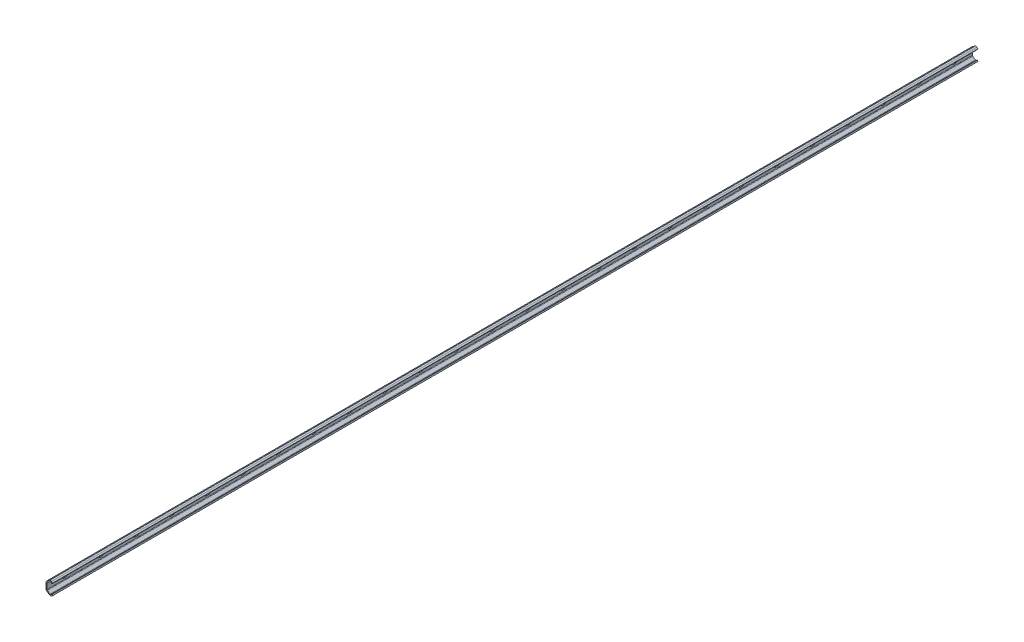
ISO-10303-21;
HEADER;
FILE_DESCRIPTION(('STEP AP214'),'2;1');
FILE_NAME('part.step','',(''),(''),'','','');
FILE_SCHEMA(('AUTOMOTIVE_DESIGN { 1 0 10303 214 1 1 1 1 }'));
ENDSEC;
DATA;
#1=APPLICATION_CONTEXT('core data for automotive mechanical design processes');
#2=APPLICATION_PROTOCOL_DEFINITION('international standard','automotive_design',2000,#1);
#3=PRODUCT_CONTEXT('',#1,'mechanical');
#4=PRODUCT('Part','Part','',(#3));
#5=PRODUCT_RELATED_PRODUCT_CATEGORY('part','',(#4));
#6=PRODUCT_DEFINITION_FORMATION('','',#4);
#7=PRODUCT_DEFINITION_CONTEXT('part definition',#1,'design');
#8=PRODUCT_DEFINITION('design','',#6,#7);
#9=PRODUCT_DEFINITION_SHAPE('','',#8);
#10=(LENGTH_UNIT() NAMED_UNIT(*) SI_UNIT(.MILLI.,.METRE.));
#11=(NAMED_UNIT(*) PLANE_ANGLE_UNIT() SI_UNIT($,.RADIAN.));
#12=(NAMED_UNIT(*) SI_UNIT($,.STERADIAN.) SOLID_ANGLE_UNIT());
#13=UNCERTAINTY_MEASURE_WITH_UNIT(LENGTH_MEASURE(1.E-05),#10,'distance_accuracy_value','');
#14=(GEOMETRIC_REPRESENTATION_CONTEXT(3) GLOBAL_UNCERTAINTY_ASSIGNED_CONTEXT((#13)) GLOBAL_UNIT_ASSIGNED_CONTEXT((#10,
#11,#12)) REPRESENTATION_CONTEXT('',''));
#15=CARTESIAN_POINT('',(0.,0.,0.));
#16=DIRECTION('',(0.,0.,1.));
#17=DIRECTION('',(1.,0.,0.));
#18=AXIS2_PLACEMENT_3D('',#15,#16,#17);
#19=CARTESIAN_POINT('',(10.8610164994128,-12.0551732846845,-2080.));
#20=DIRECTION('',(-0.573576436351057,0.819152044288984,0.));
#21=DIRECTION('',(-0.819152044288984,-0.573576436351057,0.));
#22=AXIS2_PLACEMENT_3D('',#19,#20,#21);
#23=PLANE('',#22);
#24=DIRECTION('',(-0.819152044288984,-0.573576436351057,0.));
#25=VECTOR('',#24,1.);
#26=CARTESIAN_POINT('',(10.8610164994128,-12.0551732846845,0.));
#27=LINE('',#26,#25);
#28=CARTESIAN_POINT('',(13.5660589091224,-10.1610821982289,0.));
#29=VERTEX_POINT('',#28);
#30=CARTESIAN_POINT('',(10.8610164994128,-12.0551732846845,0.));
#31=VERTEX_POINT('',#30);
#32=EDGE_CURVE('E892',#29,#31,#27,.T.);
#33=ORIENTED_EDGE('',*,*,#32,.F.);
#34=DIRECTION('',(0.,0.,1.));
#35=VECTOR('',#34,1.);
#36=CARTESIAN_POINT('',(13.5660589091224,-10.1610821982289,-2080.));
#37=LINE('',#36,#35);
#38=CARTESIAN_POINT('',(13.5660589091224,-10.1610821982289,-2080.));
#39=VERTEX_POINT('',#38);
#40=EDGE_CURVE('E1061',#39,#29,#37,.T.);
#41=ORIENTED_EDGE('',*,*,#40,.F.);
#42=DIRECTION('',(-0.819152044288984,-0.573576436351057,0.));
#43=VECTOR('',#42,1.);
#44=CARTESIAN_POINT('',(10.8610164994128,-12.0551732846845,-2080.));
#45=LINE('',#44,#43);
#46=CARTESIAN_POINT('',(10.8610164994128,-12.0551732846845,-2080.));
#47=VERTEX_POINT('',#46);
#48=EDGE_CURVE('E902',#39,#47,#45,.T.);
#49=ORIENTED_EDGE('',*,*,#48,.T.);
#50=DIRECTION('',(0.,0.,1.));
#51=VECTOR('',#50,1.);
#52=CARTESIAN_POINT('',(10.8610164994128,-12.0551732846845,-2080.));
#53=LINE('',#52,#51);
#54=EDGE_CURVE('E982',#47,#31,#53,.T.);
#55=ORIENTED_EDGE('',*,*,#54,.T.);
#56=EDGE_LOOP('',(#33,#41,#49,#55));
#57=FACE_BOUND('',#56,.T.);
#58=ADVANCED_FACE('F39',(#57),#23,.T.);
#59=CARTESIAN_POINT('',(13.5660589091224,-10.1610821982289,-2080.));
#60=DIRECTION('',(0.819152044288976,0.573576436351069,0.));
#61=DIRECTION('',(-0.573576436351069,0.819152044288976,0.));
#62=AXIS2_PLACEMENT_3D('',#59,#60,#61);
#63=PLANE('',#62);
#64=DIRECTION('',(-0.573576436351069,0.819152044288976,0.));
#65=VECTOR('',#64,1.);
#66=CARTESIAN_POINT('',(13.5660589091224,-10.1610821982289,0.));
#67=LINE('',#66,#65);
#68=CARTESIAN_POINT('',(14.9999999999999,-12.2089623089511,0.));
#69=VERTEX_POINT('',#68);
#70=EDGE_CURVE('E907',#69,#29,#67,.T.);
#71=ORIENTED_EDGE('',*,*,#70,.F.);
#72=DIRECTION('',(0.,0.,1.));
#73=VECTOR('',#72,1.);
#74=CARTESIAN_POINT('',(14.9999999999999,-12.2089623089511,-2080.));
#75=LINE('',#74,#73);
#76=CARTESIAN_POINT('',(14.9999999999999,-12.2089623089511,-2080.));
#77=VERTEX_POINT('',#76);
#78=EDGE_CURVE('E1065',#77,#69,#75,.T.);
#79=ORIENTED_EDGE('',*,*,#78,.F.);
#80=DIRECTION('',(-0.573576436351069,0.819152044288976,0.));
#81=VECTOR('',#80,1.);
#82=CARTESIAN_POINT('',(13.5660589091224,-10.1610821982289,-2080.));
#83=LINE('',#82,#81);
#84=EDGE_CURVE('E978',#77,#39,#83,.T.);
#85=ORIENTED_EDGE('',*,*,#84,.T.);
#86=ORIENTED_EDGE('',*,*,#40,.T.);
#87=EDGE_LOOP('',(#71,#79,#85,#86));
#88=FACE_BOUND('',#87,.T.);
#89=ADVANCED_FACE('F2184',(#88),#63,.T.);
#90=CARTESIAN_POINT('',(14.9999999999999,-12.2089623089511,-2080.));
#91=DIRECTION('',(0.573576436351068,-0.819152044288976,0.));
#92=DIRECTION('',(0.819152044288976,0.573576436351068,0.));
#93=AXIS2_PLACEMENT_3D('',#90,#91,#92);
#94=PLANE('',#93);
#95=DIRECTION('',(0.819152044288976,0.573576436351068,0.));
#96=VECTOR('',#95,1.);
#97=CARTESIAN_POINT('',(14.9999999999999,-12.2089623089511,0.));
#98=LINE('',#97,#96);
#99=CARTESIAN_POINT('',(12.158978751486,-14.1982668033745,0.));
#100=VERTEX_POINT('',#99);
#101=EDGE_CURVE('E1054',#100,#69,#98,.T.);
#102=ORIENTED_EDGE('',*,*,#101,.F.);
#103=DIRECTION('',(0.,0.,1.));
#104=VECTOR('',#103,1.);
#105=CARTESIAN_POINT('',(12.158978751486,-14.1982668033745,-2080.));
#106=LINE('',#105,#104);
#107=CARTESIAN_POINT('',(12.158978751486,-14.1982668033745,-2080.));
#108=VERTEX_POINT('',#107);
#109=EDGE_CURVE('E1068',#108,#100,#106,.T.);
#110=ORIENTED_EDGE('',*,*,#109,.F.);
#111=DIRECTION('',(0.819152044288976,0.573576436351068,0.));
#112=VECTOR('',#111,1.);
#113=CARTESIAN_POINT('',(14.9999999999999,-12.2089623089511,-2080.));
#114=LINE('',#113,#112);
#115=EDGE_CURVE('E974',#108,#77,#114,.T.);
#116=ORIENTED_EDGE('',*,*,#115,.T.);
#117=ORIENTED_EDGE('',*,*,#78,.T.);
#118=EDGE_LOOP('',(#102,#110,#116,#117));
#119=FACE_BOUND('',#118,.T.);
#120=ADVANCED_FACE('F2190',(#119),#94,.T.);
#121=CARTESIAN_POINT('',(9.99999999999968,-11.1149256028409,-2080.));
#122=DIRECTION('',(0.,0.,1.));
#123=DIRECTION('',(1.,0.,0.));
#124=AXIS2_PLACEMENT_3D('',#121,#122,#123);
#125=CYLINDRICAL_SURFACE('',#124,3.76406458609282);
#126=CARTESIAN_POINT('',(9.99999999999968,-11.1149256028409,0.));
#127=DIRECTION('',(0.,0.,1.));
#128=DIRECTION('',(-1.,0.,0.));
#129=AXIS2_PLACEMENT_3D('',#126,#127,#128);
#130=CIRCLE('',#129,3.76406458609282);
#131=CARTESIAN_POINT('',(7.84102124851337,-14.1982668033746,0.));
#132=VERTEX_POINT('',#131);
#133=EDGE_CURVE('E1050',#132,#100,#130,.T.);
#134=ORIENTED_EDGE('',*,*,#133,.F.);
#135=DIRECTION('',(0.,0.,1.));
#136=VECTOR('',#135,1.);
#137=CARTESIAN_POINT('',(7.84102124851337,-14.1982668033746,-2080.));
#138=LINE('',#137,#136);
#139=CARTESIAN_POINT('',(7.84102124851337,-14.1982668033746,-2080.));
#140=VERTEX_POINT('',#139);
#141=EDGE_CURVE('E1071',#140,#132,#138,.T.);
#142=ORIENTED_EDGE('',*,*,#141,.F.);
#143=CARTESIAN_POINT('',(9.99999999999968,-11.1149256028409,-2080.));
#144=DIRECTION('',(0.,0.,1.));
#145=DIRECTION('',(-1.,0.,0.));
#146=AXIS2_PLACEMENT_3D('',#143,#144,#145);
#147=CIRCLE('',#146,3.76406458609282);
#148=EDGE_CURVE('E970',#140,#108,#147,.T.);
#149=ORIENTED_EDGE('',*,*,#148,.T.);
#150=ORIENTED_EDGE('',*,*,#109,.T.);
#151=EDGE_LOOP('',(#134,#142,#149,#150));
#152=FACE_BOUND('',#151,.T.);
#153=ADVANCED_FACE('F2617',(#152),#125,.T.);
#154=CARTESIAN_POINT('',(7.84102124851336,-14.1982668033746,-2080.));
#155=DIRECTION('',(-0.573576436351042,-0.819152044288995,0.));
#156=DIRECTION('',(0.819152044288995,-0.573576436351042,0.));
#157=AXIS2_PLACEMENT_3D('',#154,#155,#156);
#158=PLANE('',#157);
#159=DIRECTION('',(0.819152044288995,-0.573576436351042,0.));
#160=VECTOR('',#159,1.);
#161=CARTESIAN_POINT('',(7.84102124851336,-14.1982668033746,0.));
#162=LINE('',#161,#160);
#163=CARTESIAN_POINT('',(2.07234263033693,-10.1589945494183,0.));
#164=VERTEX_POINT('',#163);
#165=EDGE_CURVE('E1046',#164,#132,#162,.T.);
#166=ORIENTED_EDGE('',*,*,#165,.F.);
#167=DIRECTION('',(0.,0.,1.));
#168=VECTOR('',#167,1.);
#169=CARTESIAN_POINT('',(2.07234263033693,-10.1589945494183,-2080.));
#170=LINE('',#169,#168);
#171=CARTESIAN_POINT('',(2.07234263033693,-10.1589945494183,-2080.));
#172=VERTEX_POINT('',#171);
#173=EDGE_CURVE('E1074',#172,#164,#170,.T.);
#174=ORIENTED_EDGE('',*,*,#173,.F.);
#175=DIRECTION('',(0.819152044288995,-0.573576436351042,0.));
#176=VECTOR('',#175,1.);
#177=CARTESIAN_POINT('',(7.84102124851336,-14.1982668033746,-2080.));
#178=LINE('',#177,#176);
#179=EDGE_CURVE('E966',#172,#140,#178,.T.);
#180=ORIENTED_EDGE('',*,*,#179,.T.);
#181=ORIENTED_EDGE('',*,*,#141,.T.);
#182=EDGE_LOOP('',(#166,#174,#180,#181));
#183=FACE_BOUND('',#182,.T.);
#184=ADVANCED_FACE('F2621',(#183),#158,.T.);
#185=CARTESIAN_POINT('',(4.86533888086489,-6.17018252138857,-2080.));
#186=DIRECTION('',(0.,0.,1.));
#187=DIRECTION('',(1.,0.,0.));
#188=AXIS2_PLACEMENT_3D('',#185,#186,#187);
#189=CYLINDRICAL_SURFACE('',#188,4.86944036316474);
#190=CARTESIAN_POINT('',(4.86533888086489,-6.17018252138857,0.));
#191=DIRECTION('',(0.,0.,1.));
#192=DIRECTION('',(-1.,0.,0.));
#193=AXIS2_PLACEMENT_3D('',#190,#191,#192);
#194=CIRCLE('',#193,4.86944036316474);
#195=CARTESIAN_POINT('',(-3.85108611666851E-13,-6.36999999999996,0.));
#196=VERTEX_POINT('',#195);
#197=EDGE_CURVE('E1042',#196,#164,#194,.T.);
#198=ORIENTED_EDGE('',*,*,#197,.F.);
#199=DIRECTION('',(0.,0.,1.));
#200=VECTOR('',#199,1.);
#201=CARTESIAN_POINT('',(-3.85108611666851E-13,-6.36999999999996,-2080.));
#202=LINE('',#201,#200);
#203=CARTESIAN_POINT('',(-3.85108611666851E-13,-6.36999999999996,-2080.));
#204=VERTEX_POINT('',#203);
#205=EDGE_CURVE('E1077',#204,#196,#202,.T.);
#206=ORIENTED_EDGE('',*,*,#205,.F.);
#207=CARTESIAN_POINT('',(4.86533888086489,-6.17018252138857,-2080.));
#208=DIRECTION('',(0.,0.,1.));
#209=DIRECTION('',(-1.,0.,0.));
#210=AXIS2_PLACEMENT_3D('',#207,#208,#209);
#211=CIRCLE('',#210,4.86944036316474);
#212=EDGE_CURVE('E962',#204,#172,#211,.T.);
#213=ORIENTED_EDGE('',*,*,#212,.T.);
#214=ORIENTED_EDGE('',*,*,#173,.T.);
#215=EDGE_LOOP('',(#198,#206,#213,#214));
#216=FACE_BOUND('',#215,.T.);
#217=ADVANCED_FACE('F2626',(#216),#189,.T.);
#218=CARTESIAN_POINT('',(-3.75848512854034E-13,-6.36999999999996,-2080.));
#219=DIRECTION('',(-1.,0.,0.));
#220=DIRECTION('',(0.,-1.,0.));
#221=AXIS2_PLACEMENT_3D('',#218,#219,#220);
#222=PLANE('',#221);
#223=CARTESIAN_POINT('',(-3.87277016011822E-13,0.,-117.5));
#224=DIRECTION('',(1.,0.,0.));
#225=DIRECTION('',(0.,1.,0.));
#226=AXIS2_PLACEMENT_3D('',#223,#224,#225);
#227=CIRCLE('',#226,3.);
#228=CARTESIAN_POINT('',(-3.87710696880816E-13,3.,-117.5));
#229=VERTEX_POINT('',#228);
#230=CARTESIAN_POINT('',(-3.86843335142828E-13,-3.,-117.5));
#231=VERTEX_POINT('',#230);
#232=EDGE_CURVE('E853',#229,#231,#227,.T.);
#233=ORIENTED_EDGE('',*,*,#232,.T.);
#234=DIRECTION('',(0.,0.,-1.));
#235=VECTOR('',#234,1.);
#236=CARTESIAN_POINT('',(-3.86843335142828E-13,-3.,-117.5));
#237=LINE('',#236,#235);
#238=CARTESIAN_POINT('',(-3.76233085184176E-13,-3.,-122.5));
#239=VERTEX_POINT('',#238);
#240=EDGE_CURVE('E814',#231,#239,#237,.T.);
#241=ORIENTED_EDGE('',*,*,#240,.T.);
#242=CARTESIAN_POINT('',(-3.87277016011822E-13,0.,-122.5));
#243=DIRECTION('',(1.,0.,0.));
#244=DIRECTION('',(0.,-1.,0.));
#245=AXIS2_PLACEMENT_3D('',#242,#243,#244);
#246=CIRCLE('',#245,3.);
#247=CARTESIAN_POINT('',(-3.87710696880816E-13,3.,-122.5));
#248=VERTEX_POINT('',#247);
#249=EDGE_CURVE('E821',#239,#248,#246,.T.);
#250=ORIENTED_EDGE('',*,*,#249,.T.);
#251=DIRECTION('',(0.,0.,1.));
#252=VECTOR('',#251,1.);
#253=CARTESIAN_POINT('',(-3.87710696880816E-13,3.,-117.5));
#254=LINE('',#253,#252);
#255=EDGE_CURVE('E846',#248,#229,#254,.T.);
#256=ORIENTED_EDGE('',*,*,#255,.T.);
#257=EDGE_LOOP('',(#233,#241,#250,#256));
#258=FACE_BOUND('',#257,.T.);
#259=CARTESIAN_POINT('',(-3.87277016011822E-13,0.,-37.5));
#260=DIRECTION('',(1.,0.,0.));
#261=DIRECTION('',(0.,1.,0.));
#262=AXIS2_PLACEMENT_3D('',#259,#260,#261);
#263=CIRCLE('',#262,3.);
#264=CARTESIAN_POINT('',(-3.87710696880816E-13,3.,-37.5));
#265=VERTEX_POINT('',#264);
#266=CARTESIAN_POINT('',(-3.86843335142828E-13,-3.,-37.5));
#267=VERTEX_POINT('',#266);
#268=EDGE_CURVE('E858',#265,#267,#263,.T.);
#269=ORIENTED_EDGE('',*,*,#268,.T.);
#270=DIRECTION('',(0.,0.,-1.));
#271=VECTOR('',#270,1.);
#272=CARTESIAN_POINT('',(-3.86843335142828E-13,-3.,-37.5));
#273=LINE('',#272,#271);
#274=CARTESIAN_POINT('',(-3.76233085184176E-13,-3.,-42.5));
#275=VERTEX_POINT('',#274);
#276=EDGE_CURVE('E862',#267,#275,#273,.T.);
#277=ORIENTED_EDGE('',*,*,#276,.T.);
#278=CARTESIAN_POINT('',(-3.87277016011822E-13,0.,-42.5));
#279=DIRECTION('',(1.,0.,0.));
#280=DIRECTION('',(0.,-1.,0.));
#281=AXIS2_PLACEMENT_3D('',#278,#279,#280);
#282=CIRCLE('',#281,3.);
#283=CARTESIAN_POINT('',(-3.87710696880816E-13,3.,-42.5));
#284=VERTEX_POINT('',#283);
#285=EDGE_CURVE('E867',#275,#284,#282,.T.);
#286=ORIENTED_EDGE('',*,*,#285,.T.);
#287=DIRECTION('',(0.,0.,1.));
#288=VECTOR('',#287,1.);
#289=CARTESIAN_POINT('',(-3.87710696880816E-13,3.,-37.5));
#290=LINE('',#289,#288);
#291=EDGE_CURVE('E871',#284,#265,#290,.T.);
#292=ORIENTED_EDGE('',*,*,#291,.T.);
#293=EDGE_LOOP('',(#269,#277,#286,#292));
#294=FACE_BOUND('',#293,.T.);
#295=DIRECTION('',(0.,-1.,0.));
#296=VECTOR('',#295,1.);
#297=CARTESIAN_POINT('',(-3.75848512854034E-13,-6.36999999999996,0.));
#298=LINE('',#297,#296);
#299=CARTESIAN_POINT('',(-3.77302356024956E-13,6.36999999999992,0.));
#300=VERTEX_POINT('',#299);
#301=EDGE_CURVE('E1038',#300,#196,#298,.T.);
#302=ORIENTED_EDGE('',*,*,#301,.F.);
#303=DIRECTION('',(0.,0.,1.));
#304=VECTOR('',#303,1.);
#305=CARTESIAN_POINT('',(-3.77302356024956E-13,6.36999999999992,-2080.));
#306=LINE('',#305,#304);
#307=CARTESIAN_POINT('',(-3.77302356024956E-13,6.36999999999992,-2080.));
#308=VERTEX_POINT('',#307);
#309=EDGE_CURVE('E1080',#308,#300,#306,.T.);
#310=ORIENTED_EDGE('',*,*,#309,.F.);
#311=DIRECTION('',(0.,-1.,0.));
#312=VECTOR('',#311,1.);
#313=CARTESIAN_POINT('',(-3.75848512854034E-13,-6.36999999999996,-2080.));
#314=LINE('',#313,#312);
#315=EDGE_CURVE('E958',#308,#204,#314,.T.);
#316=ORIENTED_EDGE('',*,*,#315,.T.);
#317=ORIENTED_EDGE('',*,*,#205,.T.);
#318=EDGE_LOOP('',(#302,#310,#316,#317));
#319=FACE_BOUND('',#318,.T.);
#320=CARTESIAN_POINT('',(-3.87277016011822E-13,0.,-197.5));
#321=DIRECTION('',(1.,0.,0.));
#322=DIRECTION('',(0.,1.,0.));
#323=AXIS2_PLACEMENT_3D('',#320,#321,#322);
#324=CIRCLE('',#323,3.);
#325=CARTESIAN_POINT('',(-3.87710696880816E-13,3.,-197.5));
#326=VERTEX_POINT('',#325);
#327=CARTESIAN_POINT('',(-3.86843335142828E-13,-3.,-197.5));
#328=VERTEX_POINT('',#327);
#329=EDGE_CURVE('E1135',#326,#328,#324,.T.);
#330=ORIENTED_EDGE('',*,*,#329,.T.);
#331=DIRECTION('',(0.,0.,-1.));
#332=VECTOR('',#331,1.);
#333=CARTESIAN_POINT('',(-3.86843335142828E-13,-3.,-197.5));
#334=LINE('',#333,#332);
#335=CARTESIAN_POINT('',(-3.76233085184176E-13,-3.,-202.5));
#336=VERTEX_POINT('',#335);
#337=EDGE_CURVE('E1138',#328,#336,#334,.T.);
#338=ORIENTED_EDGE('',*,*,#337,.T.);
#339=CARTESIAN_POINT('',(-3.87277016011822E-13,0.,-202.5));
#340=DIRECTION('',(1.,0.,0.));
#341=DIRECTION('',(0.,-1.,0.));
#342=AXIS2_PLACEMENT_3D('',#339,#340,#341);
#343=CIRCLE('',#342,3.);
#344=CARTESIAN_POINT('',(-3.87710696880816E-13,3.,-202.5));
#345=VERTEX_POINT('',#344);
#346=EDGE_CURVE('E1141',#336,#345,#343,.T.);
#347=ORIENTED_EDGE('',*,*,#346,.T.);
#348=DIRECTION('',(0.,0.,1.));
#349=VECTOR('',#348,1.);
#350=CARTESIAN_POINT('',(-3.87710696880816E-13,3.,-197.5));
#351=LINE('',#350,#349);
#352=EDGE_CURVE('E1144',#345,#326,#351,.T.);
#353=ORIENTED_EDGE('',*,*,#352,.T.);
#354=EDGE_LOOP('',(#330,#338,#347,#353));
#355=FACE_BOUND('',#354,.T.);
#356=CARTESIAN_POINT('',(-3.87277016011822E-13,0.,-277.5));
#357=DIRECTION('',(1.,0.,0.));
#358=DIRECTION('',(0.,1.,0.));
#359=AXIS2_PLACEMENT_3D('',#356,#357,#358);
#360=CIRCLE('',#359,3.);
#361=CARTESIAN_POINT('',(-3.87710696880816E-13,3.,-277.5));
#362=VERTEX_POINT('',#361);
#363=CARTESIAN_POINT('',(-3.86843335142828E-13,-3.,-277.5));
#364=VERTEX_POINT('',#363);
#365=EDGE_CURVE('E1179',#362,#364,#360,.T.);
#366=ORIENTED_EDGE('',*,*,#365,.T.);
#367=DIRECTION('',(0.,0.,-1.));
#368=VECTOR('',#367,1.);
#369=CARTESIAN_POINT('',(-3.86843335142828E-13,-3.,-277.5));
#370=LINE('',#369,#368);
#371=CARTESIAN_POINT('',(-3.76233085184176E-13,-3.,-282.5));
#372=VERTEX_POINT('',#371);
#373=EDGE_CURVE('E1182',#364,#372,#370,.T.);
#374=ORIENTED_EDGE('',*,*,#373,.T.);
#375=CARTESIAN_POINT('',(-3.87277016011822E-13,0.,-282.5));
#376=DIRECTION('',(1.,0.,0.));
#377=DIRECTION('',(0.,-1.,0.));
#378=AXIS2_PLACEMENT_3D('',#375,#376,#377);
#379=CIRCLE('',#378,3.);
#380=CARTESIAN_POINT('',(-3.87710696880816E-13,3.,-282.5));
#381=VERTEX_POINT('',#380);
#382=EDGE_CURVE('E1185',#372,#381,#379,.T.);
#383=ORIENTED_EDGE('',*,*,#382,.T.);
#384=DIRECTION('',(0.,0.,1.));
#385=VECTOR('',#384,1.);
#386=CARTESIAN_POINT('',(-3.87710696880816E-13,3.,-277.5));
#387=LINE('',#386,#385);
#388=EDGE_CURVE('E1188',#381,#362,#387,.T.);
#389=ORIENTED_EDGE('',*,*,#388,.T.);
#390=EDGE_LOOP('',(#366,#374,#383,#389));
#391=FACE_BOUND('',#390,.T.);
#392=CARTESIAN_POINT('',(-3.87277016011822E-13,0.,-357.5));
#393=DIRECTION('',(1.,0.,0.));
#394=DIRECTION('',(0.,1.,0.));
#395=AXIS2_PLACEMENT_3D('',#392,#393,#394);
#396=CIRCLE('',#395,3.);
#397=CARTESIAN_POINT('',(-3.87710696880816E-13,3.,-357.5));
#398=VERTEX_POINT('',#397);
#399=CARTESIAN_POINT('',(-3.86843335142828E-13,-3.,-357.5));
#400=VERTEX_POINT('',#399);
#401=EDGE_CURVE('E1223',#398,#400,#396,.T.);
#402=ORIENTED_EDGE('',*,*,#401,.T.);
#403=DIRECTION('',(0.,0.,-1.));
#404=VECTOR('',#403,1.);
#405=CARTESIAN_POINT('',(-3.86843335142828E-13,-3.,-357.5));
#406=LINE('',#405,#404);
#407=CARTESIAN_POINT('',(-3.76233085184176E-13,-3.,-362.5));
#408=VERTEX_POINT('',#407);
#409=EDGE_CURVE('E1226',#400,#408,#406,.T.);
#410=ORIENTED_EDGE('',*,*,#409,.T.);
#411=CARTESIAN_POINT('',(-3.87277016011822E-13,0.,-362.5));
#412=DIRECTION('',(1.,0.,0.));
#413=DIRECTION('',(0.,-1.,0.));
#414=AXIS2_PLACEMENT_3D('',#411,#412,#413);
#415=CIRCLE('',#414,3.);
#416=CARTESIAN_POINT('',(-3.87710696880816E-13,3.,-362.5));
#417=VERTEX_POINT('',#416);
#418=EDGE_CURVE('E1229',#408,#417,#415,.T.);
#419=ORIENTED_EDGE('',*,*,#418,.T.);
#420=DIRECTION('',(0.,0.,1.));
#421=VECTOR('',#420,1.);
#422=CARTESIAN_POINT('',(-3.87710696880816E-13,3.,-357.5));
#423=LINE('',#422,#421);
#424=EDGE_CURVE('E1232',#417,#398,#423,.T.);
#425=ORIENTED_EDGE('',*,*,#424,.T.);
#426=EDGE_LOOP('',(#402,#410,#419,#425));
#427=FACE_BOUND('',#426,.T.);
#428=CARTESIAN_POINT('',(-3.87277016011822E-13,0.,-437.5));
#429=DIRECTION('',(1.,0.,0.));
#430=DIRECTION('',(0.,1.,0.));
#431=AXIS2_PLACEMENT_3D('',#428,#429,#430);
#432=CIRCLE('',#431,3.);
#433=CARTESIAN_POINT('',(-3.87710696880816E-13,3.,-437.5));
#434=VERTEX_POINT('',#433);
#435=CARTESIAN_POINT('',(-3.86843335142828E-13,-3.,-437.5));
#436=VERTEX_POINT('',#435);
#437=EDGE_CURVE('E1267',#434,#436,#432,.T.);
#438=ORIENTED_EDGE('',*,*,#437,.T.);
#439=DIRECTION('',(0.,0.,-1.));
#440=VECTOR('',#439,1.);
#441=CARTESIAN_POINT('',(-3.86843335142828E-13,-3.,-437.5));
#442=LINE('',#441,#440);
#443=CARTESIAN_POINT('',(-3.76233085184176E-13,-3.,-442.5));
#444=VERTEX_POINT('',#443);
#445=EDGE_CURVE('E1270',#436,#444,#442,.T.);
#446=ORIENTED_EDGE('',*,*,#445,.T.);
#447=CARTESIAN_POINT('',(-3.87277016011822E-13,0.,-442.5));
#448=DIRECTION('',(1.,0.,0.));
#449=DIRECTION('',(0.,-1.,0.));
#450=AXIS2_PLACEMENT_3D('',#447,#448,#449);
#451=CIRCLE('',#450,3.);
#452=CARTESIAN_POINT('',(-3.87710696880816E-13,3.,-442.5));
#453=VERTEX_POINT('',#452);
#454=EDGE_CURVE('E1273',#444,#453,#451,.T.);
#455=ORIENTED_EDGE('',*,*,#454,.T.);
#456=DIRECTION('',(0.,0.,1.));
#457=VECTOR('',#456,1.);
#458=CARTESIAN_POINT('',(-3.87710696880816E-13,3.,-437.5));
#459=LINE('',#458,#457);
#460=EDGE_CURVE('E1276',#453,#434,#459,.T.);
#461=ORIENTED_EDGE('',*,*,#460,.T.);
#462=EDGE_LOOP('',(#438,#446,#455,#461));
#463=FACE_BOUND('',#462,.T.);
#464=CARTESIAN_POINT('',(-3.87277016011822E-13,0.,-517.5));
#465=DIRECTION('',(1.,0.,0.));
#466=DIRECTION('',(0.,1.,0.));
#467=AXIS2_PLACEMENT_3D('',#464,#465,#466);
#468=CIRCLE('',#467,3.);
#469=CARTESIAN_POINT('',(-3.87710696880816E-13,3.,-517.5));
#470=VERTEX_POINT('',#469);
#471=CARTESIAN_POINT('',(-3.86843335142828E-13,-3.,-517.5));
#472=VERTEX_POINT('',#471);
#473=EDGE_CURVE('E1310',#470,#472,#468,.T.);
#474=ORIENTED_EDGE('',*,*,#473,.T.);
#475=DIRECTION('',(0.,0.,-1.));
#476=VECTOR('',#475,1.);
#477=CARTESIAN_POINT('',(-3.86843335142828E-13,-3.,-517.5));
#478=LINE('',#477,#476);
#479=CARTESIAN_POINT('',(-3.76233085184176E-13,-3.,-522.5));
#480=VERTEX_POINT('',#479);
#481=EDGE_CURVE('E1313',#472,#480,#478,.T.);
#482=ORIENTED_EDGE('',*,*,#481,.T.);
#483=CARTESIAN_POINT('',(-3.87277016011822E-13,0.,-522.5));
#484=DIRECTION('',(1.,0.,0.));
#485=DIRECTION('',(0.,-1.,0.));
#486=AXIS2_PLACEMENT_3D('',#483,#484,#485);
#487=CIRCLE('',#486,3.);
#488=CARTESIAN_POINT('',(-3.87710696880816E-13,3.,-522.5));
#489=VERTEX_POINT('',#488);
#490=EDGE_CURVE('E1316',#480,#489,#487,.T.);
#491=ORIENTED_EDGE('',*,*,#490,.T.);
#492=DIRECTION('',(0.,0.,1.));
#493=VECTOR('',#492,1.);
#494=CARTESIAN_POINT('',(-3.87710696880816E-13,3.,-517.5));
#495=LINE('',#494,#493);
#496=EDGE_CURVE('E1319',#489,#470,#495,.T.);
#497=ORIENTED_EDGE('',*,*,#496,.T.);
#498=EDGE_LOOP('',(#474,#482,#491,#497));
#499=FACE_BOUND('',#498,.T.);
#500=CARTESIAN_POINT('',(-3.87277016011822E-13,0.,-597.5));
#501=DIRECTION('',(1.,0.,0.));
#502=DIRECTION('',(0.,1.,0.));
#503=AXIS2_PLACEMENT_3D('',#500,#501,#502);
#504=CIRCLE('',#503,3.);
#505=CARTESIAN_POINT('',(-3.87710696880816E-13,3.,-597.5));
#506=VERTEX_POINT('',#505);
#507=CARTESIAN_POINT('',(-3.86843335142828E-13,-3.,-597.5));
#508=VERTEX_POINT('',#507);
#509=EDGE_CURVE('E1354',#506,#508,#504,.T.);
#510=ORIENTED_EDGE('',*,*,#509,.T.);
#511=DIRECTION('',(0.,0.,-1.));
#512=VECTOR('',#511,1.);
#513=CARTESIAN_POINT('',(-3.86843335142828E-13,-3.,-597.5));
#514=LINE('',#513,#512);
#515=CARTESIAN_POINT('',(-3.76233085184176E-13,-3.,-602.5));
#516=VERTEX_POINT('',#515);
#517=EDGE_CURVE('E1357',#508,#516,#514,.T.);
#518=ORIENTED_EDGE('',*,*,#517,.T.);
#519=CARTESIAN_POINT('',(-3.87277016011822E-13,0.,-602.5));
#520=DIRECTION('',(1.,0.,0.));
#521=DIRECTION('',(0.,-1.,0.));
#522=AXIS2_PLACEMENT_3D('',#519,#520,#521);
#523=CIRCLE('',#522,3.);
#524=CARTESIAN_POINT('',(-3.87710696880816E-13,3.,-602.5));
#525=VERTEX_POINT('',#524);
#526=EDGE_CURVE('E1360',#516,#525,#523,.T.);
#527=ORIENTED_EDGE('',*,*,#526,.T.);
#528=DIRECTION('',(0.,0.,1.));
#529=VECTOR('',#528,1.);
#530=CARTESIAN_POINT('',(-3.87710696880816E-13,3.,-597.5));
#531=LINE('',#530,#529);
#532=EDGE_CURVE('E1363',#525,#506,#531,.T.);
#533=ORIENTED_EDGE('',*,*,#532,.T.);
#534=EDGE_LOOP('',(#510,#518,#527,#533));
#535=FACE_BOUND('',#534,.T.);
#536=CARTESIAN_POINT('',(-3.87277016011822E-13,0.,-677.5));
#537=DIRECTION('',(1.,0.,0.));
#538=DIRECTION('',(0.,1.,0.));
#539=AXIS2_PLACEMENT_3D('',#536,#537,#538);
#540=CIRCLE('',#539,3.);
#541=CARTESIAN_POINT('',(-3.87710696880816E-13,3.,-677.5));
#542=VERTEX_POINT('',#541);
#543=CARTESIAN_POINT('',(-3.86843335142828E-13,-3.,-677.5));
#544=VERTEX_POINT('',#543);
#545=EDGE_CURVE('E1398',#542,#544,#540,.T.);
#546=ORIENTED_EDGE('',*,*,#545,.T.);
#547=DIRECTION('',(0.,0.,-1.));
#548=VECTOR('',#547,1.);
#549=CARTESIAN_POINT('',(-3.86843335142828E-13,-3.,-677.5));
#550=LINE('',#549,#548);
#551=CARTESIAN_POINT('',(-3.76233085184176E-13,-3.,-682.5));
#552=VERTEX_POINT('',#551);
#553=EDGE_CURVE('E1401',#544,#552,#550,.T.);
#554=ORIENTED_EDGE('',*,*,#553,.T.);
#555=CARTESIAN_POINT('',(-3.87277016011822E-13,0.,-682.5));
#556=DIRECTION('',(1.,0.,0.));
#557=DIRECTION('',(0.,-1.,0.));
#558=AXIS2_PLACEMENT_3D('',#555,#556,#557);
#559=CIRCLE('',#558,3.);
#560=CARTESIAN_POINT('',(-3.87710696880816E-13,3.,-682.5));
#561=VERTEX_POINT('',#560);
#562=EDGE_CURVE('E1404',#552,#561,#559,.T.);
#563=ORIENTED_EDGE('',*,*,#562,.T.);
#564=DIRECTION('',(0.,0.,1.));
#565=VECTOR('',#564,1.);
#566=CARTESIAN_POINT('',(-3.87710696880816E-13,3.,-677.5));
#567=LINE('',#566,#565);
#568=EDGE_CURVE('E1407',#561,#542,#567,.T.);
#569=ORIENTED_EDGE('',*,*,#568,.T.);
#570=EDGE_LOOP('',(#546,#554,#563,#569));
#571=FACE_BOUND('',#570,.T.);
#572=CARTESIAN_POINT('',(-3.87277016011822E-13,0.,-757.5));
#573=DIRECTION('',(1.,0.,0.));
#574=DIRECTION('',(0.,1.,0.));
#575=AXIS2_PLACEMENT_3D('',#572,#573,#574);
#576=CIRCLE('',#575,3.);
#577=CARTESIAN_POINT('',(-3.87710696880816E-13,3.,-757.5));
#578=VERTEX_POINT('',#577);
#579=CARTESIAN_POINT('',(-3.86843335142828E-13,-3.,-757.5));
#580=VERTEX_POINT('',#579);
#581=EDGE_CURVE('E1442',#578,#580,#576,.T.);
#582=ORIENTED_EDGE('',*,*,#581,.T.);
#583=DIRECTION('',(0.,0.,-1.));
#584=VECTOR('',#583,1.);
#585=CARTESIAN_POINT('',(-3.86843335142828E-13,-3.,-757.5));
#586=LINE('',#585,#584);
#587=CARTESIAN_POINT('',(-3.76233085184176E-13,-3.,-762.5));
#588=VERTEX_POINT('',#587);
#589=EDGE_CURVE('E1445',#580,#588,#586,.T.);
#590=ORIENTED_EDGE('',*,*,#589,.T.);
#591=CARTESIAN_POINT('',(-3.87277016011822E-13,0.,-762.5));
#592=DIRECTION('',(1.,0.,0.));
#593=DIRECTION('',(0.,-1.,0.));
#594=AXIS2_PLACEMENT_3D('',#591,#592,#593);
#595=CIRCLE('',#594,3.);
#596=CARTESIAN_POINT('',(-3.87710696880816E-13,3.,-762.5));
#597=VERTEX_POINT('',#596);
#598=EDGE_CURVE('E1448',#588,#597,#595,.T.);
#599=ORIENTED_EDGE('',*,*,#598,.T.);
#600=DIRECTION('',(0.,0.,1.));
#601=VECTOR('',#600,1.);
#602=CARTESIAN_POINT('',(-3.87710696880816E-13,3.,-757.5));
#603=LINE('',#602,#601);
#604=EDGE_CURVE('E1451',#597,#578,#603,.T.);
#605=ORIENTED_EDGE('',*,*,#604,.T.);
#606=EDGE_LOOP('',(#582,#590,#599,#605));
#607=FACE_BOUND('',#606,.T.);
#608=CARTESIAN_POINT('',(-3.87277016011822E-13,0.,-837.5));
#609=DIRECTION('',(1.,0.,0.));
#610=DIRECTION('',(0.,1.,0.));
#611=AXIS2_PLACEMENT_3D('',#608,#609,#610);
#612=CIRCLE('',#611,3.);
#613=CARTESIAN_POINT('',(-3.87710696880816E-13,3.,-837.5));
#614=VERTEX_POINT('',#613);
#615=CARTESIAN_POINT('',(-3.86843335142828E-13,-3.,-837.5));
#616=VERTEX_POINT('',#615);
#617=EDGE_CURVE('E1486',#614,#616,#612,.T.);
#618=ORIENTED_EDGE('',*,*,#617,.T.);
#619=DIRECTION('',(0.,0.,-1.));
#620=VECTOR('',#619,1.);
#621=CARTESIAN_POINT('',(-3.86843335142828E-13,-3.,-837.5));
#622=LINE('',#621,#620);
#623=CARTESIAN_POINT('',(-3.76233085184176E-13,-3.,-842.5));
#624=VERTEX_POINT('',#623);
#625=EDGE_CURVE('E1489',#616,#624,#622,.T.);
#626=ORIENTED_EDGE('',*,*,#625,.T.);
#627=CARTESIAN_POINT('',(-3.87277016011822E-13,0.,-842.5));
#628=DIRECTION('',(1.,0.,0.));
#629=DIRECTION('',(0.,-1.,0.));
#630=AXIS2_PLACEMENT_3D('',#627,#628,#629);
#631=CIRCLE('',#630,3.);
#632=CARTESIAN_POINT('',(-3.87710696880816E-13,3.,-842.5));
#633=VERTEX_POINT('',#632);
#634=EDGE_CURVE('E1492',#624,#633,#631,.T.);
#635=ORIENTED_EDGE('',*,*,#634,.T.);
#636=DIRECTION('',(0.,0.,1.));
#637=VECTOR('',#636,1.);
#638=CARTESIAN_POINT('',(-3.87710696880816E-13,3.,-837.5));
#639=LINE('',#638,#637);
#640=EDGE_CURVE('E1495',#633,#614,#639,.T.);
#641=ORIENTED_EDGE('',*,*,#640,.T.);
#642=EDGE_LOOP('',(#618,#626,#635,#641));
#643=FACE_BOUND('',#642,.T.);
#644=CARTESIAN_POINT('',(-3.87277016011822E-13,0.,-917.5));
#645=DIRECTION('',(1.,0.,0.));
#646=DIRECTION('',(0.,1.,0.));
#647=AXIS2_PLACEMENT_3D('',#644,#645,#646);
#648=CIRCLE('',#647,3.);
#649=CARTESIAN_POINT('',(-3.87710696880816E-13,3.,-917.5));
#650=VERTEX_POINT('',#649);
#651=CARTESIAN_POINT('',(-3.86843335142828E-13,-3.,-917.5));
#652=VERTEX_POINT('',#651);
#653=EDGE_CURVE('E1530',#650,#652,#648,.T.);
#654=ORIENTED_EDGE('',*,*,#653,.T.);
#655=DIRECTION('',(0.,0.,-1.));
#656=VECTOR('',#655,1.);
#657=CARTESIAN_POINT('',(-3.86843335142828E-13,-3.,-917.5));
#658=LINE('',#657,#656);
#659=CARTESIAN_POINT('',(-3.76233085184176E-13,-3.,-922.5));
#660=VERTEX_POINT('',#659);
#661=EDGE_CURVE('E1533',#652,#660,#658,.T.);
#662=ORIENTED_EDGE('',*,*,#661,.T.);
#663=CARTESIAN_POINT('',(-3.87277016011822E-13,0.,-922.5));
#664=DIRECTION('',(1.,0.,0.));
#665=DIRECTION('',(0.,-1.,0.));
#666=AXIS2_PLACEMENT_3D('',#663,#664,#665);
#667=CIRCLE('',#666,3.);
#668=CARTESIAN_POINT('',(-3.87710696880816E-13,3.,-922.5));
#669=VERTEX_POINT('',#668);
#670=EDGE_CURVE('E1536',#660,#669,#667,.T.);
#671=ORIENTED_EDGE('',*,*,#670,.T.);
#672=DIRECTION('',(0.,0.,1.));
#673=VECTOR('',#672,1.);
#674=CARTESIAN_POINT('',(-3.87710696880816E-13,3.,-917.5));
#675=LINE('',#674,#673);
#676=EDGE_CURVE('E1539',#669,#650,#675,.T.);
#677=ORIENTED_EDGE('',*,*,#676,.T.);
#678=EDGE_LOOP('',(#654,#662,#671,#677));
#679=FACE_BOUND('',#678,.T.);
#680=CARTESIAN_POINT('',(-3.87277016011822E-13,0.,-997.5));
#681=DIRECTION('',(1.,0.,0.));
#682=DIRECTION('',(0.,1.,0.));
#683=AXIS2_PLACEMENT_3D('',#680,#681,#682);
#684=CIRCLE('',#683,3.);
#685=CARTESIAN_POINT('',(-3.87710696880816E-13,3.,-997.5));
#686=VERTEX_POINT('',#685);
#687=CARTESIAN_POINT('',(-3.86843335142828E-13,-3.,-997.5));
#688=VERTEX_POINT('',#687);
#689=EDGE_CURVE('E1574',#686,#688,#684,.T.);
#690=ORIENTED_EDGE('',*,*,#689,.T.);
#691=DIRECTION('',(0.,0.,-1.));
#692=VECTOR('',#691,1.);
#693=CARTESIAN_POINT('',(-3.86843335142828E-13,-3.,-997.5));
#694=LINE('',#693,#692);
#695=CARTESIAN_POINT('',(-3.76233085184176E-13,-3.,-1002.5));
#696=VERTEX_POINT('',#695);
#697=EDGE_CURVE('E1577',#688,#696,#694,.T.);
#698=ORIENTED_EDGE('',*,*,#697,.T.);
#699=CARTESIAN_POINT('',(-3.87277016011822E-13,0.,-1002.5));
#700=DIRECTION('',(1.,0.,0.));
#701=DIRECTION('',(0.,-1.,0.));
#702=AXIS2_PLACEMENT_3D('',#699,#700,#701);
#703=CIRCLE('',#702,3.);
#704=CARTESIAN_POINT('',(-3.87710696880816E-13,3.,-1002.5));
#705=VERTEX_POINT('',#704);
#706=EDGE_CURVE('E1580',#696,#705,#703,.T.);
#707=ORIENTED_EDGE('',*,*,#706,.T.);
#708=DIRECTION('',(0.,0.,1.));
#709=VECTOR('',#708,1.);
#710=CARTESIAN_POINT('',(-3.87710696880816E-13,3.,-997.5));
#711=LINE('',#710,#709);
#712=EDGE_CURVE('E1583',#705,#686,#711,.T.);
#713=ORIENTED_EDGE('',*,*,#712,.T.);
#714=EDGE_LOOP('',(#690,#698,#707,#713));
#715=FACE_BOUND('',#714,.T.);
#716=CARTESIAN_POINT('',(-3.87277016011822E-13,0.,-1077.5));
#717=DIRECTION('',(1.,0.,0.));
#718=DIRECTION('',(0.,1.,0.));
#719=AXIS2_PLACEMENT_3D('',#716,#717,#718);
#720=CIRCLE('',#719,3.);
#721=CARTESIAN_POINT('',(-3.87710696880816E-13,3.,-1077.5));
#722=VERTEX_POINT('',#721);
#723=CARTESIAN_POINT('',(-3.86843335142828E-13,-3.,-1077.5));
#724=VERTEX_POINT('',#723);
#725=EDGE_CURVE('E1618',#722,#724,#720,.T.);
#726=ORIENTED_EDGE('',*,*,#725,.T.);
#727=DIRECTION('',(0.,0.,-1.));
#728=VECTOR('',#727,1.);
#729=CARTESIAN_POINT('',(-3.86843335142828E-13,-3.,-1077.5));
#730=LINE('',#729,#728);
#731=CARTESIAN_POINT('',(-3.76233085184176E-13,-3.,-1082.5));
#732=VERTEX_POINT('',#731);
#733=EDGE_CURVE('E1621',#724,#732,#730,.T.);
#734=ORIENTED_EDGE('',*,*,#733,.T.);
#735=CARTESIAN_POINT('',(-3.87277016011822E-13,0.,-1082.5));
#736=DIRECTION('',(1.,0.,0.));
#737=DIRECTION('',(0.,-1.,0.));
#738=AXIS2_PLACEMENT_3D('',#735,#736,#737);
#739=CIRCLE('',#738,3.);
#740=CARTESIAN_POINT('',(-3.87710696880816E-13,3.,-1082.5));
#741=VERTEX_POINT('',#740);
#742=EDGE_CURVE('E1624',#732,#741,#739,.T.);
#743=ORIENTED_EDGE('',*,*,#742,.T.);
#744=DIRECTION('',(0.,0.,1.));
#745=VECTOR('',#744,1.);
#746=CARTESIAN_POINT('',(-3.87710696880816E-13,3.,-1077.5));
#747=LINE('',#746,#745);
#748=EDGE_CURVE('E1627',#741,#722,#747,.T.);
#749=ORIENTED_EDGE('',*,*,#748,.T.);
#750=EDGE_LOOP('',(#726,#734,#743,#749));
#751=FACE_BOUND('',#750,.T.);
#752=CARTESIAN_POINT('',(-3.87277016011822E-13,0.,-1157.5));
#753=DIRECTION('',(1.,0.,0.));
#754=DIRECTION('',(0.,1.,0.));
#755=AXIS2_PLACEMENT_3D('',#752,#753,#754);
#756=CIRCLE('',#755,3.);
#757=CARTESIAN_POINT('',(-3.87710696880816E-13,3.,-1157.5));
#758=VERTEX_POINT('',#757);
#759=CARTESIAN_POINT('',(-3.86843335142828E-13,-3.,-1157.5));
#760=VERTEX_POINT('',#759);
#761=EDGE_CURVE('E1662',#758,#760,#756,.T.);
#762=ORIENTED_EDGE('',*,*,#761,.T.);
#763=DIRECTION('',(0.,0.,-1.));
#764=VECTOR('',#763,1.);
#765=CARTESIAN_POINT('',(-3.86843335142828E-13,-3.,-1157.5));
#766=LINE('',#765,#764);
#767=CARTESIAN_POINT('',(-3.76233085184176E-13,-3.,-1162.5));
#768=VERTEX_POINT('',#767);
#769=EDGE_CURVE('E1665',#760,#768,#766,.T.);
#770=ORIENTED_EDGE('',*,*,#769,.T.);
#771=CARTESIAN_POINT('',(-3.87277016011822E-13,0.,-1162.5));
#772=DIRECTION('',(1.,0.,0.));
#773=DIRECTION('',(0.,-1.,0.));
#774=AXIS2_PLACEMENT_3D('',#771,#772,#773);
#775=CIRCLE('',#774,3.);
#776=CARTESIAN_POINT('',(-3.87710696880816E-13,3.,-1162.5));
#777=VERTEX_POINT('',#776);
#778=EDGE_CURVE('E1668',#768,#777,#775,.T.);
#779=ORIENTED_EDGE('',*,*,#778,.T.);
#780=DIRECTION('',(0.,0.,1.));
#781=VECTOR('',#780,1.);
#782=CARTESIAN_POINT('',(-3.87710696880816E-13,3.,-1157.5));
#783=LINE('',#782,#781);
#784=EDGE_CURVE('E1671',#777,#758,#783,.T.);
#785=ORIENTED_EDGE('',*,*,#784,.T.);
#786=EDGE_LOOP('',(#762,#770,#779,#785));
#787=FACE_BOUND('',#786,.T.);
#788=CARTESIAN_POINT('',(-3.87277016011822E-13,0.,-1237.5));
#789=DIRECTION('',(1.,0.,0.));
#790=DIRECTION('',(0.,1.,0.));
#791=AXIS2_PLACEMENT_3D('',#788,#789,#790);
#792=CIRCLE('',#791,3.);
#793=CARTESIAN_POINT('',(-3.87710696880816E-13,3.,-1237.5));
#794=VERTEX_POINT('',#793);
#795=CARTESIAN_POINT('',(-3.86843335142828E-13,-3.,-1237.5));
#796=VERTEX_POINT('',#795);
#797=EDGE_CURVE('E1706',#794,#796,#792,.T.);
#798=ORIENTED_EDGE('',*,*,#797,.T.);
#799=DIRECTION('',(0.,0.,-1.));
#800=VECTOR('',#799,1.);
#801=CARTESIAN_POINT('',(-3.86843335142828E-13,-3.,-1237.5));
#802=LINE('',#801,#800);
#803=CARTESIAN_POINT('',(-3.76233085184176E-13,-3.,-1242.5));
#804=VERTEX_POINT('',#803);
#805=EDGE_CURVE('E1709',#796,#804,#802,.T.);
#806=ORIENTED_EDGE('',*,*,#805,.T.);
#807=CARTESIAN_POINT('',(-3.87277016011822E-13,0.,-1242.5));
#808=DIRECTION('',(1.,0.,0.));
#809=DIRECTION('',(0.,-1.,0.));
#810=AXIS2_PLACEMENT_3D('',#807,#808,#809);
#811=CIRCLE('',#810,3.);
#812=CARTESIAN_POINT('',(-3.87710696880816E-13,3.,-1242.5));
#813=VERTEX_POINT('',#812);
#814=EDGE_CURVE('E1712',#804,#813,#811,.T.);
#815=ORIENTED_EDGE('',*,*,#814,.T.);
#816=DIRECTION('',(0.,0.,1.));
#817=VECTOR('',#816,1.);
#818=CARTESIAN_POINT('',(-3.87710696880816E-13,3.,-1237.5));
#819=LINE('',#818,#817);
#820=EDGE_CURVE('E1715',#813,#794,#819,.T.);
#821=ORIENTED_EDGE('',*,*,#820,.T.);
#822=EDGE_LOOP('',(#798,#806,#815,#821));
#823=FACE_BOUND('',#822,.T.);
#824=CARTESIAN_POINT('',(-3.87277016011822E-13,0.,-1317.5));
#825=DIRECTION('',(1.,0.,0.));
#826=DIRECTION('',(0.,1.,0.));
#827=AXIS2_PLACEMENT_3D('',#824,#825,#826);
#828=CIRCLE('',#827,3.);
#829=CARTESIAN_POINT('',(-3.87710696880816E-13,3.,-1317.5));
#830=VERTEX_POINT('',#829);
#831=CARTESIAN_POINT('',(-3.86843335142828E-13,-3.,-1317.5));
#832=VERTEX_POINT('',#831);
#833=EDGE_CURVE('E1750',#830,#832,#828,.T.);
#834=ORIENTED_EDGE('',*,*,#833,.T.);
#835=DIRECTION('',(0.,0.,-1.));
#836=VECTOR('',#835,1.);
#837=CARTESIAN_POINT('',(-3.86843335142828E-13,-3.,-1317.5));
#838=LINE('',#837,#836);
#839=CARTESIAN_POINT('',(-3.76233085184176E-13,-3.,-1322.5));
#840=VERTEX_POINT('',#839);
#841=EDGE_CURVE('E1753',#832,#840,#838,.T.);
#842=ORIENTED_EDGE('',*,*,#841,.T.);
#843=CARTESIAN_POINT('',(-3.87277016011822E-13,0.,-1322.5));
#844=DIRECTION('',(1.,0.,0.));
#845=DIRECTION('',(0.,-1.,0.));
#846=AXIS2_PLACEMENT_3D('',#843,#844,#845);
#847=CIRCLE('',#846,3.);
#848=CARTESIAN_POINT('',(-3.87710696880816E-13,3.,-1322.5));
#849=VERTEX_POINT('',#848);
#850=EDGE_CURVE('E1756',#840,#849,#847,.T.);
#851=ORIENTED_EDGE('',*,*,#850,.T.);
#852=DIRECTION('',(0.,0.,1.));
#853=VECTOR('',#852,1.);
#854=CARTESIAN_POINT('',(-3.87710696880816E-13,3.,-1317.5));
#855=LINE('',#854,#853);
#856=EDGE_CURVE('E1759',#849,#830,#855,.T.);
#857=ORIENTED_EDGE('',*,*,#856,.T.);
#858=EDGE_LOOP('',(#834,#842,#851,#857));
#859=FACE_BOUND('',#858,.T.);
#860=CARTESIAN_POINT('',(-3.87277016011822E-13,0.,-1397.5));
#861=DIRECTION('',(1.,0.,0.));
#862=DIRECTION('',(0.,1.,0.));
#863=AXIS2_PLACEMENT_3D('',#860,#861,#862);
#864=CIRCLE('',#863,3.);
#865=CARTESIAN_POINT('',(-3.87710696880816E-13,3.,-1397.5));
#866=VERTEX_POINT('',#865);
#867=CARTESIAN_POINT('',(-3.86843335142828E-13,-3.,-1397.5));
#868=VERTEX_POINT('',#867);
#869=EDGE_CURVE('E1794',#866,#868,#864,.T.);
#870=ORIENTED_EDGE('',*,*,#869,.T.);
#871=DIRECTION('',(0.,0.,-1.));
#872=VECTOR('',#871,1.);
#873=CARTESIAN_POINT('',(-3.86843335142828E-13,-3.,-1397.5));
#874=LINE('',#873,#872);
#875=CARTESIAN_POINT('',(-3.76233085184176E-13,-3.,-1402.5));
#876=VERTEX_POINT('',#875);
#877=EDGE_CURVE('E1797',#868,#876,#874,.T.);
#878=ORIENTED_EDGE('',*,*,#877,.T.);
#879=CARTESIAN_POINT('',(-3.87277016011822E-13,0.,-1402.5));
#880=DIRECTION('',(1.,0.,0.));
#881=DIRECTION('',(0.,-1.,0.));
#882=AXIS2_PLACEMENT_3D('',#879,#880,#881);
#883=CIRCLE('',#882,3.);
#884=CARTESIAN_POINT('',(-3.87710696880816E-13,3.,-1402.5));
#885=VERTEX_POINT('',#884);
#886=EDGE_CURVE('E1800',#876,#885,#883,.T.);
#887=ORIENTED_EDGE('',*,*,#886,.T.);
#888=DIRECTION('',(0.,0.,1.));
#889=VECTOR('',#888,1.);
#890=CARTESIAN_POINT('',(-3.87710696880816E-13,3.,-1397.5));
#891=LINE('',#890,#889);
#892=EDGE_CURVE('E1803',#885,#866,#891,.T.);
#893=ORIENTED_EDGE('',*,*,#892,.T.);
#894=EDGE_LOOP('',(#870,#878,#887,#893));
#895=FACE_BOUND('',#894,.T.);
#896=CARTESIAN_POINT('',(-3.87277016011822E-13,0.,-1477.5));
#897=DIRECTION('',(1.,0.,0.));
#898=DIRECTION('',(0.,1.,0.));
#899=AXIS2_PLACEMENT_3D('',#896,#897,#898);
#900=CIRCLE('',#899,3.);
#901=CARTESIAN_POINT('',(-3.87710696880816E-13,3.,-1477.5));
#902=VERTEX_POINT('',#901);
#903=CARTESIAN_POINT('',(-3.86843335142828E-13,-3.,-1477.5));
#904=VERTEX_POINT('',#903);
#905=EDGE_CURVE('E1838',#902,#904,#900,.T.);
#906=ORIENTED_EDGE('',*,*,#905,.T.);
#907=DIRECTION('',(0.,0.,-1.));
#908=VECTOR('',#907,1.);
#909=CARTESIAN_POINT('',(-3.86843335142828E-13,-3.,-1477.5));
#910=LINE('',#909,#908);
#911=CARTESIAN_POINT('',(-3.76233085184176E-13,-3.,-1482.5));
#912=VERTEX_POINT('',#911);
#913=EDGE_CURVE('E1841',#904,#912,#910,.T.);
#914=ORIENTED_EDGE('',*,*,#913,.T.);
#915=CARTESIAN_POINT('',(-3.87277016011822E-13,0.,-1482.5));
#916=DIRECTION('',(1.,0.,0.));
#917=DIRECTION('',(0.,-1.,0.));
#918=AXIS2_PLACEMENT_3D('',#915,#916,#917);
#919=CIRCLE('',#918,3.);
#920=CARTESIAN_POINT('',(-3.87710696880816E-13,3.,-1482.5));
#921=VERTEX_POINT('',#920);
#922=EDGE_CURVE('E1844',#912,#921,#919,.T.);
#923=ORIENTED_EDGE('',*,*,#922,.T.);
#924=DIRECTION('',(0.,0.,1.));
#925=VECTOR('',#924,1.);
#926=CARTESIAN_POINT('',(-3.87710696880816E-13,3.,-1477.5));
#927=LINE('',#926,#925);
#928=EDGE_CURVE('E1847',#921,#902,#927,.T.);
#929=ORIENTED_EDGE('',*,*,#928,.T.);
#930=EDGE_LOOP('',(#906,#914,#923,#929));
#931=FACE_BOUND('',#930,.T.);
#932=CARTESIAN_POINT('',(-3.87277016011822E-13,0.,-1557.5));
#933=DIRECTION('',(1.,0.,0.));
#934=DIRECTION('',(0.,1.,0.));
#935=AXIS2_PLACEMENT_3D('',#932,#933,#934);
#936=CIRCLE('',#935,3.);
#937=CARTESIAN_POINT('',(-3.87710696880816E-13,3.,-1557.5));
#938=VERTEX_POINT('',#937);
#939=CARTESIAN_POINT('',(-3.86843335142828E-13,-3.,-1557.5));
#940=VERTEX_POINT('',#939);
#941=EDGE_CURVE('E1882',#938,#940,#936,.T.);
#942=ORIENTED_EDGE('',*,*,#941,.T.);
#943=DIRECTION('',(0.,0.,-1.));
#944=VECTOR('',#943,1.);
#945=CARTESIAN_POINT('',(-3.86843335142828E-13,-3.,-1557.5));
#946=LINE('',#945,#944);
#947=CARTESIAN_POINT('',(-3.76233085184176E-13,-3.,-1562.5));
#948=VERTEX_POINT('',#947);
#949=EDGE_CURVE('E1885',#940,#948,#946,.T.);
#950=ORIENTED_EDGE('',*,*,#949,.T.);
#951=CARTESIAN_POINT('',(-3.87277016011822E-13,0.,-1562.5));
#952=DIRECTION('',(1.,0.,0.));
#953=DIRECTION('',(0.,-1.,0.));
#954=AXIS2_PLACEMENT_3D('',#951,#952,#953);
#955=CIRCLE('',#954,3.);
#956=CARTESIAN_POINT('',(-3.87710696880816E-13,3.,-1562.5));
#957=VERTEX_POINT('',#956);
#958=EDGE_CURVE('E1888',#948,#957,#955,.T.);
#959=ORIENTED_EDGE('',*,*,#958,.T.);
#960=DIRECTION('',(0.,0.,1.));
#961=VECTOR('',#960,1.);
#962=CARTESIAN_POINT('',(-3.87710696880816E-13,3.,-1557.5));
#963=LINE('',#962,#961);
#964=EDGE_CURVE('E1891',#957,#938,#963,.T.);
#965=ORIENTED_EDGE('',*,*,#964,.T.);
#966=EDGE_LOOP('',(#942,#950,#959,#965));
#967=FACE_BOUND('',#966,.T.);
#968=CARTESIAN_POINT('',(-3.87277016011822E-13,0.,-1637.5));
#969=DIRECTION('',(1.,0.,0.));
#970=DIRECTION('',(0.,1.,0.));
#971=AXIS2_PLACEMENT_3D('',#968,#969,#970);
#972=CIRCLE('',#971,3.);
#973=CARTESIAN_POINT('',(-3.87710696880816E-13,3.,-1637.5));
#974=VERTEX_POINT('',#973);
#975=CARTESIAN_POINT('',(-3.86843335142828E-13,-3.,-1637.5));
#976=VERTEX_POINT('',#975);
#977=EDGE_CURVE('E1926',#974,#976,#972,.T.);
#978=ORIENTED_EDGE('',*,*,#977,.T.);
#979=DIRECTION('',(0.,0.,-1.));
#980=VECTOR('',#979,1.);
#981=CARTESIAN_POINT('',(-3.86843335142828E-13,-3.,-1637.5));
#982=LINE('',#981,#980);
#983=CARTESIAN_POINT('',(-3.76233085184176E-13,-3.,-1642.5));
#984=VERTEX_POINT('',#983);
#985=EDGE_CURVE('E1929',#976,#984,#982,.T.);
#986=ORIENTED_EDGE('',*,*,#985,.T.);
#987=CARTESIAN_POINT('',(-3.87277016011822E-13,0.,-1642.5));
#988=DIRECTION('',(1.,0.,0.));
#989=DIRECTION('',(0.,-1.,0.));
#990=AXIS2_PLACEMENT_3D('',#987,#988,#989);
#991=CIRCLE('',#990,3.);
#992=CARTESIAN_POINT('',(-3.87710696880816E-13,3.,-1642.5));
#993=VERTEX_POINT('',#992);
#994=EDGE_CURVE('E1932',#984,#993,#991,.T.);
#995=ORIENTED_EDGE('',*,*,#994,.T.);
#996=DIRECTION('',(0.,0.,1.));
#997=VECTOR('',#996,1.);
#998=CARTESIAN_POINT('',(-3.87710696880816E-13,3.,-1637.5));
#999=LINE('',#998,#997);
#1000=EDGE_CURVE('E1935',#993,#974,#999,.T.);
#1001=ORIENTED_EDGE('',*,*,#1000,.T.);
#1002=EDGE_LOOP('',(#978,#986,#995,#1001));
#1003=FACE_BOUND('',#1002,.T.);
#1004=CARTESIAN_POINT('',(-3.87277016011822E-13,0.,-1717.5));
#1005=DIRECTION('',(1.,0.,0.));
#1006=DIRECTION('',(0.,1.,0.));
#1007=AXIS2_PLACEMENT_3D('',#1004,#1005,#1006);
#1008=CIRCLE('',#1007,3.);
#1009=CARTESIAN_POINT('',(-3.87710696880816E-13,3.,-1717.5));
#1010=VERTEX_POINT('',#1009);
#1011=CARTESIAN_POINT('',(-3.86843335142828E-13,-3.,-1717.5));
#1012=VERTEX_POINT('',#1011);
#1013=EDGE_CURVE('E1970',#1010,#1012,#1008,.T.);
#1014=ORIENTED_EDGE('',*,*,#1013,.T.);
#1015=DIRECTION('',(0.,0.,-1.));
#1016=VECTOR('',#1015,1.);
#1017=CARTESIAN_POINT('',(-3.86843335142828E-13,-3.,-1717.5));
#1018=LINE('',#1017,#1016);
#1019=CARTESIAN_POINT('',(-3.76233085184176E-13,-3.,-1722.5));
#1020=VERTEX_POINT('',#1019);
#1021=EDGE_CURVE('E1973',#1012,#1020,#1018,.T.);
#1022=ORIENTED_EDGE('',*,*,#1021,.T.);
#1023=CARTESIAN_POINT('',(-3.87277016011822E-13,0.,-1722.5));
#1024=DIRECTION('',(1.,0.,0.));
#1025=DIRECTION('',(0.,-1.,0.));
#1026=AXIS2_PLACEMENT_3D('',#1023,#1024,#1025);
#1027=CIRCLE('',#1026,3.);
#1028=CARTESIAN_POINT('',(-3.87710696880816E-13,3.,-1722.5));
#1029=VERTEX_POINT('',#1028);
#1030=EDGE_CURVE('E1976',#1020,#1029,#1027,.T.);
#1031=ORIENTED_EDGE('',*,*,#1030,.T.);
#1032=DIRECTION('',(0.,0.,1.));
#1033=VECTOR('',#1032,1.);
#1034=CARTESIAN_POINT('',(-3.87710696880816E-13,3.,-1717.5));
#1035=LINE('',#1034,#1033);
#1036=EDGE_CURVE('E1979',#1029,#1010,#1035,.T.);
#1037=ORIENTED_EDGE('',*,*,#1036,.T.);
#1038=EDGE_LOOP('',(#1014,#1022,#1031,#1037));
#1039=FACE_BOUND('',#1038,.T.);
#1040=CARTESIAN_POINT('',(-3.87277016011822E-13,0.,-1797.5));
#1041=DIRECTION('',(1.,0.,0.));
#1042=DIRECTION('',(0.,1.,0.));
#1043=AXIS2_PLACEMENT_3D('',#1040,#1041,#1042);
#1044=CIRCLE('',#1043,3.);
#1045=CARTESIAN_POINT('',(-3.87710696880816E-13,3.,-1797.5));
#1046=VERTEX_POINT('',#1045);
#1047=CARTESIAN_POINT('',(-3.86843335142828E-13,-3.,-1797.5));
#1048=VERTEX_POINT('',#1047);
#1049=EDGE_CURVE('E2014',#1046,#1048,#1044,.T.);
#1050=ORIENTED_EDGE('',*,*,#1049,.T.);
#1051=DIRECTION('',(0.,0.,-1.));
#1052=VECTOR('',#1051,1.);
#1053=CARTESIAN_POINT('',(-3.86843335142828E-13,-3.,-1797.5));
#1054=LINE('',#1053,#1052);
#1055=CARTESIAN_POINT('',(-3.76233085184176E-13,-3.,-1802.5));
#1056=VERTEX_POINT('',#1055);
#1057=EDGE_CURVE('E2017',#1048,#1056,#1054,.T.);
#1058=ORIENTED_EDGE('',*,*,#1057,.T.);
#1059=CARTESIAN_POINT('',(-3.87277016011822E-13,0.,-1802.5));
#1060=DIRECTION('',(1.,0.,0.));
#1061=DIRECTION('',(0.,-1.,0.));
#1062=AXIS2_PLACEMENT_3D('',#1059,#1060,#1061);
#1063=CIRCLE('',#1062,3.);
#1064=CARTESIAN_POINT('',(-3.87710696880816E-13,3.,-1802.5));
#1065=VERTEX_POINT('',#1064);
#1066=EDGE_CURVE('E2020',#1056,#1065,#1063,.T.);
#1067=ORIENTED_EDGE('',*,*,#1066,.T.);
#1068=DIRECTION('',(0.,0.,1.));
#1069=VECTOR('',#1068,1.);
#1070=CARTESIAN_POINT('',(-3.87710696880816E-13,3.,-1797.5));
#1071=LINE('',#1070,#1069);
#1072=EDGE_CURVE('E2023',#1065,#1046,#1071,.T.);
#1073=ORIENTED_EDGE('',*,*,#1072,.T.);
#1074=EDGE_LOOP('',(#1050,#1058,#1067,#1073));
#1075=FACE_BOUND('',#1074,.T.);
#1076=CARTESIAN_POINT('',(-3.87277016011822E-13,0.,-1877.5));
#1077=DIRECTION('',(1.,0.,0.));
#1078=DIRECTION('',(0.,1.,0.));
#1079=AXIS2_PLACEMENT_3D('',#1076,#1077,#1078);
#1080=CIRCLE('',#1079,3.);
#1081=CARTESIAN_POINT('',(-3.87710696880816E-13,3.,-1877.5));
#1082=VERTEX_POINT('',#1081);
#1083=CARTESIAN_POINT('',(-3.86843335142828E-13,-3.,-1877.5));
#1084=VERTEX_POINT('',#1083);
#1085=EDGE_CURVE('E2058',#1082,#1084,#1080,.T.);
#1086=ORIENTED_EDGE('',*,*,#1085,.T.);
#1087=DIRECTION('',(0.,0.,-1.));
#1088=VECTOR('',#1087,1.);
#1089=CARTESIAN_POINT('',(-3.86843335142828E-13,-3.,-1877.5));
#1090=LINE('',#1089,#1088);
#1091=CARTESIAN_POINT('',(-3.76233085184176E-13,-3.,-1882.5));
#1092=VERTEX_POINT('',#1091);
#1093=EDGE_CURVE('E2061',#1084,#1092,#1090,.T.);
#1094=ORIENTED_EDGE('',*,*,#1093,.T.);
#1095=CARTESIAN_POINT('',(-3.87277016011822E-13,0.,-1882.5));
#1096=DIRECTION('',(1.,0.,0.));
#1097=DIRECTION('',(0.,-1.,0.));
#1098=AXIS2_PLACEMENT_3D('',#1095,#1096,#1097);
#1099=CIRCLE('',#1098,3.);
#1100=CARTESIAN_POINT('',(-3.87710696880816E-13,3.,-1882.5));
#1101=VERTEX_POINT('',#1100);
#1102=EDGE_CURVE('E2064',#1092,#1101,#1099,.T.);
#1103=ORIENTED_EDGE('',*,*,#1102,.T.);
#1104=DIRECTION('',(0.,0.,1.));
#1105=VECTOR('',#1104,1.);
#1106=CARTESIAN_POINT('',(-3.87710696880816E-13,3.,-1877.5));
#1107=LINE('',#1106,#1105);
#1108=EDGE_CURVE('E2067',#1101,#1082,#1107,.T.);
#1109=ORIENTED_EDGE('',*,*,#1108,.T.);
#1110=EDGE_LOOP('',(#1086,#1094,#1103,#1109));
#1111=FACE_BOUND('',#1110,.T.);
#1112=CARTESIAN_POINT('',(-3.87277016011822E-13,0.,-1957.5));
#1113=DIRECTION('',(1.,0.,0.));
#1114=DIRECTION('',(0.,1.,0.));
#1115=AXIS2_PLACEMENT_3D('',#1112,#1113,#1114);
#1116=CIRCLE('',#1115,3.);
#1117=CARTESIAN_POINT('',(-3.87710696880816E-13,3.,-1957.5));
#1118=VERTEX_POINT('',#1117);
#1119=CARTESIAN_POINT('',(-3.86843335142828E-13,-3.,-1957.5));
#1120=VERTEX_POINT('',#1119);
#1121=EDGE_CURVE('E2102',#1118,#1120,#1116,.T.);
#1122=ORIENTED_EDGE('',*,*,#1121,.T.);
#1123=DIRECTION('',(0.,0.,-1.));
#1124=VECTOR('',#1123,1.);
#1125=CARTESIAN_POINT('',(-3.86843335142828E-13,-3.,-1957.5));
#1126=LINE('',#1125,#1124);
#1127=CARTESIAN_POINT('',(-3.76233085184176E-13,-3.,-1962.5));
#1128=VERTEX_POINT('',#1127);
#1129=EDGE_CURVE('E2105',#1120,#1128,#1126,.T.);
#1130=ORIENTED_EDGE('',*,*,#1129,.T.);
#1131=CARTESIAN_POINT('',(-3.87277016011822E-13,0.,-1962.5));
#1132=DIRECTION('',(1.,0.,0.));
#1133=DIRECTION('',(0.,-1.,0.));
#1134=AXIS2_PLACEMENT_3D('',#1131,#1132,#1133);
#1135=CIRCLE('',#1134,3.);
#1136=CARTESIAN_POINT('',(-3.87710696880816E-13,3.,-1962.5));
#1137=VERTEX_POINT('',#1136);
#1138=EDGE_CURVE('E2108',#1128,#1137,#1135,.T.);
#1139=ORIENTED_EDGE('',*,*,#1138,.T.);
#1140=DIRECTION('',(0.,0.,1.));
#1141=VECTOR('',#1140,1.);
#1142=CARTESIAN_POINT('',(-3.87710696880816E-13,3.,-1957.5));
#1143=LINE('',#1142,#1141);
#1144=EDGE_CURVE('E2111',#1137,#1118,#1143,.T.);
#1145=ORIENTED_EDGE('',*,*,#1144,.T.);
#1146=EDGE_LOOP('',(#1122,#1130,#1139,#1145));
#1147=FACE_BOUND('',#1146,.T.);
#1148=CARTESIAN_POINT('',(-3.87277016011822E-13,0.,-2037.5));
#1149=DIRECTION('',(1.,0.,0.));
#1150=DIRECTION('',(0.,1.,0.));
#1151=AXIS2_PLACEMENT_3D('',#1148,#1149,#1150);
#1152=CIRCLE('',#1151,3.);
#1153=CARTESIAN_POINT('',(-3.87710696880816E-13,3.,-2037.5));
#1154=VERTEX_POINT('',#1153);
#1155=CARTESIAN_POINT('',(-3.86843335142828E-13,-3.,-2037.5));
#1156=VERTEX_POINT('',#1155);
#1157=EDGE_CURVE('E55',#1154,#1156,#1152,.T.);
#1158=ORIENTED_EDGE('',*,*,#1157,.T.);
#1159=DIRECTION('',(0.,0.,-1.));
#1160=VECTOR('',#1159,1.);
#1161=CARTESIAN_POINT('',(-3.86843335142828E-13,-3.,-2037.5));
#1162=LINE('',#1161,#1160);
#1163=CARTESIAN_POINT('',(-3.76233085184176E-13,-3.,-2042.5));
#1164=VERTEX_POINT('',#1163);
#1165=EDGE_CURVE('E2148',#1156,#1164,#1162,.T.);
#1166=ORIENTED_EDGE('',*,*,#1165,.T.);
#1167=CARTESIAN_POINT('',(-3.87277016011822E-13,0.,-2042.5));
#1168=DIRECTION('',(1.,0.,0.));
#1169=DIRECTION('',(0.,-1.,0.));
#1170=AXIS2_PLACEMENT_3D('',#1167,#1168,#1169);
#1171=CIRCLE('',#1170,3.);
#1172=CARTESIAN_POINT('',(-3.87710696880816E-13,3.,-2042.5));
#1173=VERTEX_POINT('',#1172);
#1174=EDGE_CURVE('E62',#1164,#1173,#1171,.T.);
#1175=ORIENTED_EDGE('',*,*,#1174,.T.);
#1176=DIRECTION('',(0.,0.,1.));
#1177=VECTOR('',#1176,1.);
#1178=CARTESIAN_POINT('',(-3.87710696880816E-13,3.,-2037.5));
#1179=LINE('',#1178,#1177);
#1180=EDGE_CURVE('E2153',#1173,#1154,#1179,.T.);
#1181=ORIENTED_EDGE('',*,*,#1180,.T.);
#1182=EDGE_LOOP('',(#1158,#1166,#1175,#1181));
#1183=FACE_BOUND('',#1182,.T.);
#1184=ADVANCED_FACE('F2575',(#258,#294,#319,#355,#391,#427,#463,#499,#535,#571,#607,#643,#679,
#715,#751,#787,#823,#859,#895,#931,#967,#1003,#1039,#1075,#1111,#1147,#1183),#222,.T.);
#1185=CARTESIAN_POINT('',(4.49999999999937,6.36999999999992,-2080.));
#1186=DIRECTION('',(0.,0.,1.));
#1187=DIRECTION('',(1.,0.,0.));
#1188=AXIS2_PLACEMENT_3D('',#1185,#1186,#1187);
#1189=CYLINDRICAL_SURFACE('',#1188,4.49999999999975);
#1190=CARTESIAN_POINT('',(4.49999999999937,6.36999999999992,0.));
#1191=DIRECTION('',(0.,0.,1.));
#1192=DIRECTION('',(-1.,0.,0.));
#1193=AXIS2_PLACEMENT_3D('',#1190,#1191,#1192);
#1194=CIRCLE('',#1193,4.49999999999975);
#1195=CARTESIAN_POINT('',(2.07234263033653,10.1589945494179,0.));
#1196=VERTEX_POINT('',#1195);
#1197=EDGE_CURVE('E1034',#1196,#300,#1194,.T.);
#1198=ORIENTED_EDGE('',*,*,#1197,.F.);
#1199=DIRECTION('',(0.,0.,1.));
#1200=VECTOR('',#1199,1.);
#1201=CARTESIAN_POINT('',(2.07234263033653,10.1589945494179,-2080.));
#1202=LINE('',#1201,#1200);
#1203=CARTESIAN_POINT('',(2.07234263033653,10.1589945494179,-2080.));
#1204=VERTEX_POINT('',#1203);
#1205=EDGE_CURVE('E1083',#1204,#1196,#1202,.T.);
#1206=ORIENTED_EDGE('',*,*,#1205,.F.);
#1207=CARTESIAN_POINT('',(4.49999999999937,6.36999999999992,-2080.));
#1208=DIRECTION('',(0.,0.,1.));
#1209=DIRECTION('',(-1.,0.,0.));
#1210=AXIS2_PLACEMENT_3D('',#1207,#1208,#1209);
#1211=CIRCLE('',#1210,4.49999999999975);
#1212=EDGE_CURVE('E954',#1204,#308,#1211,.T.);
#1213=ORIENTED_EDGE('',*,*,#1212,.T.);
#1214=ORIENTED_EDGE('',*,*,#309,.T.);
#1215=EDGE_LOOP('',(#1198,#1206,#1213,#1214));
#1216=FACE_BOUND('',#1215,.T.);
#1217=ADVANCED_FACE('F2634',(#1216),#1189,.T.);
#1218=CARTESIAN_POINT('',(2.07234263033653,10.1589945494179,-2080.));
#1219=DIRECTION('',(-0.573576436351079,0.819152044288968,0.));
#1220=DIRECTION('',(-0.819152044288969,-0.573576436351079,0.));
#1221=AXIS2_PLACEMENT_3D('',#1218,#1219,#1220);
#1222=PLANE('',#1221);
#1223=DIRECTION('',(-0.819152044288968,-0.573576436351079,0.));
#1224=VECTOR('',#1223,1.);
#1225=CARTESIAN_POINT('',(2.07234263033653,10.1589945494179,0.));
#1226=LINE('',#1225,#1224);
#1227=CARTESIAN_POINT('',(7.84102124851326,14.1982668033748,0.));
#1228=VERTEX_POINT('',#1227);
#1229=EDGE_CURVE('E1030',#1228,#1196,#1226,.T.);
#1230=ORIENTED_EDGE('',*,*,#1229,.F.);
#1231=DIRECTION('',(0.,0.,1.));
#1232=VECTOR('',#1231,1.);
#1233=CARTESIAN_POINT('',(7.84102124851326,14.1982668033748,-2080.));
#1234=LINE('',#1233,#1232);
#1235=CARTESIAN_POINT('',(7.84102124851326,14.1982668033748,-2080.));
#1236=VERTEX_POINT('',#1235);
#1237=EDGE_CURVE('E1086',#1236,#1228,#1234,.T.);
#1238=ORIENTED_EDGE('',*,*,#1237,.F.);
#1239=DIRECTION('',(-0.819152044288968,-0.573576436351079,0.));
#1240=VECTOR('',#1239,1.);
#1241=CARTESIAN_POINT('',(2.07234263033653,10.1589945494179,-2080.));
#1242=LINE('',#1241,#1240);
#1243=EDGE_CURVE('E950',#1236,#1204,#1242,.T.);
#1244=ORIENTED_EDGE('',*,*,#1243,.T.);
#1245=ORIENTED_EDGE('',*,*,#1205,.T.);
#1246=EDGE_LOOP('',(#1230,#1238,#1244,#1245));
#1247=FACE_BOUND('',#1246,.T.);
#1248=ADVANCED_FACE('F2637',(#1247),#1222,.T.);
#1249=CARTESIAN_POINT('',(9.99999999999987,11.1149256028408,-2080.));
#1250=DIRECTION('',(0.,0.,1.));
#1251=DIRECTION('',(1.,0.,0.));
#1252=AXIS2_PLACEMENT_3D('',#1249,#1250,#1251);
#1253=CYLINDRICAL_SURFACE('',#1252,3.76406458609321);
#1254=CARTESIAN_POINT('',(9.99999999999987,11.1149256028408,0.));
#1255=DIRECTION('',(0.,0.,1.));
#1256=DIRECTION('',(-1.,0.,0.));
#1257=AXIS2_PLACEMENT_3D('',#1254,#1255,#1256);
#1258=CIRCLE('',#1257,3.76406458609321);
#1259=CARTESIAN_POINT('',(12.1589787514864,14.1982668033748,0.));
#1260=VERTEX_POINT('',#1259);
#1261=EDGE_CURVE('E1026',#1260,#1228,#1258,.T.);
#1262=ORIENTED_EDGE('',*,*,#1261,.F.);
#1263=DIRECTION('',(0.,0.,1.));
#1264=VECTOR('',#1263,1.);
#1265=CARTESIAN_POINT('',(12.1589787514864,14.1982668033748,-2080.));
#1266=LINE('',#1265,#1264);
#1267=CARTESIAN_POINT('',(12.1589787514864,14.1982668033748,-2080.));
#1268=VERTEX_POINT('',#1267);
#1269=EDGE_CURVE('E1089',#1268,#1260,#1266,.T.);
#1270=ORIENTED_EDGE('',*,*,#1269,.F.);
#1271=CARTESIAN_POINT('',(9.99999999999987,11.1149256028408,-2080.));
#1272=DIRECTION('',(0.,0.,1.));
#1273=DIRECTION('',(-1.,0.,0.));
#1274=AXIS2_PLACEMENT_3D('',#1271,#1272,#1273);
#1275=CIRCLE('',#1274,3.76406458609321);
#1276=EDGE_CURVE('E946',#1268,#1236,#1275,.T.);
#1277=ORIENTED_EDGE('',*,*,#1276,.T.);
#1278=ORIENTED_EDGE('',*,*,#1237,.T.);
#1279=EDGE_LOOP('',(#1262,#1270,#1277,#1278));
#1280=FACE_BOUND('',#1279,.T.);
#1281=ADVANCED_FACE('F2642',(#1280),#1253,.T.);
#1282=CARTESIAN_POINT('',(12.1589787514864,14.1982668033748,-2080.));
#1283=DIRECTION('',(0.573576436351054,0.819152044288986,0.));
#1284=DIRECTION('',(-0.819152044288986,0.573576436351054,0.));
#1285=AXIS2_PLACEMENT_3D('',#1282,#1283,#1284);
#1286=PLANE('',#1285);
#1287=DIRECTION('',(-0.819152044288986,0.573576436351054,0.));
#1288=VECTOR('',#1287,1.);
#1289=CARTESIAN_POINT('',(12.1589787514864,14.1982668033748,0.));
#1290=LINE('',#1289,#1288);
#1291=CARTESIAN_POINT('',(14.9999999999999,12.2089623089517,0.));
#1292=VERTEX_POINT('',#1291);
#1293=EDGE_CURVE('E1022',#1292,#1260,#1290,.T.);
#1294=ORIENTED_EDGE('',*,*,#1293,.F.);
#1295=DIRECTION('',(0.,0.,1.));
#1296=VECTOR('',#1295,1.);
#1297=CARTESIAN_POINT('',(14.9999999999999,12.2089623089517,-2080.));
#1298=LINE('',#1297,#1296);
#1299=CARTESIAN_POINT('',(14.9999999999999,12.2089623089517,-2080.));
#1300=VERTEX_POINT('',#1299);
#1301=EDGE_CURVE('E1092',#1300,#1292,#1298,.T.);
#1302=ORIENTED_EDGE('',*,*,#1301,.F.);
#1303=DIRECTION('',(-0.819152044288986,0.573576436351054,0.));
#1304=VECTOR('',#1303,1.);
#1305=CARTESIAN_POINT('',(12.1589787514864,14.1982668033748,-2080.));
#1306=LINE('',#1305,#1304);
#1307=EDGE_CURVE('E943',#1300,#1268,#1306,.T.);
#1308=ORIENTED_EDGE('',*,*,#1307,.T.);
#1309=ORIENTED_EDGE('',*,*,#1269,.T.);
#1310=EDGE_LOOP('',(#1294,#1302,#1308,#1309));
#1311=FACE_BOUND('',#1310,.T.);
#1312=ADVANCED_FACE('F2645',(#1311),#1286,.T.);
#1313=CARTESIAN_POINT('',(14.9999999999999,12.2089623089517,-2080.));
#1314=DIRECTION('',(0.819152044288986,-0.573576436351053,0.));
#1315=DIRECTION('',(0.573576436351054,0.819152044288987,0.));
#1316=AXIS2_PLACEMENT_3D('',#1313,#1314,#1315);
#1317=PLANE('',#1316);
#1318=DIRECTION('',(0.573576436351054,0.819152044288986,0.));
#1319=VECTOR('',#1318,1.);
#1320=CARTESIAN_POINT('',(14.9999999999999,12.2089623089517,0.));
#1321=LINE('',#1320,#1319);
#1322=CARTESIAN_POINT('',(13.5660589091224,10.1610821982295,0.));
#1323=VERTEX_POINT('',#1322);
#1324=EDGE_CURVE('E1018',#1323,#1292,#1321,.T.);
#1325=ORIENTED_EDGE('',*,*,#1324,.F.);
#1326=DIRECTION('',(0.,0.,1.));
#1327=VECTOR('',#1326,1.);
#1328=CARTESIAN_POINT('',(13.5660589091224,10.1610821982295,-2080.));
#1329=LINE('',#1328,#1327);
#1330=CARTESIAN_POINT('',(13.5660589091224,10.1610821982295,-2080.));
#1331=VERTEX_POINT('',#1330);
#1332=EDGE_CURVE('E1095',#1331,#1323,#1329,.T.);
#1333=ORIENTED_EDGE('',*,*,#1332,.F.);
#1334=DIRECTION('',(0.573576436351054,0.819152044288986,0.));
#1335=VECTOR('',#1334,1.);
#1336=CARTESIAN_POINT('',(14.9999999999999,12.2089623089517,-2080.));
#1337=LINE('',#1336,#1335);
#1338=EDGE_CURVE('E939',#1331,#1300,#1337,.T.);
#1339=ORIENTED_EDGE('',*,*,#1338,.T.);
#1340=ORIENTED_EDGE('',*,*,#1301,.T.);
#1341=EDGE_LOOP('',(#1325,#1333,#1339,#1340));
#1342=FACE_BOUND('',#1341,.T.);
#1343=ADVANCED_FACE('F2650',(#1342),#1317,.T.);
#1344=CARTESIAN_POINT('',(13.5660589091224,10.1610821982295,-2080.));
#1345=DIRECTION('',(-0.573576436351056,-0.819152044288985,0.));
#1346=DIRECTION('',(0.819152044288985,-0.573576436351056,0.));
#1347=AXIS2_PLACEMENT_3D('',#1344,#1345,#1346);
#1348=PLANE('',#1347);
#1349=DIRECTION('',(0.819152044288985,-0.573576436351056,0.));
#1350=VECTOR('',#1349,1.);
#1351=CARTESIAN_POINT('',(13.5660589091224,10.1610821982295,0.));
#1352=LINE('',#1351,#1350);
#1353=CARTESIAN_POINT('',(10.8610164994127,12.0551732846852,0.));
#1354=VERTEX_POINT('',#1353);
#1355=EDGE_CURVE('E1014',#1354,#1323,#1352,.T.);
#1356=ORIENTED_EDGE('',*,*,#1355,.F.);
#1357=DIRECTION('',(0.,0.,1.));
#1358=VECTOR('',#1357,1.);
#1359=CARTESIAN_POINT('',(10.8610164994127,12.0551732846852,-2080.));
#1360=LINE('',#1359,#1358);
#1361=CARTESIAN_POINT('',(10.8610164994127,12.0551732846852,-2080.));
#1362=VERTEX_POINT('',#1361);
#1363=EDGE_CURVE('E1098',#1362,#1354,#1360,.T.);
#1364=ORIENTED_EDGE('',*,*,#1363,.F.);
#1365=DIRECTION('',(0.819152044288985,-0.573576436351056,0.));
#1366=VECTOR('',#1365,1.);
#1367=CARTESIAN_POINT('',(13.5660589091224,10.1610821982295,-2080.));
#1368=LINE('',#1367,#1366);
#1369=EDGE_CURVE('E935',#1362,#1331,#1368,.T.);
#1370=ORIENTED_EDGE('',*,*,#1369,.T.);
#1371=ORIENTED_EDGE('',*,*,#1332,.T.);
#1372=EDGE_LOOP('',(#1356,#1364,#1370,#1371));
#1373=FACE_BOUND('',#1372,.T.);
#1374=ADVANCED_FACE('F2653',(#1373),#1348,.T.);
#1375=CARTESIAN_POINT('',(9.99999999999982,10.8255142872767,-2080.));
#1376=DIRECTION('',(0.,0.,1.));
#1377=DIRECTION('',(1.,0.,0.));
#1378=AXIS2_PLACEMENT_3D('',#1375,#1376,#1377);
#1379=CYLINDRICAL_SURFACE('',#1378,1.50113645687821);
#1380=CARTESIAN_POINT('',(9.99999999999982,10.8255142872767,0.));
#1381=DIRECTION('',(0.,0.,-1.));
#1382=DIRECTION('',(1.,0.,0.));
#1383=AXIS2_PLACEMENT_3D('',#1380,#1381,#1382);
#1384=CIRCLE('',#1383,1.50113645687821);
#1385=CARTESIAN_POINT('',(9.13898350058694,12.0551732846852,0.));
#1386=VERTEX_POINT('',#1385);
#1387=EDGE_CURVE('E1010',#1386,#1354,#1384,.T.);
#1388=ORIENTED_EDGE('',*,*,#1387,.F.);
#1389=DIRECTION('',(0.,0.,1.));
#1390=VECTOR('',#1389,1.);
#1391=CARTESIAN_POINT('',(9.13898350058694,12.0551732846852,-2080.));
#1392=LINE('',#1391,#1390);
#1393=CARTESIAN_POINT('',(9.13898350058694,12.0551732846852,-2080.));
#1394=VERTEX_POINT('',#1393);
#1395=EDGE_CURVE('E1101',#1394,#1386,#1392,.T.);
#1396=ORIENTED_EDGE('',*,*,#1395,.F.);
#1397=CARTESIAN_POINT('',(9.99999999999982,10.8255142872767,-2080.));
#1398=DIRECTION('',(0.,0.,-1.));
#1399=DIRECTION('',(1.,0.,0.));
#1400=AXIS2_PLACEMENT_3D('',#1397,#1398,#1399);
#1401=CIRCLE('',#1400,1.50113645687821);
#1402=EDGE_CURVE('E931',#1394,#1362,#1401,.T.);
#1403=ORIENTED_EDGE('',*,*,#1402,.T.);
#1404=ORIENTED_EDGE('',*,*,#1363,.T.);
#1405=EDGE_LOOP('',(#1388,#1396,#1403,#1404));
#1406=FACE_BOUND('',#1405,.T.);
#1407=ADVANCED_FACE('F2658',(#1406),#1379,.F.);
#1408=CARTESIAN_POINT('',(9.13898350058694,12.0551732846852,-2080.));
#1409=DIRECTION('',(0.573576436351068,-0.819152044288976,0.));
#1410=DIRECTION('',(0.819152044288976,0.573576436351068,0.));
#1411=AXIS2_PLACEMENT_3D('',#1408,#1409,#1410);
#1412=PLANE('',#1411);
#1413=DIRECTION('',(0.819152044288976,0.573576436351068,0.));
#1414=VECTOR('',#1413,1.);
#1415=CARTESIAN_POINT('',(9.13898350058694,12.0551732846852,0.));
#1416=LINE('',#1415,#1414);
#1417=CARTESIAN_POINT('',(3.25420600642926,7.9346077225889,0.));
#1418=VERTEX_POINT('',#1417);
#1419=EDGE_CURVE('E1006',#1418,#1386,#1416,.T.);
#1420=ORIENTED_EDGE('',*,*,#1419,.F.);
#1421=DIRECTION('',(0.,0.,1.));
#1422=VECTOR('',#1421,1.);
#1423=CARTESIAN_POINT('',(3.25420600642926,7.9346077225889,-2080.));
#1424=LINE('',#1423,#1422);
#1425=CARTESIAN_POINT('',(3.25420600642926,7.9346077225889,-2080.));
#1426=VERTEX_POINT('',#1425);
#1427=EDGE_CURVE('E1104',#1426,#1418,#1424,.T.);
#1428=ORIENTED_EDGE('',*,*,#1427,.F.);
#1429=DIRECTION('',(0.819152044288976,0.573576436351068,0.));
#1430=VECTOR('',#1429,1.);
#1431=CARTESIAN_POINT('',(9.13898350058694,12.0551732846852,-2080.));
#1432=LINE('',#1431,#1430);
#1433=EDGE_CURVE('E927',#1426,#1394,#1432,.T.);
#1434=ORIENTED_EDGE('',*,*,#1433,.T.);
#1435=ORIENTED_EDGE('',*,*,#1395,.T.);
#1436=EDGE_LOOP('',(#1420,#1428,#1434,#1435));
#1437=FACE_BOUND('',#1436,.T.);
#1438=ADVANCED_FACE('F2588',(#1437),#1412,.T.);
#1439=CARTESIAN_POINT('',(4.27320681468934,6.47932374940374,-2080.));
#1440=DIRECTION('',(0.,0.,1.));
#1441=DIRECTION('',(1.,0.,0.));
#1442=AXIS2_PLACEMENT_3D('',#1439,#1440,#1441);
#1443=CYLINDRICAL_SURFACE('',#1442,1.77657369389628);
#1444=CARTESIAN_POINT('',(4.27320681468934,6.47932374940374,0.));
#1445=DIRECTION('',(0.,0.,-1.));
#1446=DIRECTION('',(1.,0.,0.));
#1447=AXIS2_PLACEMENT_3D('',#1444,#1445,#1446);
#1448=CIRCLE('',#1447,1.77657369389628);
#1449=CARTESIAN_POINT('',(2.49999999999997,6.37000000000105,0.));
#1450=VERTEX_POINT('',#1449);
#1451=EDGE_CURVE('E1002',#1450,#1418,#1448,.T.);
#1452=ORIENTED_EDGE('',*,*,#1451,.F.);
#1453=DIRECTION('',(0.,0.,1.));
#1454=VECTOR('',#1453,1.);
#1455=CARTESIAN_POINT('',(2.49999999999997,6.37000000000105,-2080.));
#1456=LINE('',#1455,#1454);
#1457=CARTESIAN_POINT('',(2.49999999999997,6.37000000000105,-2080.));
#1458=VERTEX_POINT('',#1457);
#1459=EDGE_CURVE('E1107',#1458,#1450,#1456,.T.);
#1460=ORIENTED_EDGE('',*,*,#1459,.F.);
#1461=CARTESIAN_POINT('',(4.27320681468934,6.47932374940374,-2080.));
#1462=DIRECTION('',(0.,0.,-1.));
#1463=DIRECTION('',(1.,0.,0.));
#1464=AXIS2_PLACEMENT_3D('',#1461,#1462,#1463);
#1465=CIRCLE('',#1464,1.77657369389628);
#1466=EDGE_CURVE('E923',#1458,#1426,#1465,.T.);
#1467=ORIENTED_EDGE('',*,*,#1466,.T.);
#1468=ORIENTED_EDGE('',*,*,#1427,.T.);
#1469=EDGE_LOOP('',(#1452,#1460,#1467,#1468));
#1470=FACE_BOUND('',#1469,.T.);
#1471=ADVANCED_FACE('F2579',(#1470),#1443,.F.);
#1472=CARTESIAN_POINT('',(2.49999999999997,6.37000000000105,-2080.));
#1473=DIRECTION('',(1.,0.,0.));
#1474=DIRECTION('',(0.,1.,0.));
#1475=AXIS2_PLACEMENT_3D('',#1472,#1473,#1474);
#1476=PLANE('',#1475);
#1477=CARTESIAN_POINT('',(2.49999999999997,0.,-117.5));
#1478=DIRECTION('',(1.,0.,0.));
#1479=DIRECTION('',(0.,1.,0.));
#1480=AXIS2_PLACEMENT_3D('',#1477,#1478,#1479);
#1481=CIRCLE('',#1480,3.);
#1482=CARTESIAN_POINT('',(2.49999999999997,3.,-117.5));
#1483=VERTEX_POINT('',#1482);
#1484=CARTESIAN_POINT('',(2.49999999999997,-3.,-117.5));
#1485=VERTEX_POINT('',#1484);
#1486=EDGE_CURVE('E850',#1483,#1485,#1481,.T.);
#1487=ORIENTED_EDGE('',*,*,#1486,.F.);
#1488=DIRECTION('',(0.,0.,1.));
#1489=VECTOR('',#1488,1.);
#1490=CARTESIAN_POINT('',(2.49999999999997,3.,-117.5));
#1491=LINE('',#1490,#1489);
#1492=CARTESIAN_POINT('',(2.49999999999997,3.,-122.5));
#1493=VERTEX_POINT('',#1492);
#1494=EDGE_CURVE('E827',#1493,#1483,#1491,.T.);
#1495=ORIENTED_EDGE('',*,*,#1494,.F.);
#1496=CARTESIAN_POINT('',(2.49999999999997,0.,-122.5));
#1497=DIRECTION('',(1.,0.,0.));
#1498=DIRECTION('',(0.,-1.,0.));
#1499=AXIS2_PLACEMENT_3D('',#1496,#1497,#1498);
#1500=CIRCLE('',#1499,3.);
#1501=CARTESIAN_POINT('',(2.49999999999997,-3.,-122.5));
#1502=VERTEX_POINT('',#1501);
#1503=EDGE_CURVE('E818',#1502,#1493,#1500,.T.);
#1504=ORIENTED_EDGE('',*,*,#1503,.F.);
#1505=DIRECTION('',(0.,0.,-1.));
#1506=VECTOR('',#1505,1.);
#1507=CARTESIAN_POINT('',(2.49999999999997,-3.,-117.5));
#1508=LINE('',#1507,#1506);
#1509=EDGE_CURVE('E803',#1485,#1502,#1508,.T.);
#1510=ORIENTED_EDGE('',*,*,#1509,.F.);
#1511=EDGE_LOOP('',(#1487,#1495,#1504,#1510));
#1512=FACE_BOUND('',#1511,.T.);
#1513=CARTESIAN_POINT('',(2.49999999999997,0.,-37.5));
#1514=DIRECTION('',(1.,0.,0.));
#1515=DIRECTION('',(0.,1.,0.));
#1516=AXIS2_PLACEMENT_3D('',#1513,#1514,#1515);
#1517=CIRCLE('',#1516,3.);
#1518=CARTESIAN_POINT('',(2.49999999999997,3.,-37.5));
#1519=VERTEX_POINT('',#1518);
#1520=CARTESIAN_POINT('',(2.49999999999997,-3.,-37.5000000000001));
#1521=VERTEX_POINT('',#1520);
#1522=EDGE_CURVE('E857',#1519,#1521,#1517,.T.);
#1523=ORIENTED_EDGE('',*,*,#1522,.F.);
#1524=DIRECTION('',(0.,0.,1.));
#1525=VECTOR('',#1524,1.);
#1526=CARTESIAN_POINT('',(2.49999999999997,3.,-37.5));
#1527=LINE('',#1526,#1525);
#1528=CARTESIAN_POINT('',(2.49999999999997,3.,-42.5));
#1529=VERTEX_POINT('',#1528);
#1530=EDGE_CURVE('E863',#1529,#1519,#1527,.T.);
#1531=ORIENTED_EDGE('',*,*,#1530,.F.);
#1532=CARTESIAN_POINT('',(2.49999999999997,0.,-42.5));
#1533=DIRECTION('',(1.,0.,0.));
#1534=DIRECTION('',(0.,-1.,0.));
#1535=AXIS2_PLACEMENT_3D('',#1532,#1533,#1534);
#1536=CIRCLE('',#1535,3.);
#1537=CARTESIAN_POINT('',(2.49999999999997,-3.,-42.5));
#1538=VERTEX_POINT('',#1537);
#1539=EDGE_CURVE('E882',#1538,#1529,#1536,.T.);
#1540=ORIENTED_EDGE('',*,*,#1539,.F.);
#1541=DIRECTION('',(0.,0.,-1.));
#1542=VECTOR('',#1541,1.);
#1543=CARTESIAN_POINT('',(2.49999999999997,-3.,-37.5));
#1544=LINE('',#1543,#1542);
#1545=EDGE_CURVE('E878',#1521,#1538,#1544,.T.);
#1546=ORIENTED_EDGE('',*,*,#1545,.F.);
#1547=EDGE_LOOP('',(#1523,#1531,#1540,#1546));
#1548=FACE_BOUND('',#1547,.T.);
#1549=DIRECTION('',(0.,1.,0.));
#1550=VECTOR('',#1549,1.);
#1551=CARTESIAN_POINT('',(2.49999999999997,6.37000000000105,0.));
#1552=LINE('',#1551,#1550);
#1553=CARTESIAN_POINT('',(2.49999999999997,-6.36999999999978,0.));
#1554=VERTEX_POINT('',#1553);
#1555=EDGE_CURVE('E998',#1554,#1450,#1552,.T.);
#1556=ORIENTED_EDGE('',*,*,#1555,.F.);
#1557=DIRECTION('',(0.,0.,1.));
#1558=VECTOR('',#1557,1.);
#1559=CARTESIAN_POINT('',(2.49999999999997,-6.36999999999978,-2080.));
#1560=LINE('',#1559,#1558);
#1561=CARTESIAN_POINT('',(2.49999999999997,-6.36999999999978,-2080.));
#1562=VERTEX_POINT('',#1561);
#1563=EDGE_CURVE('E1110',#1562,#1554,#1560,.T.);
#1564=ORIENTED_EDGE('',*,*,#1563,.F.);
#1565=DIRECTION('',(0.,1.,0.));
#1566=VECTOR('',#1565,1.);
#1567=CARTESIAN_POINT('',(2.49999999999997,6.37000000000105,-2080.));
#1568=LINE('',#1567,#1566);
#1569=EDGE_CURVE('E919',#1562,#1458,#1568,.T.);
#1570=ORIENTED_EDGE('',*,*,#1569,.T.);
#1571=ORIENTED_EDGE('',*,*,#1459,.T.);
#1572=EDGE_LOOP('',(#1556,#1564,#1570,#1571));
#1573=FACE_BOUND('',#1572,.T.);
#1574=CARTESIAN_POINT('',(2.49999999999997,0.,-197.5));
#1575=DIRECTION('',(1.,0.,0.));
#1576=DIRECTION('',(0.,1.,0.));
#1577=AXIS2_PLACEMENT_3D('',#1574,#1575,#1576);
#1578=CIRCLE('',#1577,3.);
#1579=CARTESIAN_POINT('',(2.49999999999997,3.,-197.5));
#1580=VERTEX_POINT('',#1579);
#1581=CARTESIAN_POINT('',(2.49999999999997,-3.,-197.5));
#1582=VERTEX_POINT('',#1581);
#1583=EDGE_CURVE('E1064',#1580,#1582,#1578,.T.);
#1584=ORIENTED_EDGE('',*,*,#1583,.F.);
#1585=DIRECTION('',(0.,0.,1.));
#1586=VECTOR('',#1585,1.);
#1587=CARTESIAN_POINT('',(2.49999999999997,3.,-197.5));
#1588=LINE('',#1587,#1586);
#1589=CARTESIAN_POINT('',(2.49999999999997,3.,-202.5));
#1590=VERTEX_POINT('',#1589);
#1591=EDGE_CURVE('E1123',#1590,#1580,#1588,.T.);
#1592=ORIENTED_EDGE('',*,*,#1591,.F.);
#1593=CARTESIAN_POINT('',(2.49999999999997,0.,-202.5));
#1594=DIRECTION('',(1.,0.,0.));
#1595=DIRECTION('',(0.,-1.,0.));
#1596=AXIS2_PLACEMENT_3D('',#1593,#1594,#1595);
#1597=CIRCLE('',#1596,3.);
#1598=CARTESIAN_POINT('',(2.49999999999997,-3.,-202.5));
#1599=VERTEX_POINT('',#1598);
#1600=EDGE_CURVE('E1127',#1599,#1590,#1597,.T.);
#1601=ORIENTED_EDGE('',*,*,#1600,.F.);
#1602=DIRECTION('',(0.,0.,-1.));
#1603=VECTOR('',#1602,1.);
#1604=CARTESIAN_POINT('',(2.49999999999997,-3.,-197.5));
#1605=LINE('',#1604,#1603);
#1606=EDGE_CURVE('E1131',#1582,#1599,#1605,.T.);
#1607=ORIENTED_EDGE('',*,*,#1606,.F.);
#1608=EDGE_LOOP('',(#1584,#1592,#1601,#1607));
#1609=FACE_BOUND('',#1608,.T.);
#1610=CARTESIAN_POINT('',(2.49999999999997,0.,-277.5));
#1611=DIRECTION('',(1.,0.,0.));
#1612=DIRECTION('',(0.,1.,0.));
#1613=AXIS2_PLACEMENT_3D('',#1610,#1611,#1612);
#1614=CIRCLE('',#1613,3.);
#1615=CARTESIAN_POINT('',(2.49999999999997,3.,-277.5));
#1616=VERTEX_POINT('',#1615);
#1617=CARTESIAN_POINT('',(2.49999999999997,-3.,-277.5));
#1618=VERTEX_POINT('',#1617);
#1619=EDGE_CURVE('E1164',#1616,#1618,#1614,.T.);
#1620=ORIENTED_EDGE('',*,*,#1619,.F.);
#1621=DIRECTION('',(0.,0.,1.));
#1622=VECTOR('',#1621,1.);
#1623=CARTESIAN_POINT('',(2.49999999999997,3.,-277.5));
#1624=LINE('',#1623,#1622);
#1625=CARTESIAN_POINT('',(2.49999999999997,3.,-282.5));
#1626=VERTEX_POINT('',#1625);
#1627=EDGE_CURVE('E1167',#1626,#1616,#1624,.T.);
#1628=ORIENTED_EDGE('',*,*,#1627,.F.);
#1629=CARTESIAN_POINT('',(2.49999999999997,0.,-282.5));
#1630=DIRECTION('',(1.,0.,0.));
#1631=DIRECTION('',(0.,-1.,0.));
#1632=AXIS2_PLACEMENT_3D('',#1629,#1630,#1631);
#1633=CIRCLE('',#1632,3.);
#1634=CARTESIAN_POINT('',(2.49999999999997,-3.,-282.5));
#1635=VERTEX_POINT('',#1634);
#1636=EDGE_CURVE('E1171',#1635,#1626,#1633,.T.);
#1637=ORIENTED_EDGE('',*,*,#1636,.F.);
#1638=DIRECTION('',(0.,0.,-1.));
#1639=VECTOR('',#1638,1.);
#1640=CARTESIAN_POINT('',(2.49999999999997,-3.,-277.5));
#1641=LINE('',#1640,#1639);
#1642=EDGE_CURVE('E1175',#1618,#1635,#1641,.T.);
#1643=ORIENTED_EDGE('',*,*,#1642,.F.);
#1644=EDGE_LOOP('',(#1620,#1628,#1637,#1643));
#1645=FACE_BOUND('',#1644,.T.);
#1646=CARTESIAN_POINT('',(2.49999999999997,0.,-357.5));
#1647=DIRECTION('',(1.,0.,0.));
#1648=DIRECTION('',(0.,1.,0.));
#1649=AXIS2_PLACEMENT_3D('',#1646,#1647,#1648);
#1650=CIRCLE('',#1649,3.);
#1651=CARTESIAN_POINT('',(2.49999999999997,3.,-357.5));
#1652=VERTEX_POINT('',#1651);
#1653=CARTESIAN_POINT('',(2.49999999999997,-3.,-357.5));
#1654=VERTEX_POINT('',#1653);
#1655=EDGE_CURVE('E1208',#1652,#1654,#1650,.T.);
#1656=ORIENTED_EDGE('',*,*,#1655,.F.);
#1657=DIRECTION('',(0.,0.,1.));
#1658=VECTOR('',#1657,1.);
#1659=CARTESIAN_POINT('',(2.49999999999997,3.,-357.5));
#1660=LINE('',#1659,#1658);
#1661=CARTESIAN_POINT('',(2.49999999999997,3.,-362.5));
#1662=VERTEX_POINT('',#1661);
#1663=EDGE_CURVE('E1211',#1662,#1652,#1660,.T.);
#1664=ORIENTED_EDGE('',*,*,#1663,.F.);
#1665=CARTESIAN_POINT('',(2.49999999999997,0.,-362.5));
#1666=DIRECTION('',(1.,0.,0.));
#1667=DIRECTION('',(0.,-1.,0.));
#1668=AXIS2_PLACEMENT_3D('',#1665,#1666,#1667);
#1669=CIRCLE('',#1668,3.);
#1670=CARTESIAN_POINT('',(2.49999999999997,-3.,-362.5));
#1671=VERTEX_POINT('',#1670);
#1672=EDGE_CURVE('E1215',#1671,#1662,#1669,.T.);
#1673=ORIENTED_EDGE('',*,*,#1672,.F.);
#1674=DIRECTION('',(0.,0.,-1.));
#1675=VECTOR('',#1674,1.);
#1676=CARTESIAN_POINT('',(2.49999999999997,-3.,-357.5));
#1677=LINE('',#1676,#1675);
#1678=EDGE_CURVE('E1219',#1654,#1671,#1677,.T.);
#1679=ORIENTED_EDGE('',*,*,#1678,.F.);
#1680=EDGE_LOOP('',(#1656,#1664,#1673,#1679));
#1681=FACE_BOUND('',#1680,.T.);
#1682=CARTESIAN_POINT('',(2.49999999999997,0.,-437.5));
#1683=DIRECTION('',(1.,0.,0.));
#1684=DIRECTION('',(0.,1.,0.));
#1685=AXIS2_PLACEMENT_3D('',#1682,#1683,#1684);
#1686=CIRCLE('',#1685,3.);
#1687=CARTESIAN_POINT('',(2.49999999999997,3.,-437.5));
#1688=VERTEX_POINT('',#1687);
#1689=CARTESIAN_POINT('',(2.49999999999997,-3.,-437.5));
#1690=VERTEX_POINT('',#1689);
#1691=EDGE_CURVE('E1252',#1688,#1690,#1686,.T.);
#1692=ORIENTED_EDGE('',*,*,#1691,.F.);
#1693=DIRECTION('',(0.,0.,1.));
#1694=VECTOR('',#1693,1.);
#1695=CARTESIAN_POINT('',(2.49999999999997,3.,-437.5));
#1696=LINE('',#1695,#1694);
#1697=CARTESIAN_POINT('',(2.49999999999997,3.,-442.5));
#1698=VERTEX_POINT('',#1697);
#1699=EDGE_CURVE('E1255',#1698,#1688,#1696,.T.);
#1700=ORIENTED_EDGE('',*,*,#1699,.F.);
#1701=CARTESIAN_POINT('',(2.49999999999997,0.,-442.5));
#1702=DIRECTION('',(1.,0.,0.));
#1703=DIRECTION('',(0.,-1.,0.));
#1704=AXIS2_PLACEMENT_3D('',#1701,#1702,#1703);
#1705=CIRCLE('',#1704,3.);
#1706=CARTESIAN_POINT('',(2.49999999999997,-3.,-442.5));
#1707=VERTEX_POINT('',#1706);
#1708=EDGE_CURVE('E1259',#1707,#1698,#1705,.T.);
#1709=ORIENTED_EDGE('',*,*,#1708,.F.);
#1710=DIRECTION('',(0.,0.,-1.));
#1711=VECTOR('',#1710,1.);
#1712=CARTESIAN_POINT('',(2.49999999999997,-3.,-437.5));
#1713=LINE('',#1712,#1711);
#1714=EDGE_CURVE('E1263',#1690,#1707,#1713,.T.);
#1715=ORIENTED_EDGE('',*,*,#1714,.F.);
#1716=EDGE_LOOP('',(#1692,#1700,#1709,#1715));
#1717=FACE_BOUND('',#1716,.T.);
#1718=CARTESIAN_POINT('',(2.49999999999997,0.,-517.5));
#1719=DIRECTION('',(1.,0.,0.));
#1720=DIRECTION('',(0.,1.,0.));
#1721=AXIS2_PLACEMENT_3D('',#1718,#1719,#1720);
#1722=CIRCLE('',#1721,3.);
#1723=CARTESIAN_POINT('',(2.49999999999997,3.,-517.5));
#1724=VERTEX_POINT('',#1723);
#1725=CARTESIAN_POINT('',(2.49999999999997,-3.,-517.5));
#1726=VERTEX_POINT('',#1725);
#1727=EDGE_CURVE('E1296',#1724,#1726,#1722,.T.);
#1728=ORIENTED_EDGE('',*,*,#1727,.F.);
#1729=DIRECTION('',(0.,0.,1.));
#1730=VECTOR('',#1729,1.);
#1731=CARTESIAN_POINT('',(2.49999999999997,3.,-517.5));
#1732=LINE('',#1731,#1730);
#1733=CARTESIAN_POINT('',(2.49999999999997,3.,-522.5));
#1734=VERTEX_POINT('',#1733);
#1735=EDGE_CURVE('E1299',#1734,#1724,#1732,.T.);
#1736=ORIENTED_EDGE('',*,*,#1735,.F.);
#1737=CARTESIAN_POINT('',(2.49999999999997,0.,-522.5));
#1738=DIRECTION('',(1.,0.,0.));
#1739=DIRECTION('',(0.,-1.,0.));
#1740=AXIS2_PLACEMENT_3D('',#1737,#1738,#1739);
#1741=CIRCLE('',#1740,3.);
#1742=CARTESIAN_POINT('',(2.49999999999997,-3.,-522.5));
#1743=VERTEX_POINT('',#1742);
#1744=EDGE_CURVE('E1303',#1743,#1734,#1741,.T.);
#1745=ORIENTED_EDGE('',*,*,#1744,.F.);
#1746=DIRECTION('',(0.,0.,-1.));
#1747=VECTOR('',#1746,1.);
#1748=CARTESIAN_POINT('',(2.49999999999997,-3.,-517.5));
#1749=LINE('',#1748,#1747);
#1750=EDGE_CURVE('E1306',#1726,#1743,#1749,.T.);
#1751=ORIENTED_EDGE('',*,*,#1750,.F.);
#1752=EDGE_LOOP('',(#1728,#1736,#1745,#1751));
#1753=FACE_BOUND('',#1752,.T.);
#1754=CARTESIAN_POINT('',(2.49999999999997,0.,-597.5));
#1755=DIRECTION('',(1.,0.,0.));
#1756=DIRECTION('',(0.,1.,0.));
#1757=AXIS2_PLACEMENT_3D('',#1754,#1755,#1756);
#1758=CIRCLE('',#1757,3.);
#1759=CARTESIAN_POINT('',(2.49999999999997,3.,-597.5));
#1760=VERTEX_POINT('',#1759);
#1761=CARTESIAN_POINT('',(2.49999999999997,-3.,-597.5));
#1762=VERTEX_POINT('',#1761);
#1763=EDGE_CURVE('E1339',#1760,#1762,#1758,.T.);
#1764=ORIENTED_EDGE('',*,*,#1763,.F.);
#1765=DIRECTION('',(0.,0.,1.));
#1766=VECTOR('',#1765,1.);
#1767=CARTESIAN_POINT('',(2.49999999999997,3.,-597.5));
#1768=LINE('',#1767,#1766);
#1769=CARTESIAN_POINT('',(2.49999999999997,3.,-602.5));
#1770=VERTEX_POINT('',#1769);
#1771=EDGE_CURVE('E1342',#1770,#1760,#1768,.T.);
#1772=ORIENTED_EDGE('',*,*,#1771,.F.);
#1773=CARTESIAN_POINT('',(2.49999999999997,0.,-602.5));
#1774=DIRECTION('',(1.,0.,0.));
#1775=DIRECTION('',(0.,-1.,0.));
#1776=AXIS2_PLACEMENT_3D('',#1773,#1774,#1775);
#1777=CIRCLE('',#1776,3.);
#1778=CARTESIAN_POINT('',(2.49999999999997,-3.,-602.5));
#1779=VERTEX_POINT('',#1778);
#1780=EDGE_CURVE('E1346',#1779,#1770,#1777,.T.);
#1781=ORIENTED_EDGE('',*,*,#1780,.F.);
#1782=DIRECTION('',(0.,0.,-1.));
#1783=VECTOR('',#1782,1.);
#1784=CARTESIAN_POINT('',(2.49999999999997,-3.,-597.5));
#1785=LINE('',#1784,#1783);
#1786=EDGE_CURVE('E1350',#1762,#1779,#1785,.T.);
#1787=ORIENTED_EDGE('',*,*,#1786,.F.);
#1788=EDGE_LOOP('',(#1764,#1772,#1781,#1787));
#1789=FACE_BOUND('',#1788,.T.);
#1790=CARTESIAN_POINT('',(2.49999999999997,0.,-677.5));
#1791=DIRECTION('',(1.,0.,0.));
#1792=DIRECTION('',(0.,1.,0.));
#1793=AXIS2_PLACEMENT_3D('',#1790,#1791,#1792);
#1794=CIRCLE('',#1793,3.);
#1795=CARTESIAN_POINT('',(2.49999999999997,3.,-677.5));
#1796=VERTEX_POINT('',#1795);
#1797=CARTESIAN_POINT('',(2.49999999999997,-3.,-677.5));
#1798=VERTEX_POINT('',#1797);
#1799=EDGE_CURVE('E1383',#1796,#1798,#1794,.T.);
#1800=ORIENTED_EDGE('',*,*,#1799,.F.);
#1801=DIRECTION('',(0.,0.,1.));
#1802=VECTOR('',#1801,1.);
#1803=CARTESIAN_POINT('',(2.49999999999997,3.,-677.5));
#1804=LINE('',#1803,#1802);
#1805=CARTESIAN_POINT('',(2.49999999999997,3.,-682.5));
#1806=VERTEX_POINT('',#1805);
#1807=EDGE_CURVE('E1386',#1806,#1796,#1804,.T.);
#1808=ORIENTED_EDGE('',*,*,#1807,.F.);
#1809=CARTESIAN_POINT('',(2.49999999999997,0.,-682.5));
#1810=DIRECTION('',(1.,0.,0.));
#1811=DIRECTION('',(0.,-1.,0.));
#1812=AXIS2_PLACEMENT_3D('',#1809,#1810,#1811);
#1813=CIRCLE('',#1812,3.);
#1814=CARTESIAN_POINT('',(2.49999999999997,-3.,-682.5));
#1815=VERTEX_POINT('',#1814);
#1816=EDGE_CURVE('E1390',#1815,#1806,#1813,.T.);
#1817=ORIENTED_EDGE('',*,*,#1816,.F.);
#1818=DIRECTION('',(0.,0.,-1.));
#1819=VECTOR('',#1818,1.);
#1820=CARTESIAN_POINT('',(2.49999999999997,-3.,-677.5));
#1821=LINE('',#1820,#1819);
#1822=EDGE_CURVE('E1394',#1798,#1815,#1821,.T.);
#1823=ORIENTED_EDGE('',*,*,#1822,.F.);
#1824=EDGE_LOOP('',(#1800,#1808,#1817,#1823));
#1825=FACE_BOUND('',#1824,.T.);
#1826=CARTESIAN_POINT('',(2.49999999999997,0.,-757.5));
#1827=DIRECTION('',(1.,0.,0.));
#1828=DIRECTION('',(0.,1.,0.));
#1829=AXIS2_PLACEMENT_3D('',#1826,#1827,#1828);
#1830=CIRCLE('',#1829,3.);
#1831=CARTESIAN_POINT('',(2.49999999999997,3.,-757.5));
#1832=VERTEX_POINT('',#1831);
#1833=CARTESIAN_POINT('',(2.49999999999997,-3.,-757.5));
#1834=VERTEX_POINT('',#1833);
#1835=EDGE_CURVE('E1427',#1832,#1834,#1830,.T.);
#1836=ORIENTED_EDGE('',*,*,#1835,.F.);
#1837=DIRECTION('',(0.,0.,1.));
#1838=VECTOR('',#1837,1.);
#1839=CARTESIAN_POINT('',(2.49999999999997,3.,-757.5));
#1840=LINE('',#1839,#1838);
#1841=CARTESIAN_POINT('',(2.49999999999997,3.,-762.5));
#1842=VERTEX_POINT('',#1841);
#1843=EDGE_CURVE('E1430',#1842,#1832,#1840,.T.);
#1844=ORIENTED_EDGE('',*,*,#1843,.F.);
#1845=CARTESIAN_POINT('',(2.49999999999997,0.,-762.5));
#1846=DIRECTION('',(1.,0.,0.));
#1847=DIRECTION('',(0.,-1.,0.));
#1848=AXIS2_PLACEMENT_3D('',#1845,#1846,#1847);
#1849=CIRCLE('',#1848,3.);
#1850=CARTESIAN_POINT('',(2.49999999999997,-3.,-762.5));
#1851=VERTEX_POINT('',#1850);
#1852=EDGE_CURVE('E1434',#1851,#1842,#1849,.T.);
#1853=ORIENTED_EDGE('',*,*,#1852,.F.);
#1854=DIRECTION('',(0.,0.,-1.));
#1855=VECTOR('',#1854,1.);
#1856=CARTESIAN_POINT('',(2.49999999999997,-3.,-757.5));
#1857=LINE('',#1856,#1855);
#1858=EDGE_CURVE('E1438',#1834,#1851,#1857,.T.);
#1859=ORIENTED_EDGE('',*,*,#1858,.F.);
#1860=EDGE_LOOP('',(#1836,#1844,#1853,#1859));
#1861=FACE_BOUND('',#1860,.T.);
#1862=CARTESIAN_POINT('',(2.49999999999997,0.,-837.5));
#1863=DIRECTION('',(1.,0.,0.));
#1864=DIRECTION('',(0.,1.,0.));
#1865=AXIS2_PLACEMENT_3D('',#1862,#1863,#1864);
#1866=CIRCLE('',#1865,3.);
#1867=CARTESIAN_POINT('',(2.49999999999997,3.,-837.5));
#1868=VERTEX_POINT('',#1867);
#1869=CARTESIAN_POINT('',(2.49999999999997,-3.,-837.5));
#1870=VERTEX_POINT('',#1869);
#1871=EDGE_CURVE('E1471',#1868,#1870,#1866,.T.);
#1872=ORIENTED_EDGE('',*,*,#1871,.F.);
#1873=DIRECTION('',(0.,0.,1.));
#1874=VECTOR('',#1873,1.);
#1875=CARTESIAN_POINT('',(2.49999999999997,3.,-837.5));
#1876=LINE('',#1875,#1874);
#1877=CARTESIAN_POINT('',(2.49999999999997,3.,-842.5));
#1878=VERTEX_POINT('',#1877);
#1879=EDGE_CURVE('E1474',#1878,#1868,#1876,.T.);
#1880=ORIENTED_EDGE('',*,*,#1879,.F.);
#1881=CARTESIAN_POINT('',(2.49999999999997,0.,-842.5));
#1882=DIRECTION('',(1.,0.,0.));
#1883=DIRECTION('',(0.,-1.,0.));
#1884=AXIS2_PLACEMENT_3D('',#1881,#1882,#1883);
#1885=CIRCLE('',#1884,3.);
#1886=CARTESIAN_POINT('',(2.49999999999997,-3.,-842.5));
#1887=VERTEX_POINT('',#1886);
#1888=EDGE_CURVE('E1478',#1887,#1878,#1885,.T.);
#1889=ORIENTED_EDGE('',*,*,#1888,.F.);
#1890=DIRECTION('',(0.,0.,-1.));
#1891=VECTOR('',#1890,1.);
#1892=CARTESIAN_POINT('',(2.49999999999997,-3.,-837.5));
#1893=LINE('',#1892,#1891);
#1894=EDGE_CURVE('E1482',#1870,#1887,#1893,.T.);
#1895=ORIENTED_EDGE('',*,*,#1894,.F.);
#1896=EDGE_LOOP('',(#1872,#1880,#1889,#1895));
#1897=FACE_BOUND('',#1896,.T.);
#1898=CARTESIAN_POINT('',(2.49999999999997,0.,-917.5));
#1899=DIRECTION('',(1.,0.,0.));
#1900=DIRECTION('',(0.,1.,0.));
#1901=AXIS2_PLACEMENT_3D('',#1898,#1899,#1900);
#1902=CIRCLE('',#1901,3.);
#1903=CARTESIAN_POINT('',(2.49999999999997,3.,-917.5));
#1904=VERTEX_POINT('',#1903);
#1905=CARTESIAN_POINT('',(2.49999999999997,-3.,-917.5));
#1906=VERTEX_POINT('',#1905);
#1907=EDGE_CURVE('E1515',#1904,#1906,#1902,.T.);
#1908=ORIENTED_EDGE('',*,*,#1907,.F.);
#1909=DIRECTION('',(0.,0.,1.));
#1910=VECTOR('',#1909,1.);
#1911=CARTESIAN_POINT('',(2.49999999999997,3.,-917.5));
#1912=LINE('',#1911,#1910);
#1913=CARTESIAN_POINT('',(2.49999999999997,3.,-922.5));
#1914=VERTEX_POINT('',#1913);
#1915=EDGE_CURVE('E1518',#1914,#1904,#1912,.T.);
#1916=ORIENTED_EDGE('',*,*,#1915,.F.);
#1917=CARTESIAN_POINT('',(2.49999999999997,0.,-922.5));
#1918=DIRECTION('',(1.,0.,0.));
#1919=DIRECTION('',(0.,-1.,0.));
#1920=AXIS2_PLACEMENT_3D('',#1917,#1918,#1919);
#1921=CIRCLE('',#1920,3.);
#1922=CARTESIAN_POINT('',(2.49999999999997,-3.,-922.5));
#1923=VERTEX_POINT('',#1922);
#1924=EDGE_CURVE('E1522',#1923,#1914,#1921,.T.);
#1925=ORIENTED_EDGE('',*,*,#1924,.F.);
#1926=DIRECTION('',(0.,0.,-1.));
#1927=VECTOR('',#1926,1.);
#1928=CARTESIAN_POINT('',(2.49999999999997,-3.,-917.5));
#1929=LINE('',#1928,#1927);
#1930=EDGE_CURVE('E1526',#1906,#1923,#1929,.T.);
#1931=ORIENTED_EDGE('',*,*,#1930,.F.);
#1932=EDGE_LOOP('',(#1908,#1916,#1925,#1931));
#1933=FACE_BOUND('',#1932,.T.);
#1934=CARTESIAN_POINT('',(2.49999999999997,0.,-997.5));
#1935=DIRECTION('',(1.,0.,0.));
#1936=DIRECTION('',(0.,1.,0.));
#1937=AXIS2_PLACEMENT_3D('',#1934,#1935,#1936);
#1938=CIRCLE('',#1937,3.);
#1939=CARTESIAN_POINT('',(2.49999999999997,3.,-997.5));
#1940=VERTEX_POINT('',#1939);
#1941=CARTESIAN_POINT('',(2.49999999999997,-3.,-997.5));
#1942=VERTEX_POINT('',#1941);
#1943=EDGE_CURVE('E1559',#1940,#1942,#1938,.T.);
#1944=ORIENTED_EDGE('',*,*,#1943,.F.);
#1945=DIRECTION('',(0.,0.,1.));
#1946=VECTOR('',#1945,1.);
#1947=CARTESIAN_POINT('',(2.49999999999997,3.,-997.5));
#1948=LINE('',#1947,#1946);
#1949=CARTESIAN_POINT('',(2.49999999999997,3.,-1002.5));
#1950=VERTEX_POINT('',#1949);
#1951=EDGE_CURVE('E1562',#1950,#1940,#1948,.T.);
#1952=ORIENTED_EDGE('',*,*,#1951,.F.);
#1953=CARTESIAN_POINT('',(2.49999999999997,0.,-1002.5));
#1954=DIRECTION('',(1.,0.,0.));
#1955=DIRECTION('',(0.,-1.,0.));
#1956=AXIS2_PLACEMENT_3D('',#1953,#1954,#1955);
#1957=CIRCLE('',#1956,3.);
#1958=CARTESIAN_POINT('',(2.49999999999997,-3.,-1002.5));
#1959=VERTEX_POINT('',#1958);
#1960=EDGE_CURVE('E1566',#1959,#1950,#1957,.T.);
#1961=ORIENTED_EDGE('',*,*,#1960,.F.);
#1962=DIRECTION('',(0.,0.,-1.));
#1963=VECTOR('',#1962,1.);
#1964=CARTESIAN_POINT('',(2.49999999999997,-3.,-997.5));
#1965=LINE('',#1964,#1963);
#1966=EDGE_CURVE('E1570',#1942,#1959,#1965,.T.);
#1967=ORIENTED_EDGE('',*,*,#1966,.F.);
#1968=EDGE_LOOP('',(#1944,#1952,#1961,#1967));
#1969=FACE_BOUND('',#1968,.T.);
#1970=CARTESIAN_POINT('',(2.49999999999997,0.,-1077.5));
#1971=DIRECTION('',(1.,0.,0.));
#1972=DIRECTION('',(0.,1.,0.));
#1973=AXIS2_PLACEMENT_3D('',#1970,#1971,#1972);
#1974=CIRCLE('',#1973,3.);
#1975=CARTESIAN_POINT('',(2.49999999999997,3.,-1077.5));
#1976=VERTEX_POINT('',#1975);
#1977=CARTESIAN_POINT('',(2.49999999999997,-3.,-1077.5));
#1978=VERTEX_POINT('',#1977);
#1979=EDGE_CURVE('E1603',#1976,#1978,#1974,.T.);
#1980=ORIENTED_EDGE('',*,*,#1979,.F.);
#1981=DIRECTION('',(0.,0.,1.));
#1982=VECTOR('',#1981,1.);
#1983=CARTESIAN_POINT('',(2.49999999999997,3.,-1077.5));
#1984=LINE('',#1983,#1982);
#1985=CARTESIAN_POINT('',(2.49999999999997,3.,-1082.5));
#1986=VERTEX_POINT('',#1985);
#1987=EDGE_CURVE('E1606',#1986,#1976,#1984,.T.);
#1988=ORIENTED_EDGE('',*,*,#1987,.F.);
#1989=CARTESIAN_POINT('',(2.49999999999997,0.,-1082.5));
#1990=DIRECTION('',(1.,0.,0.));
#1991=DIRECTION('',(0.,-1.,0.));
#1992=AXIS2_PLACEMENT_3D('',#1989,#1990,#1991);
#1993=CIRCLE('',#1992,3.);
#1994=CARTESIAN_POINT('',(2.49999999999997,-3.,-1082.5));
#1995=VERTEX_POINT('',#1994);
#1996=EDGE_CURVE('E1610',#1995,#1986,#1993,.T.);
#1997=ORIENTED_EDGE('',*,*,#1996,.F.);
#1998=DIRECTION('',(0.,0.,-1.));
#1999=VECTOR('',#1998,1.);
#2000=CARTESIAN_POINT('',(2.49999999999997,-3.,-1077.5));
#2001=LINE('',#2000,#1999);
#2002=EDGE_CURVE('E1614',#1978,#1995,#2001,.T.);
#2003=ORIENTED_EDGE('',*,*,#2002,.F.);
#2004=EDGE_LOOP('',(#1980,#1988,#1997,#2003));
#2005=FACE_BOUND('',#2004,.T.);
#2006=CARTESIAN_POINT('',(2.49999999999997,0.,-1157.5));
#2007=DIRECTION('',(1.,0.,0.));
#2008=DIRECTION('',(0.,1.,0.));
#2009=AXIS2_PLACEMENT_3D('',#2006,#2007,#2008);
#2010=CIRCLE('',#2009,3.);
#2011=CARTESIAN_POINT('',(2.49999999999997,3.,-1157.5));
#2012=VERTEX_POINT('',#2011);
#2013=CARTESIAN_POINT('',(2.49999999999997,-3.,-1157.5));
#2014=VERTEX_POINT('',#2013);
#2015=EDGE_CURVE('E1647',#2012,#2014,#2010,.T.);
#2016=ORIENTED_EDGE('',*,*,#2015,.F.);
#2017=DIRECTION('',(0.,0.,1.));
#2018=VECTOR('',#2017,1.);
#2019=CARTESIAN_POINT('',(2.49999999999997,3.,-1157.5));
#2020=LINE('',#2019,#2018);
#2021=CARTESIAN_POINT('',(2.49999999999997,3.,-1162.5));
#2022=VERTEX_POINT('',#2021);
#2023=EDGE_CURVE('E1650',#2022,#2012,#2020,.T.);
#2024=ORIENTED_EDGE('',*,*,#2023,.F.);
#2025=CARTESIAN_POINT('',(2.49999999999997,0.,-1162.5));
#2026=DIRECTION('',(1.,0.,0.));
#2027=DIRECTION('',(0.,-1.,0.));
#2028=AXIS2_PLACEMENT_3D('',#2025,#2026,#2027);
#2029=CIRCLE('',#2028,3.);
#2030=CARTESIAN_POINT('',(2.49999999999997,-3.,-1162.5));
#2031=VERTEX_POINT('',#2030);
#2032=EDGE_CURVE('E1654',#2031,#2022,#2029,.T.);
#2033=ORIENTED_EDGE('',*,*,#2032,.F.);
#2034=DIRECTION('',(0.,0.,-1.));
#2035=VECTOR('',#2034,1.);
#2036=CARTESIAN_POINT('',(2.49999999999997,-3.,-1157.5));
#2037=LINE('',#2036,#2035);
#2038=EDGE_CURVE('E1658',#2014,#2031,#2037,.T.);
#2039=ORIENTED_EDGE('',*,*,#2038,.F.);
#2040=EDGE_LOOP('',(#2016,#2024,#2033,#2039));
#2041=FACE_BOUND('',#2040,.T.);
#2042=CARTESIAN_POINT('',(2.49999999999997,0.,-1237.5));
#2043=DIRECTION('',(1.,0.,0.));
#2044=DIRECTION('',(0.,1.,0.));
#2045=AXIS2_PLACEMENT_3D('',#2042,#2043,#2044);
#2046=CIRCLE('',#2045,3.);
#2047=CARTESIAN_POINT('',(2.49999999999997,3.,-1237.5));
#2048=VERTEX_POINT('',#2047);
#2049=CARTESIAN_POINT('',(2.49999999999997,-3.,-1237.5));
#2050=VERTEX_POINT('',#2049);
#2051=EDGE_CURVE('E1691',#2048,#2050,#2046,.T.);
#2052=ORIENTED_EDGE('',*,*,#2051,.F.);
#2053=DIRECTION('',(0.,0.,1.));
#2054=VECTOR('',#2053,1.);
#2055=CARTESIAN_POINT('',(2.49999999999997,3.,-1237.5));
#2056=LINE('',#2055,#2054);
#2057=CARTESIAN_POINT('',(2.49999999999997,3.,-1242.5));
#2058=VERTEX_POINT('',#2057);
#2059=EDGE_CURVE('E1694',#2058,#2048,#2056,.T.);
#2060=ORIENTED_EDGE('',*,*,#2059,.F.);
#2061=CARTESIAN_POINT('',(2.49999999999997,0.,-1242.5));
#2062=DIRECTION('',(1.,0.,0.));
#2063=DIRECTION('',(0.,-1.,0.));
#2064=AXIS2_PLACEMENT_3D('',#2061,#2062,#2063);
#2065=CIRCLE('',#2064,3.);
#2066=CARTESIAN_POINT('',(2.49999999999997,-3.,-1242.5));
#2067=VERTEX_POINT('',#2066);
#2068=EDGE_CURVE('E1698',#2067,#2058,#2065,.T.);
#2069=ORIENTED_EDGE('',*,*,#2068,.F.);
#2070=DIRECTION('',(0.,0.,-1.));
#2071=VECTOR('',#2070,1.);
#2072=CARTESIAN_POINT('',(2.49999999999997,-3.,-1237.5));
#2073=LINE('',#2072,#2071);
#2074=EDGE_CURVE('E1702',#2050,#2067,#2073,.T.);
#2075=ORIENTED_EDGE('',*,*,#2074,.F.);
#2076=EDGE_LOOP('',(#2052,#2060,#2069,#2075));
#2077=FACE_BOUND('',#2076,.T.);
#2078=CARTESIAN_POINT('',(2.49999999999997,0.,-1317.5));
#2079=DIRECTION('',(1.,0.,0.));
#2080=DIRECTION('',(0.,1.,0.));
#2081=AXIS2_PLACEMENT_3D('',#2078,#2079,#2080);
#2082=CIRCLE('',#2081,3.);
#2083=CARTESIAN_POINT('',(2.49999999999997,3.,-1317.5));
#2084=VERTEX_POINT('',#2083);
#2085=CARTESIAN_POINT('',(2.49999999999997,-3.,-1317.5));
#2086=VERTEX_POINT('',#2085);
#2087=EDGE_CURVE('E1735',#2084,#2086,#2082,.T.);
#2088=ORIENTED_EDGE('',*,*,#2087,.F.);
#2089=DIRECTION('',(0.,0.,1.));
#2090=VECTOR('',#2089,1.);
#2091=CARTESIAN_POINT('',(2.49999999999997,3.,-1317.5));
#2092=LINE('',#2091,#2090);
#2093=CARTESIAN_POINT('',(2.49999999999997,3.,-1322.5));
#2094=VERTEX_POINT('',#2093);
#2095=EDGE_CURVE('E1738',#2094,#2084,#2092,.T.);
#2096=ORIENTED_EDGE('',*,*,#2095,.F.);
#2097=CARTESIAN_POINT('',(2.49999999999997,0.,-1322.5));
#2098=DIRECTION('',(1.,0.,0.));
#2099=DIRECTION('',(0.,-1.,0.));
#2100=AXIS2_PLACEMENT_3D('',#2097,#2098,#2099);
#2101=CIRCLE('',#2100,3.);
#2102=CARTESIAN_POINT('',(2.49999999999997,-3.,-1322.5));
#2103=VERTEX_POINT('',#2102);
#2104=EDGE_CURVE('E1742',#2103,#2094,#2101,.T.);
#2105=ORIENTED_EDGE('',*,*,#2104,.F.);
#2106=DIRECTION('',(0.,0.,-1.));
#2107=VECTOR('',#2106,1.);
#2108=CARTESIAN_POINT('',(2.49999999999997,-3.,-1317.5));
#2109=LINE('',#2108,#2107);
#2110=EDGE_CURVE('E1746',#2086,#2103,#2109,.T.);
#2111=ORIENTED_EDGE('',*,*,#2110,.F.);
#2112=EDGE_LOOP('',(#2088,#2096,#2105,#2111));
#2113=FACE_BOUND('',#2112,.T.);
#2114=CARTESIAN_POINT('',(2.49999999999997,0.,-1397.5));
#2115=DIRECTION('',(1.,0.,0.));
#2116=DIRECTION('',(0.,1.,0.));
#2117=AXIS2_PLACEMENT_3D('',#2114,#2115,#2116);
#2118=CIRCLE('',#2117,3.);
#2119=CARTESIAN_POINT('',(2.49999999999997,3.,-1397.5));
#2120=VERTEX_POINT('',#2119);
#2121=CARTESIAN_POINT('',(2.49999999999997,-3.,-1397.5));
#2122=VERTEX_POINT('',#2121);
#2123=EDGE_CURVE('E1779',#2120,#2122,#2118,.T.);
#2124=ORIENTED_EDGE('',*,*,#2123,.F.);
#2125=DIRECTION('',(0.,0.,1.));
#2126=VECTOR('',#2125,1.);
#2127=CARTESIAN_POINT('',(2.49999999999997,3.,-1397.5));
#2128=LINE('',#2127,#2126);
#2129=CARTESIAN_POINT('',(2.49999999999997,3.,-1402.5));
#2130=VERTEX_POINT('',#2129);
#2131=EDGE_CURVE('E1782',#2130,#2120,#2128,.T.);
#2132=ORIENTED_EDGE('',*,*,#2131,.F.);
#2133=CARTESIAN_POINT('',(2.49999999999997,0.,-1402.5));
#2134=DIRECTION('',(1.,0.,0.));
#2135=DIRECTION('',(0.,-1.,0.));
#2136=AXIS2_PLACEMENT_3D('',#2133,#2134,#2135);
#2137=CIRCLE('',#2136,3.);
#2138=CARTESIAN_POINT('',(2.49999999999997,-3.,-1402.5));
#2139=VERTEX_POINT('',#2138);
#2140=EDGE_CURVE('E1786',#2139,#2130,#2137,.T.);
#2141=ORIENTED_EDGE('',*,*,#2140,.F.);
#2142=DIRECTION('',(0.,0.,-1.));
#2143=VECTOR('',#2142,1.);
#2144=CARTESIAN_POINT('',(2.49999999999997,-3.,-1397.5));
#2145=LINE('',#2144,#2143);
#2146=EDGE_CURVE('E1790',#2122,#2139,#2145,.T.);
#2147=ORIENTED_EDGE('',*,*,#2146,.F.);
#2148=EDGE_LOOP('',(#2124,#2132,#2141,#2147));
#2149=FACE_BOUND('',#2148,.T.);
#2150=CARTESIAN_POINT('',(2.49999999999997,0.,-1477.5));
#2151=DIRECTION('',(1.,0.,0.));
#2152=DIRECTION('',(0.,1.,0.));
#2153=AXIS2_PLACEMENT_3D('',#2150,#2151,#2152);
#2154=CIRCLE('',#2153,3.);
#2155=CARTESIAN_POINT('',(2.49999999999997,3.,-1477.5));
#2156=VERTEX_POINT('',#2155);
#2157=CARTESIAN_POINT('',(2.49999999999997,-3.,-1477.5));
#2158=VERTEX_POINT('',#2157);
#2159=EDGE_CURVE('E1823',#2156,#2158,#2154,.T.);
#2160=ORIENTED_EDGE('',*,*,#2159,.F.);
#2161=DIRECTION('',(0.,0.,1.));
#2162=VECTOR('',#2161,1.);
#2163=CARTESIAN_POINT('',(2.49999999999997,3.,-1477.5));
#2164=LINE('',#2163,#2162);
#2165=CARTESIAN_POINT('',(2.49999999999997,3.,-1482.5));
#2166=VERTEX_POINT('',#2165);
#2167=EDGE_CURVE('E1826',#2166,#2156,#2164,.T.);
#2168=ORIENTED_EDGE('',*,*,#2167,.F.);
#2169=CARTESIAN_POINT('',(2.49999999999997,0.,-1482.5));
#2170=DIRECTION('',(1.,0.,0.));
#2171=DIRECTION('',(0.,-1.,0.));
#2172=AXIS2_PLACEMENT_3D('',#2169,#2170,#2171);
#2173=CIRCLE('',#2172,3.);
#2174=CARTESIAN_POINT('',(2.49999999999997,-3.,-1482.5));
#2175=VERTEX_POINT('',#2174);
#2176=EDGE_CURVE('E1830',#2175,#2166,#2173,.T.);
#2177=ORIENTED_EDGE('',*,*,#2176,.F.);
#2178=DIRECTION('',(0.,0.,-1.));
#2179=VECTOR('',#2178,1.);
#2180=CARTESIAN_POINT('',(2.49999999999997,-3.,-1477.5));
#2181=LINE('',#2180,#2179);
#2182=EDGE_CURVE('E1834',#2158,#2175,#2181,.T.);
#2183=ORIENTED_EDGE('',*,*,#2182,.F.);
#2184=EDGE_LOOP('',(#2160,#2168,#2177,#2183));
#2185=FACE_BOUND('',#2184,.T.);
#2186=CARTESIAN_POINT('',(2.49999999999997,0.,-1557.5));
#2187=DIRECTION('',(1.,0.,0.));
#2188=DIRECTION('',(0.,1.,0.));
#2189=AXIS2_PLACEMENT_3D('',#2186,#2187,#2188);
#2190=CIRCLE('',#2189,3.);
#2191=CARTESIAN_POINT('',(2.49999999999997,3.,-1557.5));
#2192=VERTEX_POINT('',#2191);
#2193=CARTESIAN_POINT('',(2.49999999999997,-3.,-1557.5));
#2194=VERTEX_POINT('',#2193);
#2195=EDGE_CURVE('E1867',#2192,#2194,#2190,.T.);
#2196=ORIENTED_EDGE('',*,*,#2195,.F.);
#2197=DIRECTION('',(0.,0.,1.));
#2198=VECTOR('',#2197,1.);
#2199=CARTESIAN_POINT('',(2.49999999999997,3.,-1557.5));
#2200=LINE('',#2199,#2198);
#2201=CARTESIAN_POINT('',(2.49999999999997,3.,-1562.5));
#2202=VERTEX_POINT('',#2201);
#2203=EDGE_CURVE('E1870',#2202,#2192,#2200,.T.);
#2204=ORIENTED_EDGE('',*,*,#2203,.F.);
#2205=CARTESIAN_POINT('',(2.49999999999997,0.,-1562.5));
#2206=DIRECTION('',(1.,0.,0.));
#2207=DIRECTION('',(0.,-1.,0.));
#2208=AXIS2_PLACEMENT_3D('',#2205,#2206,#2207);
#2209=CIRCLE('',#2208,3.);
#2210=CARTESIAN_POINT('',(2.49999999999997,-3.,-1562.5));
#2211=VERTEX_POINT('',#2210);
#2212=EDGE_CURVE('E1874',#2211,#2202,#2209,.T.);
#2213=ORIENTED_EDGE('',*,*,#2212,.F.);
#2214=DIRECTION('',(0.,0.,-1.));
#2215=VECTOR('',#2214,1.);
#2216=CARTESIAN_POINT('',(2.49999999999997,-3.,-1557.5));
#2217=LINE('',#2216,#2215);
#2218=EDGE_CURVE('E1878',#2194,#2211,#2217,.T.);
#2219=ORIENTED_EDGE('',*,*,#2218,.F.);
#2220=EDGE_LOOP('',(#2196,#2204,#2213,#2219));
#2221=FACE_BOUND('',#2220,.T.);
#2222=CARTESIAN_POINT('',(2.49999999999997,0.,-1637.5));
#2223=DIRECTION('',(1.,0.,0.));
#2224=DIRECTION('',(0.,1.,0.));
#2225=AXIS2_PLACEMENT_3D('',#2222,#2223,#2224);
#2226=CIRCLE('',#2225,3.);
#2227=CARTESIAN_POINT('',(2.49999999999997,3.,-1637.5));
#2228=VERTEX_POINT('',#2227);
#2229=CARTESIAN_POINT('',(2.49999999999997,-3.,-1637.5));
#2230=VERTEX_POINT('',#2229);
#2231=EDGE_CURVE('E1911',#2228,#2230,#2226,.T.);
#2232=ORIENTED_EDGE('',*,*,#2231,.F.);
#2233=DIRECTION('',(0.,0.,1.));
#2234=VECTOR('',#2233,1.);
#2235=CARTESIAN_POINT('',(2.49999999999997,3.,-1637.5));
#2236=LINE('',#2235,#2234);
#2237=CARTESIAN_POINT('',(2.49999999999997,3.,-1642.5));
#2238=VERTEX_POINT('',#2237);
#2239=EDGE_CURVE('E1914',#2238,#2228,#2236,.T.);
#2240=ORIENTED_EDGE('',*,*,#2239,.F.);
#2241=CARTESIAN_POINT('',(2.49999999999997,0.,-1642.5));
#2242=DIRECTION('',(1.,0.,0.));
#2243=DIRECTION('',(0.,-1.,0.));
#2244=AXIS2_PLACEMENT_3D('',#2241,#2242,#2243);
#2245=CIRCLE('',#2244,3.);
#2246=CARTESIAN_POINT('',(2.49999999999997,-3.,-1642.5));
#2247=VERTEX_POINT('',#2246);
#2248=EDGE_CURVE('E1918',#2247,#2238,#2245,.T.);
#2249=ORIENTED_EDGE('',*,*,#2248,.F.);
#2250=DIRECTION('',(0.,0.,-1.));
#2251=VECTOR('',#2250,1.);
#2252=CARTESIAN_POINT('',(2.49999999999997,-3.,-1637.5));
#2253=LINE('',#2252,#2251);
#2254=EDGE_CURVE('E1922',#2230,#2247,#2253,.T.);
#2255=ORIENTED_EDGE('',*,*,#2254,.F.);
#2256=EDGE_LOOP('',(#2232,#2240,#2249,#2255));
#2257=FACE_BOUND('',#2256,.T.);
#2258=CARTESIAN_POINT('',(2.49999999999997,0.,-1717.5));
#2259=DIRECTION('',(1.,0.,0.));
#2260=DIRECTION('',(0.,1.,0.));
#2261=AXIS2_PLACEMENT_3D('',#2258,#2259,#2260);
#2262=CIRCLE('',#2261,3.);
#2263=CARTESIAN_POINT('',(2.49999999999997,3.,-1717.5));
#2264=VERTEX_POINT('',#2263);
#2265=CARTESIAN_POINT('',(2.49999999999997,-3.,-1717.5));
#2266=VERTEX_POINT('',#2265);
#2267=EDGE_CURVE('E1955',#2264,#2266,#2262,.T.);
#2268=ORIENTED_EDGE('',*,*,#2267,.F.);
#2269=DIRECTION('',(0.,0.,1.));
#2270=VECTOR('',#2269,1.);
#2271=CARTESIAN_POINT('',(2.49999999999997,3.,-1717.5));
#2272=LINE('',#2271,#2270);
#2273=CARTESIAN_POINT('',(2.49999999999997,3.,-1722.5));
#2274=VERTEX_POINT('',#2273);
#2275=EDGE_CURVE('E1958',#2274,#2264,#2272,.T.);
#2276=ORIENTED_EDGE('',*,*,#2275,.F.);
#2277=CARTESIAN_POINT('',(2.49999999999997,0.,-1722.5));
#2278=DIRECTION('',(1.,0.,0.));
#2279=DIRECTION('',(0.,-1.,0.));
#2280=AXIS2_PLACEMENT_3D('',#2277,#2278,#2279);
#2281=CIRCLE('',#2280,3.);
#2282=CARTESIAN_POINT('',(2.49999999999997,-3.,-1722.5));
#2283=VERTEX_POINT('',#2282);
#2284=EDGE_CURVE('E1962',#2283,#2274,#2281,.T.);
#2285=ORIENTED_EDGE('',*,*,#2284,.F.);
#2286=DIRECTION('',(0.,0.,-1.));
#2287=VECTOR('',#2286,1.);
#2288=CARTESIAN_POINT('',(2.49999999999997,-3.,-1717.5));
#2289=LINE('',#2288,#2287);
#2290=EDGE_CURVE('E1966',#2266,#2283,#2289,.T.);
#2291=ORIENTED_EDGE('',*,*,#2290,.F.);
#2292=EDGE_LOOP('',(#2268,#2276,#2285,#2291));
#2293=FACE_BOUND('',#2292,.T.);
#2294=CARTESIAN_POINT('',(2.49999999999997,0.,-1797.5));
#2295=DIRECTION('',(1.,0.,0.));
#2296=DIRECTION('',(0.,1.,0.));
#2297=AXIS2_PLACEMENT_3D('',#2294,#2295,#2296);
#2298=CIRCLE('',#2297,3.);
#2299=CARTESIAN_POINT('',(2.49999999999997,3.,-1797.5));
#2300=VERTEX_POINT('',#2299);
#2301=CARTESIAN_POINT('',(2.49999999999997,-3.,-1797.5));
#2302=VERTEX_POINT('',#2301);
#2303=EDGE_CURVE('E1999',#2300,#2302,#2298,.T.);
#2304=ORIENTED_EDGE('',*,*,#2303,.F.);
#2305=DIRECTION('',(0.,0.,1.));
#2306=VECTOR('',#2305,1.);
#2307=CARTESIAN_POINT('',(2.49999999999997,3.,-1797.5));
#2308=LINE('',#2307,#2306);
#2309=CARTESIAN_POINT('',(2.49999999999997,3.,-1802.5));
#2310=VERTEX_POINT('',#2309);
#2311=EDGE_CURVE('E2002',#2310,#2300,#2308,.T.);
#2312=ORIENTED_EDGE('',*,*,#2311,.F.);
#2313=CARTESIAN_POINT('',(2.49999999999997,0.,-1802.5));
#2314=DIRECTION('',(1.,0.,0.));
#2315=DIRECTION('',(0.,-1.,0.));
#2316=AXIS2_PLACEMENT_3D('',#2313,#2314,#2315);
#2317=CIRCLE('',#2316,3.);
#2318=CARTESIAN_POINT('',(2.49999999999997,-3.,-1802.5));
#2319=VERTEX_POINT('',#2318);
#2320=EDGE_CURVE('E2006',#2319,#2310,#2317,.T.);
#2321=ORIENTED_EDGE('',*,*,#2320,.F.);
#2322=DIRECTION('',(0.,0.,-1.));
#2323=VECTOR('',#2322,1.);
#2324=CARTESIAN_POINT('',(2.49999999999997,-3.,-1797.5));
#2325=LINE('',#2324,#2323);
#2326=EDGE_CURVE('E2010',#2302,#2319,#2325,.T.);
#2327=ORIENTED_EDGE('',*,*,#2326,.F.);
#2328=EDGE_LOOP('',(#2304,#2312,#2321,#2327));
#2329=FACE_BOUND('',#2328,.T.);
#2330=CARTESIAN_POINT('',(2.49999999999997,0.,-1877.5));
#2331=DIRECTION('',(1.,0.,0.));
#2332=DIRECTION('',(0.,1.,0.));
#2333=AXIS2_PLACEMENT_3D('',#2330,#2331,#2332);
#2334=CIRCLE('',#2333,3.);
#2335=CARTESIAN_POINT('',(2.49999999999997,3.,-1877.5));
#2336=VERTEX_POINT('',#2335);
#2337=CARTESIAN_POINT('',(2.49999999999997,-3.,-1877.5));
#2338=VERTEX_POINT('',#2337);
#2339=EDGE_CURVE('E2043',#2336,#2338,#2334,.T.);
#2340=ORIENTED_EDGE('',*,*,#2339,.F.);
#2341=DIRECTION('',(0.,0.,1.));
#2342=VECTOR('',#2341,1.);
#2343=CARTESIAN_POINT('',(2.49999999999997,3.,-1877.5));
#2344=LINE('',#2343,#2342);
#2345=CARTESIAN_POINT('',(2.49999999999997,3.,-1882.5));
#2346=VERTEX_POINT('',#2345);
#2347=EDGE_CURVE('E2046',#2346,#2336,#2344,.T.);
#2348=ORIENTED_EDGE('',*,*,#2347,.F.);
#2349=CARTESIAN_POINT('',(2.49999999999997,0.,-1882.5));
#2350=DIRECTION('',(1.,0.,0.));
#2351=DIRECTION('',(0.,-1.,0.));
#2352=AXIS2_PLACEMENT_3D('',#2349,#2350,#2351);
#2353=CIRCLE('',#2352,3.);
#2354=CARTESIAN_POINT('',(2.49999999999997,-3.,-1882.5));
#2355=VERTEX_POINT('',#2354);
#2356=EDGE_CURVE('E2050',#2355,#2346,#2353,.T.);
#2357=ORIENTED_EDGE('',*,*,#2356,.F.);
#2358=DIRECTION('',(0.,0.,-1.));
#2359=VECTOR('',#2358,1.);
#2360=CARTESIAN_POINT('',(2.49999999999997,-3.,-1877.5));
#2361=LINE('',#2360,#2359);
#2362=EDGE_CURVE('E2054',#2338,#2355,#2361,.T.);
#2363=ORIENTED_EDGE('',*,*,#2362,.F.);
#2364=EDGE_LOOP('',(#2340,#2348,#2357,#2363));
#2365=FACE_BOUND('',#2364,.T.);
#2366=CARTESIAN_POINT('',(2.49999999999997,0.,-1957.5));
#2367=DIRECTION('',(1.,0.,0.));
#2368=DIRECTION('',(0.,1.,0.));
#2369=AXIS2_PLACEMENT_3D('',#2366,#2367,#2368);
#2370=CIRCLE('',#2369,3.);
#2371=CARTESIAN_POINT('',(2.49999999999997,3.,-1957.5));
#2372=VERTEX_POINT('',#2371);
#2373=CARTESIAN_POINT('',(2.49999999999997,-3.,-1957.5));
#2374=VERTEX_POINT('',#2373);
#2375=EDGE_CURVE('E2087',#2372,#2374,#2370,.T.);
#2376=ORIENTED_EDGE('',*,*,#2375,.F.);
#2377=DIRECTION('',(0.,0.,1.));
#2378=VECTOR('',#2377,1.);
#2379=CARTESIAN_POINT('',(2.49999999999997,3.,-1957.5));
#2380=LINE('',#2379,#2378);
#2381=CARTESIAN_POINT('',(2.49999999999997,3.,-1962.5));
#2382=VERTEX_POINT('',#2381);
#2383=EDGE_CURVE('E2090',#2382,#2372,#2380,.T.);
#2384=ORIENTED_EDGE('',*,*,#2383,.F.);
#2385=CARTESIAN_POINT('',(2.49999999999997,0.,-1962.5));
#2386=DIRECTION('',(1.,0.,0.));
#2387=DIRECTION('',(0.,-1.,0.));
#2388=AXIS2_PLACEMENT_3D('',#2385,#2386,#2387);
#2389=CIRCLE('',#2388,3.);
#2390=CARTESIAN_POINT('',(2.49999999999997,-3.,-1962.5));
#2391=VERTEX_POINT('',#2390);
#2392=EDGE_CURVE('E2094',#2391,#2382,#2389,.T.);
#2393=ORIENTED_EDGE('',*,*,#2392,.F.);
#2394=DIRECTION('',(0.,0.,-1.));
#2395=VECTOR('',#2394,1.);
#2396=CARTESIAN_POINT('',(2.49999999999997,-3.,-1957.5));
#2397=LINE('',#2396,#2395);
#2398=EDGE_CURVE('E2098',#2374,#2391,#2397,.T.);
#2399=ORIENTED_EDGE('',*,*,#2398,.F.);
#2400=EDGE_LOOP('',(#2376,#2384,#2393,#2399));
#2401=FACE_BOUND('',#2400,.T.);
#2402=CARTESIAN_POINT('',(2.49999999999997,0.,-2037.5));
#2403=DIRECTION('',(1.,0.,0.));
#2404=DIRECTION('',(0.,1.,0.));
#2405=AXIS2_PLACEMENT_3D('',#2402,#2403,#2404);
#2406=CIRCLE('',#2405,3.);
#2407=CARTESIAN_POINT('',(2.49999999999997,3.,-2037.5));
#2408=VERTEX_POINT('',#2407);
#2409=CARTESIAN_POINT('',(2.49999999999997,-3.,-2037.5));
#2410=VERTEX_POINT('',#2409);
#2411=EDGE_CURVE('E2131',#2408,#2410,#2406,.T.);
#2412=ORIENTED_EDGE('',*,*,#2411,.F.);
#2413=DIRECTION('',(0.,0.,1.));
#2414=VECTOR('',#2413,1.);
#2415=CARTESIAN_POINT('',(2.49999999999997,3.,-2037.5));
#2416=LINE('',#2415,#2414);
#2417=CARTESIAN_POINT('',(2.49999999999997,3.,-2042.5));
#2418=VERTEX_POINT('',#2417);
#2419=EDGE_CURVE('E2134',#2418,#2408,#2416,.T.);
#2420=ORIENTED_EDGE('',*,*,#2419,.F.);
#2421=CARTESIAN_POINT('',(2.49999999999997,0.,-2042.5));
#2422=DIRECTION('',(1.,0.,0.));
#2423=DIRECTION('',(0.,-1.,0.));
#2424=AXIS2_PLACEMENT_3D('',#2421,#2422,#2423);
#2425=CIRCLE('',#2424,3.);
#2426=CARTESIAN_POINT('',(2.49999999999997,-3.,-2042.5));
#2427=VERTEX_POINT('',#2426);
#2428=EDGE_CURVE('E2138',#2427,#2418,#2425,.T.);
#2429=ORIENTED_EDGE('',*,*,#2428,.F.);
#2430=DIRECTION('',(0.,0.,-1.));
#2431=VECTOR('',#2430,1.);
#2432=CARTESIAN_POINT('',(2.49999999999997,-3.,-2037.5));
#2433=LINE('',#2432,#2431);
#2434=EDGE_CURVE('E2142',#2410,#2427,#2433,.T.);
#2435=ORIENTED_EDGE('',*,*,#2434,.F.);
#2436=EDGE_LOOP('',(#2412,#2420,#2429,#2435));
#2437=FACE_BOUND('',#2436,.T.);
#2438=ADVANCED_FACE('F825',(#1512,#1548,#1573,#1609,#1645,#1681,#1717,#1753,#1789,#1825,#1861,
#1897,#1933,#1969,#2005,#2041,#2077,#2113,#2149,#2185,#2221,#2257,#2293,#2329,#2365,#2401,
#2437),#1476,.T.);
#2439=CARTESIAN_POINT('',(4.50000000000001,-6.36999999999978,-2080.));
#2440=DIRECTION('',(0.,0.,1.));
#2441=DIRECTION('',(1.,0.,0.));
#2442=AXIS2_PLACEMENT_3D('',#2439,#2440,#2441);
#2443=CYLINDRICAL_SURFACE('',#2442,2.00000000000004);
#2444=CARTESIAN_POINT('',(4.50000000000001,-6.36999999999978,0.));
#2445=DIRECTION('',(0.,0.,-1.));
#2446=DIRECTION('',(1.,0.,0.));
#2447=AXIS2_PLACEMENT_3D('',#2444,#2445,#2446);
#2448=CIRCLE('',#2447,2.00000000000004);
#2449=CARTESIAN_POINT('',(3.25420600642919,-7.93460772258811,0.));
#2450=VERTEX_POINT('',#2449);
#2451=EDGE_CURVE('E994',#2450,#1554,#2448,.T.);
#2452=ORIENTED_EDGE('',*,*,#2451,.F.);
#2453=DIRECTION('',(0.,0.,1.));
#2454=VECTOR('',#2453,1.);
#2455=CARTESIAN_POINT('',(3.25420600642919,-7.93460772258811,-2080.));
#2456=LINE('',#2455,#2454);
#2457=CARTESIAN_POINT('',(3.25420600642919,-7.93460772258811,-2080.));
#2458=VERTEX_POINT('',#2457);
#2459=EDGE_CURVE('E1113',#2458,#2450,#2456,.T.);
#2460=ORIENTED_EDGE('',*,*,#2459,.F.);
#2461=CARTESIAN_POINT('',(4.50000000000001,-6.36999999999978,-2080.));
#2462=DIRECTION('',(0.,0.,-1.));
#2463=DIRECTION('',(1.,0.,0.));
#2464=AXIS2_PLACEMENT_3D('',#2461,#2462,#2463);
#2465=CIRCLE('',#2464,2.00000000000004);
#2466=EDGE_CURVE('E915',#2458,#1562,#2465,.T.);
#2467=ORIENTED_EDGE('',*,*,#2466,.T.);
#2468=ORIENTED_EDGE('',*,*,#1563,.T.);
#2469=EDGE_LOOP('',(#2452,#2460,#2467,#2468));
#2470=FACE_BOUND('',#2469,.T.);
#2471=ADVANCED_FACE('F2578',(#2470),#2443,.F.);
#2472=CARTESIAN_POINT('',(3.25420600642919,-7.93460772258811,-2080.));
#2473=DIRECTION('',(0.573576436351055,0.819152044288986,0.));
#2474=DIRECTION('',(-0.819152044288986,0.573576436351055,0.));
#2475=AXIS2_PLACEMENT_3D('',#2472,#2473,#2474);
#2476=PLANE('',#2475);
#2477=DIRECTION('',(-0.819152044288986,0.573576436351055,0.));
#2478=VECTOR('',#2477,1.);
#2479=CARTESIAN_POINT('',(3.25420600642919,-7.93460772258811,0.));
#2480=LINE('',#2479,#2478);
#2481=CARTESIAN_POINT('',(9.13898350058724,-12.0551732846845,0.));
#2482=VERTEX_POINT('',#2481);
#2483=EDGE_CURVE('E990',#2482,#2450,#2480,.T.);
#2484=ORIENTED_EDGE('',*,*,#2483,.F.);
#2485=DIRECTION('',(0.,0.,1.));
#2486=VECTOR('',#2485,1.);
#2487=CARTESIAN_POINT('',(9.13898350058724,-12.0551732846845,-2080.));
#2488=LINE('',#2487,#2486);
#2489=CARTESIAN_POINT('',(9.13898350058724,-12.0551732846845,-2080.));
#2490=VERTEX_POINT('',#2489);
#2491=EDGE_CURVE('E1116',#2490,#2482,#2488,.T.);
#2492=ORIENTED_EDGE('',*,*,#2491,.F.);
#2493=DIRECTION('',(-0.819152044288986,0.573576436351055,0.));
#2494=VECTOR('',#2493,1.);
#2495=CARTESIAN_POINT('',(3.25420600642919,-7.93460772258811,-2080.));
#2496=LINE('',#2495,#2494);
#2497=EDGE_CURVE('E911',#2490,#2458,#2496,.T.);
#2498=ORIENTED_EDGE('',*,*,#2497,.T.);
#2499=ORIENTED_EDGE('',*,*,#2459,.T.);
#2500=EDGE_LOOP('',(#2484,#2492,#2498,#2499));
#2501=FACE_BOUND('',#2500,.T.);
#2502=ADVANCED_FACE('F2585',(#2501),#2476,.T.);
#2503=CARTESIAN_POINT('',(10.,-10.8255142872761,-2080.));
#2504=DIRECTION('',(0.,0.,1.));
#2505=DIRECTION('',(1.,0.,0.));
#2506=AXIS2_PLACEMENT_3D('',#2503,#2504,#2505);
#2507=CYLINDRICAL_SURFACE('',#2506,1.50113645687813);
#2508=CARTESIAN_POINT('',(10.,-10.8255142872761,0.));
#2509=DIRECTION('',(0.,0.,-1.));
#2510=DIRECTION('',(1.,0.,0.));
#2511=AXIS2_PLACEMENT_3D('',#2508,#2509,#2510);
#2512=CIRCLE('',#2511,1.50113645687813);
#2513=EDGE_CURVE('E986',#31,#2482,#2512,.T.);
#2514=ORIENTED_EDGE('',*,*,#2513,.F.);
#2515=ORIENTED_EDGE('',*,*,#54,.F.);
#2516=CARTESIAN_POINT('',(10.,-10.8255142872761,-2080.));
#2517=DIRECTION('',(0.,0.,-1.));
#2518=DIRECTION('',(1.,0.,0.));
#2519=AXIS2_PLACEMENT_3D('',#2516,#2517,#2518);
#2520=CIRCLE('',#2519,1.50113645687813);
#2521=EDGE_CURVE('E906',#47,#2490,#2520,.T.);
#2522=ORIENTED_EDGE('',*,*,#2521,.T.);
#2523=ORIENTED_EDGE('',*,*,#2491,.T.);
#2524=EDGE_LOOP('',(#2514,#2515,#2522,#2523));
#2525=FACE_BOUND('',#2524,.T.);
#2526=ADVANCED_FACE('F2196',(#2525),#2507,.F.);
#2527=CARTESIAN_POINT('',(9.99999999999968,-11.1149256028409,-2080.));
#2528=DIRECTION('',(0.,0.,-1.));
#2529=DIRECTION('',(-1.,0.,0.));
#2530=AXIS2_PLACEMENT_3D('',#2527,#2528,#2529);
#2531=PLANE('',#2530);
#2532=ORIENTED_EDGE('',*,*,#48,.F.);
#2533=ORIENTED_EDGE('',*,*,#84,.F.);
#2534=ORIENTED_EDGE('',*,*,#115,.F.);
#2535=ORIENTED_EDGE('',*,*,#148,.F.);
#2536=ORIENTED_EDGE('',*,*,#179,.F.);
#2537=ORIENTED_EDGE('',*,*,#212,.F.);
#2538=ORIENTED_EDGE('',*,*,#315,.F.);
#2539=ORIENTED_EDGE('',*,*,#1212,.F.);
#2540=ORIENTED_EDGE('',*,*,#1243,.F.);
#2541=ORIENTED_EDGE('',*,*,#1276,.F.);
#2542=ORIENTED_EDGE('',*,*,#1307,.F.);
#2543=ORIENTED_EDGE('',*,*,#1338,.F.);
#2544=ORIENTED_EDGE('',*,*,#1369,.F.);
#2545=ORIENTED_EDGE('',*,*,#1402,.F.);
#2546=ORIENTED_EDGE('',*,*,#1433,.F.);
#2547=ORIENTED_EDGE('',*,*,#1466,.F.);
#2548=ORIENTED_EDGE('',*,*,#1569,.F.);
#2549=ORIENTED_EDGE('',*,*,#2466,.F.);
#2550=ORIENTED_EDGE('',*,*,#2497,.F.);
#2551=ORIENTED_EDGE('',*,*,#2521,.F.);
#2552=EDGE_LOOP('',(#2532,#2533,#2534,#2535,#2536,#2537,#2538,#2539,#2540,#2541,#2542,#2543,
#2544,#2545,#2546,#2547,#2548,#2549,#2550,#2551));
#2553=FACE_BOUND('',#2552,.T.);
#2554=ADVANCED_FACE('F2597',(#2553),#2531,.T.);
#2555=CARTESIAN_POINT('',(9.99999999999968,-11.1149256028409,0.));
#2556=DIRECTION('',(0.,0.,-1.));
#2557=DIRECTION('',(-1.,0.,0.));
#2558=AXIS2_PLACEMENT_3D('',#2555,#2556,#2557);
#2559=PLANE('',#2558);
#2560=ORIENTED_EDGE('',*,*,#32,.T.);
#2561=ORIENTED_EDGE('',*,*,#2513,.T.);
#2562=ORIENTED_EDGE('',*,*,#2483,.T.);
#2563=ORIENTED_EDGE('',*,*,#2451,.T.);
#2564=ORIENTED_EDGE('',*,*,#1555,.T.);
#2565=ORIENTED_EDGE('',*,*,#1451,.T.);
#2566=ORIENTED_EDGE('',*,*,#1419,.T.);
#2567=ORIENTED_EDGE('',*,*,#1387,.T.);
#2568=ORIENTED_EDGE('',*,*,#1355,.T.);
#2569=ORIENTED_EDGE('',*,*,#1324,.T.);
#2570=ORIENTED_EDGE('',*,*,#1293,.T.);
#2571=ORIENTED_EDGE('',*,*,#1261,.T.);
#2572=ORIENTED_EDGE('',*,*,#1229,.T.);
#2573=ORIENTED_EDGE('',*,*,#1197,.T.);
#2574=ORIENTED_EDGE('',*,*,#301,.T.);
#2575=ORIENTED_EDGE('',*,*,#197,.T.);
#2576=ORIENTED_EDGE('',*,*,#165,.T.);
#2577=ORIENTED_EDGE('',*,*,#133,.T.);
#2578=ORIENTED_EDGE('',*,*,#101,.T.);
#2579=ORIENTED_EDGE('',*,*,#70,.T.);
#2580=EDGE_LOOP('',(#2560,#2561,#2562,#2563,#2564,#2565,#2566,#2567,#2568,#2569,#2570,#2571,
#2572,#2573,#2574,#2575,#2576,#2577,#2578,#2579));
#2581=FACE_BOUND('',#2580,.T.);
#2582=ADVANCED_FACE('F2604',(#2581),#2559,.F.);
#2583=CARTESIAN_POINT('',(-3.87277016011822E-13,0.,-37.5));
#2584=DIRECTION('',(1.,0.,0.));
#2585=DIRECTION('',(0.,1.,0.));
#2586=AXIS2_PLACEMENT_3D('',#2583,#2584,#2585);
#2587=CYLINDRICAL_SURFACE('',#2586,3.);
#2588=ORIENTED_EDGE('',*,*,#1522,.T.);
#2589=DIRECTION('',(1.,0.,0.));
#2590=VECTOR('',#2589,1.);
#2591=CARTESIAN_POINT('',(-3.86843335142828E-13,-3.,-37.5));
#2592=LINE('',#2591,#2590);
#2593=EDGE_CURVE('E875',#267,#1521,#2592,.T.);
#2594=ORIENTED_EDGE('',*,*,#2593,.F.);
#2595=ORIENTED_EDGE('',*,*,#268,.F.);
#2596=DIRECTION('',(1.,0.,0.));
#2597=VECTOR('',#2596,1.);
#2598=CARTESIAN_POINT('',(-3.87710696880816E-13,3.,-37.5));
#2599=LINE('',#2598,#2597);
#2600=EDGE_CURVE('E889',#265,#1519,#2599,.T.);
#2601=ORIENTED_EDGE('',*,*,#2600,.T.);
#2602=EDGE_LOOP('',(#2588,#2594,#2595,#2601));
#2603=FACE_BOUND('',#2602,.T.);
#2604=ADVANCED_FACE('F2735',(#2603),#2587,.F.);
#2605=CARTESIAN_POINT('',(-3.87710696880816E-13,3.,-37.5));
#2606=DIRECTION('',(0.,1.,0.));
#2607=DIRECTION('',(0.,0.,1.));
#2608=AXIS2_PLACEMENT_3D('',#2605,#2606,#2607);
#2609=PLANE('',#2608);
#2610=ORIENTED_EDGE('',*,*,#1530,.T.);
#2611=ORIENTED_EDGE('',*,*,#2600,.F.);
#2612=ORIENTED_EDGE('',*,*,#291,.F.);
#2613=DIRECTION('',(1.,0.,0.));
#2614=VECTOR('',#2613,1.);
#2615=CARTESIAN_POINT('',(-3.87710696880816E-13,3.,-42.5));
#2616=LINE('',#2615,#2614);
#2617=EDGE_CURVE('E893',#284,#1529,#2616,.T.);
#2618=ORIENTED_EDGE('',*,*,#2617,.T.);
#2619=EDGE_LOOP('',(#2610,#2611,#2612,#2618));
#2620=FACE_BOUND('',#2619,.T.);
#2621=ADVANCED_FACE('F2742',(#2620),#2609,.F.);
#2622=CARTESIAN_POINT('',(-3.87277016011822E-13,0.,-42.5));
#2623=DIRECTION('',(1.,0.,0.));
#2624=DIRECTION('',(0.,1.,0.));
#2625=AXIS2_PLACEMENT_3D('',#2622,#2623,#2624);
#2626=CYLINDRICAL_SURFACE('',#2625,3.);
#2627=ORIENTED_EDGE('',*,*,#1539,.T.);
#2628=ORIENTED_EDGE('',*,*,#2617,.F.);
#2629=ORIENTED_EDGE('',*,*,#285,.F.);
#2630=DIRECTION('',(1.,0.,0.));
#2631=VECTOR('',#2630,1.);
#2632=CARTESIAN_POINT('',(-3.86843335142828E-13,-3.,-42.5));
#2633=LINE('',#2632,#2631);
#2634=EDGE_CURVE('E896',#275,#1538,#2633,.T.);
#2635=ORIENTED_EDGE('',*,*,#2634,.T.);
#2636=EDGE_LOOP('',(#2627,#2628,#2629,#2635));
#2637=FACE_BOUND('',#2636,.T.);
#2638=ADVANCED_FACE('F2751',(#2637),#2626,.F.);
#2639=CARTESIAN_POINT('',(-3.86843335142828E-13,-3.,-37.5));
#2640=DIRECTION('',(0.,-1.,0.));
#2641=DIRECTION('',(0.,0.,-1.));
#2642=AXIS2_PLACEMENT_3D('',#2639,#2640,#2641);
#2643=PLANE('',#2642);
#2644=ORIENTED_EDGE('',*,*,#1545,.T.);
#2645=ORIENTED_EDGE('',*,*,#2634,.F.);
#2646=ORIENTED_EDGE('',*,*,#276,.F.);
#2647=ORIENTED_EDGE('',*,*,#2593,.T.);
#2648=EDGE_LOOP('',(#2644,#2645,#2646,#2647));
#2649=FACE_BOUND('',#2648,.T.);
#2650=ADVANCED_FACE('F2760',(#2649),#2643,.F.);
#2651=CARTESIAN_POINT('',(-3.87277016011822E-13,0.,-117.5));
#2652=DIRECTION('',(1.,0.,0.));
#2653=DIRECTION('',(0.,1.,0.));
#2654=AXIS2_PLACEMENT_3D('',#2651,#2652,#2653);
#2655=CYLINDRICAL_SURFACE('',#2654,3.);
#2656=ORIENTED_EDGE('',*,*,#1486,.T.);
#2657=DIRECTION('',(1.,0.,0.));
#2658=VECTOR('',#2657,1.);
#2659=CARTESIAN_POINT('',(-3.86843335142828E-13,-3.,-117.5));
#2660=LINE('',#2659,#2658);
#2661=EDGE_CURVE('E809',#231,#1485,#2660,.T.);
#2662=ORIENTED_EDGE('',*,*,#2661,.F.);
#2663=ORIENTED_EDGE('',*,*,#232,.F.);
#2664=DIRECTION('',(1.,0.,0.));
#2665=VECTOR('',#2664,1.);
#2666=CARTESIAN_POINT('',(-3.87710696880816E-13,3.,-117.5));
#2667=LINE('',#2666,#2665);
#2668=EDGE_CURVE('E842',#229,#1483,#2667,.T.);
#2669=ORIENTED_EDGE('',*,*,#2668,.T.);
#2670=EDGE_LOOP('',(#2656,#2662,#2663,#2669));
#2671=FACE_BOUND('',#2670,.T.);
#2672=ADVANCED_FACE('F2769',(#2671),#2655,.F.);
#2673=CARTESIAN_POINT('',(-3.87710696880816E-13,3.,-117.5));
#2674=DIRECTION('',(0.,1.,0.));
#2675=DIRECTION('',(0.,0.,1.));
#2676=AXIS2_PLACEMENT_3D('',#2673,#2674,#2675);
#2677=PLANE('',#2676);
#2678=ORIENTED_EDGE('',*,*,#1494,.T.);
#2679=ORIENTED_EDGE('',*,*,#2668,.F.);
#2680=ORIENTED_EDGE('',*,*,#255,.F.);
#2681=DIRECTION('',(1.,0.,0.));
#2682=VECTOR('',#2681,1.);
#2683=CARTESIAN_POINT('',(-3.87710696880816E-13,3.,-122.5));
#2684=LINE('',#2683,#2682);
#2685=EDGE_CURVE('E829',#248,#1493,#2684,.T.);
#2686=ORIENTED_EDGE('',*,*,#2685,.T.);
#2687=EDGE_LOOP('',(#2678,#2679,#2680,#2686));
#2688=FACE_BOUND('',#2687,.T.);
#2689=ADVANCED_FACE('F2777',(#2688),#2677,.F.);
#2690=CARTESIAN_POINT('',(-3.87277016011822E-13,0.,-122.5));
#2691=DIRECTION('',(1.,0.,0.));
#2692=DIRECTION('',(0.,1.,0.));
#2693=AXIS2_PLACEMENT_3D('',#2690,#2691,#2692);
#2694=CYLINDRICAL_SURFACE('',#2693,3.);
#2695=ORIENTED_EDGE('',*,*,#1503,.T.);
#2696=ORIENTED_EDGE('',*,*,#2685,.F.);
#2697=ORIENTED_EDGE('',*,*,#249,.F.);
#2698=DIRECTION('',(1.,0.,0.));
#2699=VECTOR('',#2698,1.);
#2700=CARTESIAN_POINT('',(-3.86843335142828E-13,-3.,-122.5));
#2701=LINE('',#2700,#2699);
#2702=EDGE_CURVE('E806',#239,#1502,#2701,.T.);
#2703=ORIENTED_EDGE('',*,*,#2702,.T.);
#2704=EDGE_LOOP('',(#2695,#2696,#2697,#2703));
#2705=FACE_BOUND('',#2704,.T.);
#2706=ADVANCED_FACE('F817',(#2705),#2694,.F.);
#2707=CARTESIAN_POINT('',(-3.86843335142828E-13,-3.,-117.5));
#2708=DIRECTION('',(0.,-1.,0.));
#2709=DIRECTION('',(0.,0.,-1.));
#2710=AXIS2_PLACEMENT_3D('',#2707,#2708,#2709);
#2711=PLANE('',#2710);
#2712=ORIENTED_EDGE('',*,*,#1509,.T.);
#2713=ORIENTED_EDGE('',*,*,#2702,.F.);
#2714=ORIENTED_EDGE('',*,*,#240,.F.);
#2715=ORIENTED_EDGE('',*,*,#2661,.T.);
#2716=EDGE_LOOP('',(#2712,#2713,#2714,#2715));
#2717=FACE_BOUND('',#2716,.T.);
#2718=ADVANCED_FACE('F805',(#2717),#2711,.F.);
#2719=CARTESIAN_POINT('',(-3.86843335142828E-13,-3.,-197.5));
#2720=DIRECTION('',(0.,-1.,0.));
#2721=DIRECTION('',(0.,0.,-1.));
#2722=AXIS2_PLACEMENT_3D('',#2719,#2720,#2721);
#2723=PLANE('',#2722);
#2724=ORIENTED_EDGE('',*,*,#1606,.T.);
#2725=DIRECTION('',(1.,0.,0.));
#2726=VECTOR('',#2725,1.);
#2727=CARTESIAN_POINT('',(-3.86843335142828E-13,-3.,-202.5));
#2728=LINE('',#2727,#2726);
#2729=EDGE_CURVE('E1160',#336,#1599,#2728,.T.);
#2730=ORIENTED_EDGE('',*,*,#2729,.F.);
#2731=ORIENTED_EDGE('',*,*,#337,.F.);
#2732=DIRECTION('',(1.,0.,0.));
#2733=VECTOR('',#2732,1.);
#2734=CARTESIAN_POINT('',(-3.86843335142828E-13,-3.,-197.5));
#2735=LINE('',#2734,#2733);
#2736=EDGE_CURVE('E1148',#328,#1582,#2735,.T.);
#2737=ORIENTED_EDGE('',*,*,#2736,.T.);
#2738=EDGE_LOOP('',(#2724,#2730,#2731,#2737));
#2739=FACE_BOUND('',#2738,.T.);
#2740=ADVANCED_FACE('F2210',(#2739),#2723,.F.);
#2741=CARTESIAN_POINT('',(-3.87277016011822E-13,0.,-202.5));
#2742=DIRECTION('',(1.,0.,0.));
#2743=DIRECTION('',(0.,1.,0.));
#2744=AXIS2_PLACEMENT_3D('',#2741,#2742,#2743);
#2745=CYLINDRICAL_SURFACE('',#2744,3.);
#2746=ORIENTED_EDGE('',*,*,#1600,.T.);
#2747=DIRECTION('',(1.,0.,0.));
#2748=VECTOR('',#2747,1.);
#2749=CARTESIAN_POINT('',(-3.87710696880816E-13,3.,-202.5));
#2750=LINE('',#2749,#2748);
#2751=EDGE_CURVE('E1156',#345,#1590,#2750,.T.);
#2752=ORIENTED_EDGE('',*,*,#2751,.F.);
#2753=ORIENTED_EDGE('',*,*,#346,.F.);
#2754=ORIENTED_EDGE('',*,*,#2729,.T.);
#2755=EDGE_LOOP('',(#2746,#2752,#2753,#2754));
#2756=FACE_BOUND('',#2755,.T.);
#2757=ADVANCED_FACE('F2206',(#2756),#2745,.F.);
#2758=CARTESIAN_POINT('',(-3.87710696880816E-13,3.,-197.5));
#2759=DIRECTION('',(0.,1.,0.));
#2760=DIRECTION('',(0.,0.,1.));
#2761=AXIS2_PLACEMENT_3D('',#2758,#2759,#2760);
#2762=PLANE('',#2761);
#2763=ORIENTED_EDGE('',*,*,#1591,.T.);
#2764=DIRECTION('',(1.,0.,0.));
#2765=VECTOR('',#2764,1.);
#2766=CARTESIAN_POINT('',(-3.87710696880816E-13,3.,-197.5));
#2767=LINE('',#2766,#2765);
#2768=EDGE_CURVE('E1152',#326,#1580,#2767,.T.);
#2769=ORIENTED_EDGE('',*,*,#2768,.F.);
#2770=ORIENTED_EDGE('',*,*,#352,.F.);
#2771=ORIENTED_EDGE('',*,*,#2751,.T.);
#2772=EDGE_LOOP('',(#2763,#2769,#2770,#2771));
#2773=FACE_BOUND('',#2772,.T.);
#2774=ADVANCED_FACE('F2202',(#2773),#2762,.F.);
#2775=CARTESIAN_POINT('',(-3.87277016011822E-13,0.,-197.5));
#2776=DIRECTION('',(1.,0.,0.));
#2777=DIRECTION('',(0.,1.,0.));
#2778=AXIS2_PLACEMENT_3D('',#2775,#2776,#2777);
#2779=CYLINDRICAL_SURFACE('',#2778,3.);
#2780=ORIENTED_EDGE('',*,*,#1583,.T.);
#2781=ORIENTED_EDGE('',*,*,#2736,.F.);
#2782=ORIENTED_EDGE('',*,*,#329,.F.);
#2783=ORIENTED_EDGE('',*,*,#2768,.T.);
#2784=EDGE_LOOP('',(#2780,#2781,#2782,#2783));
#2785=FACE_BOUND('',#2784,.T.);
#2786=ADVANCED_FACE('F2198',(#2785),#2779,.F.);
#2787=CARTESIAN_POINT('',(-3.86843335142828E-13,-3.,-277.5));
#2788=DIRECTION('',(0.,-1.,0.));
#2789=DIRECTION('',(0.,0.,-1.));
#2790=AXIS2_PLACEMENT_3D('',#2787,#2788,#2789);
#2791=PLANE('',#2790);
#2792=ORIENTED_EDGE('',*,*,#1642,.T.);
#2793=DIRECTION('',(1.,0.,0.));
#2794=VECTOR('',#2793,1.);
#2795=CARTESIAN_POINT('',(-3.86843335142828E-13,-3.,-282.5));
#2796=LINE('',#2795,#2794);
#2797=EDGE_CURVE('E1204',#372,#1635,#2796,.T.);
#2798=ORIENTED_EDGE('',*,*,#2797,.F.);
#2799=ORIENTED_EDGE('',*,*,#373,.F.);
#2800=DIRECTION('',(1.,0.,0.));
#2801=VECTOR('',#2800,1.);
#2802=CARTESIAN_POINT('',(-3.86843335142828E-13,-3.,-277.5));
#2803=LINE('',#2802,#2801);
#2804=EDGE_CURVE('E1192',#364,#1618,#2803,.T.);
#2805=ORIENTED_EDGE('',*,*,#2804,.T.);
#2806=EDGE_LOOP('',(#2792,#2798,#2799,#2805));
#2807=FACE_BOUND('',#2806,.T.);
#2808=ADVANCED_FACE('F2201',(#2807),#2791,.F.);
#2809=CARTESIAN_POINT('',(-3.87277016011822E-13,0.,-282.5));
#2810=DIRECTION('',(1.,0.,0.));
#2811=DIRECTION('',(0.,1.,0.));
#2812=AXIS2_PLACEMENT_3D('',#2809,#2810,#2811);
#2813=CYLINDRICAL_SURFACE('',#2812,3.);
#2814=ORIENTED_EDGE('',*,*,#1636,.T.);
#2815=DIRECTION('',(1.,0.,0.));
#2816=VECTOR('',#2815,1.);
#2817=CARTESIAN_POINT('',(-3.87710696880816E-13,3.,-282.5));
#2818=LINE('',#2817,#2816);
#2819=EDGE_CURVE('E1200',#381,#1626,#2818,.T.);
#2820=ORIENTED_EDGE('',*,*,#2819,.F.);
#2821=ORIENTED_EDGE('',*,*,#382,.F.);
#2822=ORIENTED_EDGE('',*,*,#2797,.T.);
#2823=EDGE_LOOP('',(#2814,#2820,#2821,#2822));
#2824=FACE_BOUND('',#2823,.T.);
#2825=ADVANCED_FACE('F2223',(#2824),#2813,.F.);
#2826=CARTESIAN_POINT('',(-3.87710696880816E-13,3.,-277.5));
#2827=DIRECTION('',(0.,1.,0.));
#2828=DIRECTION('',(0.,0.,1.));
#2829=AXIS2_PLACEMENT_3D('',#2826,#2827,#2828);
#2830=PLANE('',#2829);
#2831=ORIENTED_EDGE('',*,*,#1627,.T.);
#2832=DIRECTION('',(1.,0.,0.));
#2833=VECTOR('',#2832,1.);
#2834=CARTESIAN_POINT('',(-3.87710696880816E-13,3.,-277.5));
#2835=LINE('',#2834,#2833);
#2836=EDGE_CURVE('E1196',#362,#1616,#2835,.T.);
#2837=ORIENTED_EDGE('',*,*,#2836,.F.);
#2838=ORIENTED_EDGE('',*,*,#388,.F.);
#2839=ORIENTED_EDGE('',*,*,#2819,.T.);
#2840=EDGE_LOOP('',(#2831,#2837,#2838,#2839));
#2841=FACE_BOUND('',#2840,.T.);
#2842=ADVANCED_FACE('F2219',(#2841),#2830,.F.);
#2843=CARTESIAN_POINT('',(-3.87277016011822E-13,0.,-277.5));
#2844=DIRECTION('',(1.,0.,0.));
#2845=DIRECTION('',(0.,1.,0.));
#2846=AXIS2_PLACEMENT_3D('',#2843,#2844,#2845);
#2847=CYLINDRICAL_SURFACE('',#2846,3.);
#2848=ORIENTED_EDGE('',*,*,#1619,.T.);
#2849=ORIENTED_EDGE('',*,*,#2804,.F.);
#2850=ORIENTED_EDGE('',*,*,#365,.F.);
#2851=ORIENTED_EDGE('',*,*,#2836,.T.);
#2852=EDGE_LOOP('',(#2848,#2849,#2850,#2851));
#2853=FACE_BOUND('',#2852,.T.);
#2854=ADVANCED_FACE('F2215',(#2853),#2847,.F.);
#2855=CARTESIAN_POINT('',(-3.86843335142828E-13,-3.,-357.5));
#2856=DIRECTION('',(0.,-1.,0.));
#2857=DIRECTION('',(0.,0.,-1.));
#2858=AXIS2_PLACEMENT_3D('',#2855,#2856,#2857);
#2859=PLANE('',#2858);
#2860=ORIENTED_EDGE('',*,*,#1678,.T.);
#2861=DIRECTION('',(1.,0.,0.));
#2862=VECTOR('',#2861,1.);
#2863=CARTESIAN_POINT('',(-3.86843335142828E-13,-3.,-362.5));
#2864=LINE('',#2863,#2862);
#2865=EDGE_CURVE('E1248',#408,#1671,#2864,.T.);
#2866=ORIENTED_EDGE('',*,*,#2865,.F.);
#2867=ORIENTED_EDGE('',*,*,#409,.F.);
#2868=DIRECTION('',(1.,0.,0.));
#2869=VECTOR('',#2868,1.);
#2870=CARTESIAN_POINT('',(-3.86843335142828E-13,-3.,-357.5));
#2871=LINE('',#2870,#2869);
#2872=EDGE_CURVE('E1236',#400,#1654,#2871,.T.);
#2873=ORIENTED_EDGE('',*,*,#2872,.T.);
#2874=EDGE_LOOP('',(#2860,#2866,#2867,#2873));
#2875=FACE_BOUND('',#2874,.T.);
#2876=ADVANCED_FACE('F2218',(#2875),#2859,.F.);
#2877=CARTESIAN_POINT('',(-3.87277016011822E-13,0.,-362.5));
#2878=DIRECTION('',(1.,0.,0.));
#2879=DIRECTION('',(0.,1.,0.));
#2880=AXIS2_PLACEMENT_3D('',#2877,#2878,#2879);
#2881=CYLINDRICAL_SURFACE('',#2880,3.);
#2882=ORIENTED_EDGE('',*,*,#1672,.T.);
#2883=DIRECTION('',(1.,0.,0.));
#2884=VECTOR('',#2883,1.);
#2885=CARTESIAN_POINT('',(-3.87710696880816E-13,3.,-362.5));
#2886=LINE('',#2885,#2884);
#2887=EDGE_CURVE('E1244',#417,#1662,#2886,.T.);
#2888=ORIENTED_EDGE('',*,*,#2887,.F.);
#2889=ORIENTED_EDGE('',*,*,#418,.F.);
#2890=ORIENTED_EDGE('',*,*,#2865,.T.);
#2891=EDGE_LOOP('',(#2882,#2888,#2889,#2890));
#2892=FACE_BOUND('',#2891,.T.);
#2893=ADVANCED_FACE('F2239',(#2892),#2881,.F.);
#2894=CARTESIAN_POINT('',(-3.87710696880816E-13,3.,-357.5));
#2895=DIRECTION('',(0.,1.,0.));
#2896=DIRECTION('',(0.,0.,1.));
#2897=AXIS2_PLACEMENT_3D('',#2894,#2895,#2896);
#2898=PLANE('',#2897);
#2899=ORIENTED_EDGE('',*,*,#1663,.T.);
#2900=DIRECTION('',(1.,0.,0.));
#2901=VECTOR('',#2900,1.);
#2902=CARTESIAN_POINT('',(-3.87710696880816E-13,3.,-357.5));
#2903=LINE('',#2902,#2901);
#2904=EDGE_CURVE('E1240',#398,#1652,#2903,.T.);
#2905=ORIENTED_EDGE('',*,*,#2904,.F.);
#2906=ORIENTED_EDGE('',*,*,#424,.F.);
#2907=ORIENTED_EDGE('',*,*,#2887,.T.);
#2908=EDGE_LOOP('',(#2899,#2905,#2906,#2907));
#2909=FACE_BOUND('',#2908,.T.);
#2910=ADVANCED_FACE('F2235',(#2909),#2898,.F.);
#2911=CARTESIAN_POINT('',(-3.87277016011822E-13,0.,-357.5));
#2912=DIRECTION('',(1.,0.,0.));
#2913=DIRECTION('',(0.,1.,0.));
#2914=AXIS2_PLACEMENT_3D('',#2911,#2912,#2913);
#2915=CYLINDRICAL_SURFACE('',#2914,3.);
#2916=ORIENTED_EDGE('',*,*,#1655,.T.);
#2917=ORIENTED_EDGE('',*,*,#2872,.F.);
#2918=ORIENTED_EDGE('',*,*,#401,.F.);
#2919=ORIENTED_EDGE('',*,*,#2904,.T.);
#2920=EDGE_LOOP('',(#2916,#2917,#2918,#2919));
#2921=FACE_BOUND('',#2920,.T.);
#2922=ADVANCED_FACE('F2231',(#2921),#2915,.F.);
#2923=CARTESIAN_POINT('',(-3.86843335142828E-13,-3.,-437.5));
#2924=DIRECTION('',(0.,-1.,0.));
#2925=DIRECTION('',(0.,0.,-1.));
#2926=AXIS2_PLACEMENT_3D('',#2923,#2924,#2925);
#2927=PLANE('',#2926);
#2928=ORIENTED_EDGE('',*,*,#1714,.T.);
#2929=DIRECTION('',(1.,0.,0.));
#2930=VECTOR('',#2929,1.);
#2931=CARTESIAN_POINT('',(-3.86843335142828E-13,-3.,-442.5));
#2932=LINE('',#2931,#2930);
#2933=EDGE_CURVE('E1292',#444,#1707,#2932,.T.);
#2934=ORIENTED_EDGE('',*,*,#2933,.F.);
#2935=ORIENTED_EDGE('',*,*,#445,.F.);
#2936=DIRECTION('',(1.,0.,0.));
#2937=VECTOR('',#2936,1.);
#2938=CARTESIAN_POINT('',(-3.86843335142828E-13,-3.,-437.5));
#2939=LINE('',#2938,#2937);
#2940=EDGE_CURVE('E1280',#436,#1690,#2939,.T.);
#2941=ORIENTED_EDGE('',*,*,#2940,.T.);
#2942=EDGE_LOOP('',(#2928,#2934,#2935,#2941));
#2943=FACE_BOUND('',#2942,.T.);
#2944=ADVANCED_FACE('F2234',(#2943),#2927,.F.);
#2945=CARTESIAN_POINT('',(-3.87277016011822E-13,0.,-442.5));
#2946=DIRECTION('',(1.,0.,0.));
#2947=DIRECTION('',(0.,1.,0.));
#2948=AXIS2_PLACEMENT_3D('',#2945,#2946,#2947);
#2949=CYLINDRICAL_SURFACE('',#2948,3.);
#2950=ORIENTED_EDGE('',*,*,#1708,.T.);
#2951=DIRECTION('',(1.,0.,0.));
#2952=VECTOR('',#2951,1.);
#2953=CARTESIAN_POINT('',(-3.87710696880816E-13,3.,-442.5));
#2954=LINE('',#2953,#2952);
#2955=EDGE_CURVE('E1288',#453,#1698,#2954,.T.);
#2956=ORIENTED_EDGE('',*,*,#2955,.F.);
#2957=ORIENTED_EDGE('',*,*,#454,.F.);
#2958=ORIENTED_EDGE('',*,*,#2933,.T.);
#2959=EDGE_LOOP('',(#2950,#2956,#2957,#2958));
#2960=FACE_BOUND('',#2959,.T.);
#2961=ADVANCED_FACE('F2255',(#2960),#2949,.F.);
#2962=CARTESIAN_POINT('',(-3.87710696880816E-13,3.,-437.5));
#2963=DIRECTION('',(0.,1.,0.));
#2964=DIRECTION('',(0.,0.,1.));
#2965=AXIS2_PLACEMENT_3D('',#2962,#2963,#2964);
#2966=PLANE('',#2965);
#2967=ORIENTED_EDGE('',*,*,#1699,.T.);
#2968=DIRECTION('',(1.,0.,0.));
#2969=VECTOR('',#2968,1.);
#2970=CARTESIAN_POINT('',(-3.87710696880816E-13,3.,-437.5));
#2971=LINE('',#2970,#2969);
#2972=EDGE_CURVE('E1284',#434,#1688,#2971,.T.);
#2973=ORIENTED_EDGE('',*,*,#2972,.F.);
#2974=ORIENTED_EDGE('',*,*,#460,.F.);
#2975=ORIENTED_EDGE('',*,*,#2955,.T.);
#2976=EDGE_LOOP('',(#2967,#2973,#2974,#2975));
#2977=FACE_BOUND('',#2976,.T.);
#2978=ADVANCED_FACE('F2251',(#2977),#2966,.F.);
#2979=CARTESIAN_POINT('',(-3.87277016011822E-13,0.,-437.5));
#2980=DIRECTION('',(1.,0.,0.));
#2981=DIRECTION('',(0.,1.,0.));
#2982=AXIS2_PLACEMENT_3D('',#2979,#2980,#2981);
#2983=CYLINDRICAL_SURFACE('',#2982,3.);
#2984=ORIENTED_EDGE('',*,*,#1691,.T.);
#2985=ORIENTED_EDGE('',*,*,#2940,.F.);
#2986=ORIENTED_EDGE('',*,*,#437,.F.);
#2987=ORIENTED_EDGE('',*,*,#2972,.T.);
#2988=EDGE_LOOP('',(#2984,#2985,#2986,#2987));
#2989=FACE_BOUND('',#2988,.T.);
#2990=ADVANCED_FACE('F2247',(#2989),#2983,.F.);
#2991=CARTESIAN_POINT('',(-3.86843335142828E-13,-3.,-517.5));
#2992=DIRECTION('',(0.,-1.,0.));
#2993=DIRECTION('',(0.,0.,-1.));
#2994=AXIS2_PLACEMENT_3D('',#2991,#2992,#2993);
#2995=PLANE('',#2994);
#2996=ORIENTED_EDGE('',*,*,#1750,.T.);
#2997=DIRECTION('',(1.,0.,0.));
#2998=VECTOR('',#2997,1.);
#2999=CARTESIAN_POINT('',(-3.86843335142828E-13,-3.,-522.5));
#3000=LINE('',#2999,#2998);
#3001=EDGE_CURVE('E1335',#480,#1743,#3000,.T.);
#3002=ORIENTED_EDGE('',*,*,#3001,.F.);
#3003=ORIENTED_EDGE('',*,*,#481,.F.);
#3004=DIRECTION('',(1.,0.,0.));
#3005=VECTOR('',#3004,1.);
#3006=CARTESIAN_POINT('',(-3.86843335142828E-13,-3.,-517.5));
#3007=LINE('',#3006,#3005);
#3008=EDGE_CURVE('E1323',#472,#1726,#3007,.T.);
#3009=ORIENTED_EDGE('',*,*,#3008,.T.);
#3010=EDGE_LOOP('',(#2996,#3002,#3003,#3009));
#3011=FACE_BOUND('',#3010,.T.);
#3012=ADVANCED_FACE('F2250',(#3011),#2995,.F.);
#3013=CARTESIAN_POINT('',(-3.87277016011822E-13,0.,-522.5));
#3014=DIRECTION('',(1.,0.,0.));
#3015=DIRECTION('',(0.,1.,0.));
#3016=AXIS2_PLACEMENT_3D('',#3013,#3014,#3015);
#3017=CYLINDRICAL_SURFACE('',#3016,3.);
#3018=ORIENTED_EDGE('',*,*,#1744,.T.);
#3019=DIRECTION('',(1.,0.,0.));
#3020=VECTOR('',#3019,1.);
#3021=CARTESIAN_POINT('',(-3.87710696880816E-13,3.,-522.5));
#3022=LINE('',#3021,#3020);
#3023=EDGE_CURVE('E1331',#489,#1734,#3022,.T.);
#3024=ORIENTED_EDGE('',*,*,#3023,.F.);
#3025=ORIENTED_EDGE('',*,*,#490,.F.);
#3026=ORIENTED_EDGE('',*,*,#3001,.T.);
#3027=EDGE_LOOP('',(#3018,#3024,#3025,#3026));
#3028=FACE_BOUND('',#3027,.T.);
#3029=ADVANCED_FACE('F2271',(#3028),#3017,.F.);
#3030=CARTESIAN_POINT('',(-3.87710696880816E-13,3.,-517.5));
#3031=DIRECTION('',(0.,1.,0.));
#3032=DIRECTION('',(0.,0.,1.));
#3033=AXIS2_PLACEMENT_3D('',#3030,#3031,#3032);
#3034=PLANE('',#3033);
#3035=ORIENTED_EDGE('',*,*,#1735,.T.);
#3036=DIRECTION('',(1.,0.,0.));
#3037=VECTOR('',#3036,1.);
#3038=CARTESIAN_POINT('',(-3.87710696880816E-13,3.,-517.5));
#3039=LINE('',#3038,#3037);
#3040=EDGE_CURVE('E1327',#470,#1724,#3039,.T.);
#3041=ORIENTED_EDGE('',*,*,#3040,.F.);
#3042=ORIENTED_EDGE('',*,*,#496,.F.);
#3043=ORIENTED_EDGE('',*,*,#3023,.T.);
#3044=EDGE_LOOP('',(#3035,#3041,#3042,#3043));
#3045=FACE_BOUND('',#3044,.T.);
#3046=ADVANCED_FACE('F2267',(#3045),#3034,.F.);
#3047=CARTESIAN_POINT('',(-3.87277016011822E-13,0.,-517.5));
#3048=DIRECTION('',(1.,0.,0.));
#3049=DIRECTION('',(0.,1.,0.));
#3050=AXIS2_PLACEMENT_3D('',#3047,#3048,#3049);
#3051=CYLINDRICAL_SURFACE('',#3050,3.);
#3052=ORIENTED_EDGE('',*,*,#1727,.T.);
#3053=ORIENTED_EDGE('',*,*,#3008,.F.);
#3054=ORIENTED_EDGE('',*,*,#473,.F.);
#3055=ORIENTED_EDGE('',*,*,#3040,.T.);
#3056=EDGE_LOOP('',(#3052,#3053,#3054,#3055));
#3057=FACE_BOUND('',#3056,.T.);
#3058=ADVANCED_FACE('F2263',(#3057),#3051,.F.);
#3059=CARTESIAN_POINT('',(-3.86843335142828E-13,-3.,-597.5));
#3060=DIRECTION('',(0.,-1.,0.));
#3061=DIRECTION('',(0.,0.,-1.));
#3062=AXIS2_PLACEMENT_3D('',#3059,#3060,#3061);
#3063=PLANE('',#3062);
#3064=ORIENTED_EDGE('',*,*,#1786,.T.);
#3065=DIRECTION('',(1.,0.,0.));
#3066=VECTOR('',#3065,1.);
#3067=CARTESIAN_POINT('',(-3.86843335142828E-13,-3.,-602.5));
#3068=LINE('',#3067,#3066);
#3069=EDGE_CURVE('E1379',#516,#1779,#3068,.T.);
#3070=ORIENTED_EDGE('',*,*,#3069,.F.);
#3071=ORIENTED_EDGE('',*,*,#517,.F.);
#3072=DIRECTION('',(1.,0.,0.));
#3073=VECTOR('',#3072,1.);
#3074=CARTESIAN_POINT('',(-3.86843335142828E-13,-3.,-597.5));
#3075=LINE('',#3074,#3073);
#3076=EDGE_CURVE('E1367',#508,#1762,#3075,.T.);
#3077=ORIENTED_EDGE('',*,*,#3076,.T.);
#3078=EDGE_LOOP('',(#3064,#3070,#3071,#3077));
#3079=FACE_BOUND('',#3078,.T.);
#3080=ADVANCED_FACE('F2266',(#3079),#3063,.F.);
#3081=CARTESIAN_POINT('',(-3.87277016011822E-13,0.,-602.5));
#3082=DIRECTION('',(1.,0.,0.));
#3083=DIRECTION('',(0.,1.,0.));
#3084=AXIS2_PLACEMENT_3D('',#3081,#3082,#3083);
#3085=CYLINDRICAL_SURFACE('',#3084,3.);
#3086=ORIENTED_EDGE('',*,*,#1780,.T.);
#3087=DIRECTION('',(1.,0.,0.));
#3088=VECTOR('',#3087,1.);
#3089=CARTESIAN_POINT('',(-3.87710696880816E-13,3.,-602.5));
#3090=LINE('',#3089,#3088);
#3091=EDGE_CURVE('E1375',#525,#1770,#3090,.T.);
#3092=ORIENTED_EDGE('',*,*,#3091,.F.);
#3093=ORIENTED_EDGE('',*,*,#526,.F.);
#3094=ORIENTED_EDGE('',*,*,#3069,.T.);
#3095=EDGE_LOOP('',(#3086,#3092,#3093,#3094));
#3096=FACE_BOUND('',#3095,.T.);
#3097=ADVANCED_FACE('F2287',(#3096),#3085,.F.);
#3098=CARTESIAN_POINT('',(-3.87710696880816E-13,3.,-597.5));
#3099=DIRECTION('',(0.,1.,0.));
#3100=DIRECTION('',(0.,0.,1.));
#3101=AXIS2_PLACEMENT_3D('',#3098,#3099,#3100);
#3102=PLANE('',#3101);
#3103=ORIENTED_EDGE('',*,*,#1771,.T.);
#3104=DIRECTION('',(1.,0.,0.));
#3105=VECTOR('',#3104,1.);
#3106=CARTESIAN_POINT('',(-3.87710696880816E-13,3.,-597.5));
#3107=LINE('',#3106,#3105);
#3108=EDGE_CURVE('E1371',#506,#1760,#3107,.T.);
#3109=ORIENTED_EDGE('',*,*,#3108,.F.);
#3110=ORIENTED_EDGE('',*,*,#532,.F.);
#3111=ORIENTED_EDGE('',*,*,#3091,.T.);
#3112=EDGE_LOOP('',(#3103,#3109,#3110,#3111));
#3113=FACE_BOUND('',#3112,.T.);
#3114=ADVANCED_FACE('F2283',(#3113),#3102,.F.);
#3115=CARTESIAN_POINT('',(-3.87277016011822E-13,0.,-597.5));
#3116=DIRECTION('',(1.,0.,0.));
#3117=DIRECTION('',(0.,1.,0.));
#3118=AXIS2_PLACEMENT_3D('',#3115,#3116,#3117);
#3119=CYLINDRICAL_SURFACE('',#3118,3.);
#3120=ORIENTED_EDGE('',*,*,#1763,.T.);
#3121=ORIENTED_EDGE('',*,*,#3076,.F.);
#3122=ORIENTED_EDGE('',*,*,#509,.F.);
#3123=ORIENTED_EDGE('',*,*,#3108,.T.);
#3124=EDGE_LOOP('',(#3120,#3121,#3122,#3123));
#3125=FACE_BOUND('',#3124,.T.);
#3126=ADVANCED_FACE('F2279',(#3125),#3119,.F.);
#3127=CARTESIAN_POINT('',(-3.86843335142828E-13,-3.,-677.5));
#3128=DIRECTION('',(0.,-1.,0.));
#3129=DIRECTION('',(0.,0.,-1.));
#3130=AXIS2_PLACEMENT_3D('',#3127,#3128,#3129);
#3131=PLANE('',#3130);
#3132=ORIENTED_EDGE('',*,*,#1822,.T.);
#3133=DIRECTION('',(1.,0.,0.));
#3134=VECTOR('',#3133,1.);
#3135=CARTESIAN_POINT('',(-3.86843335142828E-13,-3.,-682.5));
#3136=LINE('',#3135,#3134);
#3137=EDGE_CURVE('E1423',#552,#1815,#3136,.T.);
#3138=ORIENTED_EDGE('',*,*,#3137,.F.);
#3139=ORIENTED_EDGE('',*,*,#553,.F.);
#3140=DIRECTION('',(1.,0.,0.));
#3141=VECTOR('',#3140,1.);
#3142=CARTESIAN_POINT('',(-3.86843335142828E-13,-3.,-677.5));
#3143=LINE('',#3142,#3141);
#3144=EDGE_CURVE('E1411',#544,#1798,#3143,.T.);
#3145=ORIENTED_EDGE('',*,*,#3144,.T.);
#3146=EDGE_LOOP('',(#3132,#3138,#3139,#3145));
#3147=FACE_BOUND('',#3146,.T.);
#3148=ADVANCED_FACE('F2282',(#3147),#3131,.F.);
#3149=CARTESIAN_POINT('',(-3.87277016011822E-13,0.,-682.5));
#3150=DIRECTION('',(1.,0.,0.));
#3151=DIRECTION('',(0.,1.,0.));
#3152=AXIS2_PLACEMENT_3D('',#3149,#3150,#3151);
#3153=CYLINDRICAL_SURFACE('',#3152,3.);
#3154=ORIENTED_EDGE('',*,*,#1816,.T.);
#3155=DIRECTION('',(1.,0.,0.));
#3156=VECTOR('',#3155,1.);
#3157=CARTESIAN_POINT('',(-3.87710696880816E-13,3.,-682.5));
#3158=LINE('',#3157,#3156);
#3159=EDGE_CURVE('E1419',#561,#1806,#3158,.T.);
#3160=ORIENTED_EDGE('',*,*,#3159,.F.);
#3161=ORIENTED_EDGE('',*,*,#562,.F.);
#3162=ORIENTED_EDGE('',*,*,#3137,.T.);
#3163=EDGE_LOOP('',(#3154,#3160,#3161,#3162));
#3164=FACE_BOUND('',#3163,.T.);
#3165=ADVANCED_FACE('F2303',(#3164),#3153,.F.);
#3166=CARTESIAN_POINT('',(-3.87710696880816E-13,3.,-677.5));
#3167=DIRECTION('',(0.,1.,0.));
#3168=DIRECTION('',(0.,0.,1.));
#3169=AXIS2_PLACEMENT_3D('',#3166,#3167,#3168);
#3170=PLANE('',#3169);
#3171=ORIENTED_EDGE('',*,*,#1807,.T.);
#3172=DIRECTION('',(1.,0.,0.));
#3173=VECTOR('',#3172,1.);
#3174=CARTESIAN_POINT('',(-3.87710696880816E-13,3.,-677.5));
#3175=LINE('',#3174,#3173);
#3176=EDGE_CURVE('E1415',#542,#1796,#3175,.T.);
#3177=ORIENTED_EDGE('',*,*,#3176,.F.);
#3178=ORIENTED_EDGE('',*,*,#568,.F.);
#3179=ORIENTED_EDGE('',*,*,#3159,.T.);
#3180=EDGE_LOOP('',(#3171,#3177,#3178,#3179));
#3181=FACE_BOUND('',#3180,.T.);
#3182=ADVANCED_FACE('F2299',(#3181),#3170,.F.);
#3183=CARTESIAN_POINT('',(-3.87277016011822E-13,0.,-677.5));
#3184=DIRECTION('',(1.,0.,0.));
#3185=DIRECTION('',(0.,1.,0.));
#3186=AXIS2_PLACEMENT_3D('',#3183,#3184,#3185);
#3187=CYLINDRICAL_SURFACE('',#3186,3.);
#3188=ORIENTED_EDGE('',*,*,#1799,.T.);
#3189=ORIENTED_EDGE('',*,*,#3144,.F.);
#3190=ORIENTED_EDGE('',*,*,#545,.F.);
#3191=ORIENTED_EDGE('',*,*,#3176,.T.);
#3192=EDGE_LOOP('',(#3188,#3189,#3190,#3191));
#3193=FACE_BOUND('',#3192,.T.);
#3194=ADVANCED_FACE('F2295',(#3193),#3187,.F.);
#3195=CARTESIAN_POINT('',(-3.86843335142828E-13,-3.,-757.5));
#3196=DIRECTION('',(0.,-1.,0.));
#3197=DIRECTION('',(0.,0.,-1.));
#3198=AXIS2_PLACEMENT_3D('',#3195,#3196,#3197);
#3199=PLANE('',#3198);
#3200=ORIENTED_EDGE('',*,*,#1858,.T.);
#3201=DIRECTION('',(1.,0.,0.));
#3202=VECTOR('',#3201,1.);
#3203=CARTESIAN_POINT('',(-3.86843335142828E-13,-3.,-762.5));
#3204=LINE('',#3203,#3202);
#3205=EDGE_CURVE('E1467',#588,#1851,#3204,.T.);
#3206=ORIENTED_EDGE('',*,*,#3205,.F.);
#3207=ORIENTED_EDGE('',*,*,#589,.F.);
#3208=DIRECTION('',(1.,0.,0.));
#3209=VECTOR('',#3208,1.);
#3210=CARTESIAN_POINT('',(-3.86843335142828E-13,-3.,-757.5));
#3211=LINE('',#3210,#3209);
#3212=EDGE_CURVE('E1455',#580,#1834,#3211,.T.);
#3213=ORIENTED_EDGE('',*,*,#3212,.T.);
#3214=EDGE_LOOP('',(#3200,#3206,#3207,#3213));
#3215=FACE_BOUND('',#3214,.T.);
#3216=ADVANCED_FACE('F2298',(#3215),#3199,.F.);
#3217=CARTESIAN_POINT('',(-3.87277016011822E-13,0.,-762.5));
#3218=DIRECTION('',(1.,0.,0.));
#3219=DIRECTION('',(0.,1.,0.));
#3220=AXIS2_PLACEMENT_3D('',#3217,#3218,#3219);
#3221=CYLINDRICAL_SURFACE('',#3220,3.);
#3222=ORIENTED_EDGE('',*,*,#1852,.T.);
#3223=DIRECTION('',(1.,0.,0.));
#3224=VECTOR('',#3223,1.);
#3225=CARTESIAN_POINT('',(-3.87710696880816E-13,3.,-762.5));
#3226=LINE('',#3225,#3224);
#3227=EDGE_CURVE('E1463',#597,#1842,#3226,.T.);
#3228=ORIENTED_EDGE('',*,*,#3227,.F.);
#3229=ORIENTED_EDGE('',*,*,#598,.F.);
#3230=ORIENTED_EDGE('',*,*,#3205,.T.);
#3231=EDGE_LOOP('',(#3222,#3228,#3229,#3230));
#3232=FACE_BOUND('',#3231,.T.);
#3233=ADVANCED_FACE('F2319',(#3232),#3221,.F.);
#3234=CARTESIAN_POINT('',(-3.87710696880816E-13,3.,-757.5));
#3235=DIRECTION('',(0.,1.,0.));
#3236=DIRECTION('',(0.,0.,1.));
#3237=AXIS2_PLACEMENT_3D('',#3234,#3235,#3236);
#3238=PLANE('',#3237);
#3239=ORIENTED_EDGE('',*,*,#1843,.T.);
#3240=DIRECTION('',(1.,0.,0.));
#3241=VECTOR('',#3240,1.);
#3242=CARTESIAN_POINT('',(-3.87710696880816E-13,3.,-757.5));
#3243=LINE('',#3242,#3241);
#3244=EDGE_CURVE('E1459',#578,#1832,#3243,.T.);
#3245=ORIENTED_EDGE('',*,*,#3244,.F.);
#3246=ORIENTED_EDGE('',*,*,#604,.F.);
#3247=ORIENTED_EDGE('',*,*,#3227,.T.);
#3248=EDGE_LOOP('',(#3239,#3245,#3246,#3247));
#3249=FACE_BOUND('',#3248,.T.);
#3250=ADVANCED_FACE('F2315',(#3249),#3238,.F.);
#3251=CARTESIAN_POINT('',(-3.87277016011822E-13,0.,-757.5));
#3252=DIRECTION('',(1.,0.,0.));
#3253=DIRECTION('',(0.,1.,0.));
#3254=AXIS2_PLACEMENT_3D('',#3251,#3252,#3253);
#3255=CYLINDRICAL_SURFACE('',#3254,3.);
#3256=ORIENTED_EDGE('',*,*,#1835,.T.);
#3257=ORIENTED_EDGE('',*,*,#3212,.F.);
#3258=ORIENTED_EDGE('',*,*,#581,.F.);
#3259=ORIENTED_EDGE('',*,*,#3244,.T.);
#3260=EDGE_LOOP('',(#3256,#3257,#3258,#3259));
#3261=FACE_BOUND('',#3260,.T.);
#3262=ADVANCED_FACE('F2311',(#3261),#3255,.F.);
#3263=CARTESIAN_POINT('',(-3.86843335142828E-13,-3.,-837.5));
#3264=DIRECTION('',(0.,-1.,0.));
#3265=DIRECTION('',(0.,0.,-1.));
#3266=AXIS2_PLACEMENT_3D('',#3263,#3264,#3265);
#3267=PLANE('',#3266);
#3268=ORIENTED_EDGE('',*,*,#1894,.T.);
#3269=DIRECTION('',(1.,0.,0.));
#3270=VECTOR('',#3269,1.);
#3271=CARTESIAN_POINT('',(-3.86843335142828E-13,-3.,-842.5));
#3272=LINE('',#3271,#3270);
#3273=EDGE_CURVE('E1511',#624,#1887,#3272,.T.);
#3274=ORIENTED_EDGE('',*,*,#3273,.F.);
#3275=ORIENTED_EDGE('',*,*,#625,.F.);
#3276=DIRECTION('',(1.,0.,0.));
#3277=VECTOR('',#3276,1.);
#3278=CARTESIAN_POINT('',(-3.86843335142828E-13,-3.,-837.5));
#3279=LINE('',#3278,#3277);
#3280=EDGE_CURVE('E1499',#616,#1870,#3279,.T.);
#3281=ORIENTED_EDGE('',*,*,#3280,.T.);
#3282=EDGE_LOOP('',(#3268,#3274,#3275,#3281));
#3283=FACE_BOUND('',#3282,.T.);
#3284=ADVANCED_FACE('F2314',(#3283),#3267,.F.);
#3285=CARTESIAN_POINT('',(-3.87277016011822E-13,0.,-842.5));
#3286=DIRECTION('',(1.,0.,0.));
#3287=DIRECTION('',(0.,1.,0.));
#3288=AXIS2_PLACEMENT_3D('',#3285,#3286,#3287);
#3289=CYLINDRICAL_SURFACE('',#3288,3.);
#3290=ORIENTED_EDGE('',*,*,#1888,.T.);
#3291=DIRECTION('',(1.,0.,0.));
#3292=VECTOR('',#3291,1.);
#3293=CARTESIAN_POINT('',(-3.87710696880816E-13,3.,-842.5));
#3294=LINE('',#3293,#3292);
#3295=EDGE_CURVE('E1507',#633,#1878,#3294,.T.);
#3296=ORIENTED_EDGE('',*,*,#3295,.F.);
#3297=ORIENTED_EDGE('',*,*,#634,.F.);
#3298=ORIENTED_EDGE('',*,*,#3273,.T.);
#3299=EDGE_LOOP('',(#3290,#3296,#3297,#3298));
#3300=FACE_BOUND('',#3299,.T.);
#3301=ADVANCED_FACE('F2335',(#3300),#3289,.F.);
#3302=CARTESIAN_POINT('',(-3.87710696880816E-13,3.,-837.5));
#3303=DIRECTION('',(0.,1.,0.));
#3304=DIRECTION('',(0.,0.,1.));
#3305=AXIS2_PLACEMENT_3D('',#3302,#3303,#3304);
#3306=PLANE('',#3305);
#3307=ORIENTED_EDGE('',*,*,#1879,.T.);
#3308=DIRECTION('',(1.,0.,0.));
#3309=VECTOR('',#3308,1.);
#3310=CARTESIAN_POINT('',(-3.87710696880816E-13,3.,-837.5));
#3311=LINE('',#3310,#3309);
#3312=EDGE_CURVE('E1503',#614,#1868,#3311,.T.);
#3313=ORIENTED_EDGE('',*,*,#3312,.F.);
#3314=ORIENTED_EDGE('',*,*,#640,.F.);
#3315=ORIENTED_EDGE('',*,*,#3295,.T.);
#3316=EDGE_LOOP('',(#3307,#3313,#3314,#3315));
#3317=FACE_BOUND('',#3316,.T.);
#3318=ADVANCED_FACE('F2331',(#3317),#3306,.F.);
#3319=CARTESIAN_POINT('',(-3.87277016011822E-13,0.,-837.5));
#3320=DIRECTION('',(1.,0.,0.));
#3321=DIRECTION('',(0.,1.,0.));
#3322=AXIS2_PLACEMENT_3D('',#3319,#3320,#3321);
#3323=CYLINDRICAL_SURFACE('',#3322,3.);
#3324=ORIENTED_EDGE('',*,*,#1871,.T.);
#3325=ORIENTED_EDGE('',*,*,#3280,.F.);
#3326=ORIENTED_EDGE('',*,*,#617,.F.);
#3327=ORIENTED_EDGE('',*,*,#3312,.T.);
#3328=EDGE_LOOP('',(#3324,#3325,#3326,#3327));
#3329=FACE_BOUND('',#3328,.T.);
#3330=ADVANCED_FACE('F2327',(#3329),#3323,.F.);
#3331=CARTESIAN_POINT('',(-3.86843335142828E-13,-3.,-917.5));
#3332=DIRECTION('',(0.,-1.,0.));
#3333=DIRECTION('',(0.,0.,-1.));
#3334=AXIS2_PLACEMENT_3D('',#3331,#3332,#3333);
#3335=PLANE('',#3334);
#3336=ORIENTED_EDGE('',*,*,#1930,.T.);
#3337=DIRECTION('',(1.,0.,0.));
#3338=VECTOR('',#3337,1.);
#3339=CARTESIAN_POINT('',(-3.86843335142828E-13,-3.,-922.5));
#3340=LINE('',#3339,#3338);
#3341=EDGE_CURVE('E1555',#660,#1923,#3340,.T.);
#3342=ORIENTED_EDGE('',*,*,#3341,.F.);
#3343=ORIENTED_EDGE('',*,*,#661,.F.);
#3344=DIRECTION('',(1.,0.,0.));
#3345=VECTOR('',#3344,1.);
#3346=CARTESIAN_POINT('',(-3.86843335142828E-13,-3.,-917.5));
#3347=LINE('',#3346,#3345);
#3348=EDGE_CURVE('E1543',#652,#1906,#3347,.T.);
#3349=ORIENTED_EDGE('',*,*,#3348,.T.);
#3350=EDGE_LOOP('',(#3336,#3342,#3343,#3349));
#3351=FACE_BOUND('',#3350,.T.);
#3352=ADVANCED_FACE('F2330',(#3351),#3335,.F.);
#3353=CARTESIAN_POINT('',(-3.87277016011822E-13,0.,-922.5));
#3354=DIRECTION('',(1.,0.,0.));
#3355=DIRECTION('',(0.,1.,0.));
#3356=AXIS2_PLACEMENT_3D('',#3353,#3354,#3355);
#3357=CYLINDRICAL_SURFACE('',#3356,3.);
#3358=ORIENTED_EDGE('',*,*,#1924,.T.);
#3359=DIRECTION('',(1.,0.,0.));
#3360=VECTOR('',#3359,1.);
#3361=CARTESIAN_POINT('',(-3.87710696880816E-13,3.,-922.5));
#3362=LINE('',#3361,#3360);
#3363=EDGE_CURVE('E1551',#669,#1914,#3362,.T.);
#3364=ORIENTED_EDGE('',*,*,#3363,.F.);
#3365=ORIENTED_EDGE('',*,*,#670,.F.);
#3366=ORIENTED_EDGE('',*,*,#3341,.T.);
#3367=EDGE_LOOP('',(#3358,#3364,#3365,#3366));
#3368=FACE_BOUND('',#3367,.T.);
#3369=ADVANCED_FACE('F2351',(#3368),#3357,.F.);
#3370=CARTESIAN_POINT('',(-3.87710696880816E-13,3.,-917.5));
#3371=DIRECTION('',(0.,1.,0.));
#3372=DIRECTION('',(0.,0.,1.));
#3373=AXIS2_PLACEMENT_3D('',#3370,#3371,#3372);
#3374=PLANE('',#3373);
#3375=ORIENTED_EDGE('',*,*,#1915,.T.);
#3376=DIRECTION('',(1.,0.,0.));
#3377=VECTOR('',#3376,1.);
#3378=CARTESIAN_POINT('',(-3.87710696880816E-13,3.,-917.5));
#3379=LINE('',#3378,#3377);
#3380=EDGE_CURVE('E1547',#650,#1904,#3379,.T.);
#3381=ORIENTED_EDGE('',*,*,#3380,.F.);
#3382=ORIENTED_EDGE('',*,*,#676,.F.);
#3383=ORIENTED_EDGE('',*,*,#3363,.T.);
#3384=EDGE_LOOP('',(#3375,#3381,#3382,#3383));
#3385=FACE_BOUND('',#3384,.T.);
#3386=ADVANCED_FACE('F2347',(#3385),#3374,.F.);
#3387=CARTESIAN_POINT('',(-3.87277016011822E-13,0.,-917.5));
#3388=DIRECTION('',(1.,0.,0.));
#3389=DIRECTION('',(0.,1.,0.));
#3390=AXIS2_PLACEMENT_3D('',#3387,#3388,#3389);
#3391=CYLINDRICAL_SURFACE('',#3390,3.);
#3392=ORIENTED_EDGE('',*,*,#1907,.T.);
#3393=ORIENTED_EDGE('',*,*,#3348,.F.);
#3394=ORIENTED_EDGE('',*,*,#653,.F.);
#3395=ORIENTED_EDGE('',*,*,#3380,.T.);
#3396=EDGE_LOOP('',(#3392,#3393,#3394,#3395));
#3397=FACE_BOUND('',#3396,.T.);
#3398=ADVANCED_FACE('F2343',(#3397),#3391,.F.);
#3399=CARTESIAN_POINT('',(-3.86843335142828E-13,-3.,-997.5));
#3400=DIRECTION('',(0.,-1.,0.));
#3401=DIRECTION('',(0.,0.,-1.));
#3402=AXIS2_PLACEMENT_3D('',#3399,#3400,#3401);
#3403=PLANE('',#3402);
#3404=ORIENTED_EDGE('',*,*,#1966,.T.);
#3405=DIRECTION('',(1.,0.,0.));
#3406=VECTOR('',#3405,1.);
#3407=CARTESIAN_POINT('',(-3.86843335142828E-13,-3.,-1002.5));
#3408=LINE('',#3407,#3406);
#3409=EDGE_CURVE('E1599',#696,#1959,#3408,.T.);
#3410=ORIENTED_EDGE('',*,*,#3409,.F.);
#3411=ORIENTED_EDGE('',*,*,#697,.F.);
#3412=DIRECTION('',(1.,0.,0.));
#3413=VECTOR('',#3412,1.);
#3414=CARTESIAN_POINT('',(-3.86843335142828E-13,-3.,-997.5));
#3415=LINE('',#3414,#3413);
#3416=EDGE_CURVE('E1587',#688,#1942,#3415,.T.);
#3417=ORIENTED_EDGE('',*,*,#3416,.T.);
#3418=EDGE_LOOP('',(#3404,#3410,#3411,#3417));
#3419=FACE_BOUND('',#3418,.T.);
#3420=ADVANCED_FACE('F2346',(#3419),#3403,.F.);
#3421=CARTESIAN_POINT('',(-3.87277016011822E-13,0.,-1002.5));
#3422=DIRECTION('',(1.,0.,0.));
#3423=DIRECTION('',(0.,1.,0.));
#3424=AXIS2_PLACEMENT_3D('',#3421,#3422,#3423);
#3425=CYLINDRICAL_SURFACE('',#3424,3.);
#3426=ORIENTED_EDGE('',*,*,#1960,.T.);
#3427=DIRECTION('',(1.,0.,0.));
#3428=VECTOR('',#3427,1.);
#3429=CARTESIAN_POINT('',(-3.87710696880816E-13,3.,-1002.5));
#3430=LINE('',#3429,#3428);
#3431=EDGE_CURVE('E1595',#705,#1950,#3430,.T.);
#3432=ORIENTED_EDGE('',*,*,#3431,.F.);
#3433=ORIENTED_EDGE('',*,*,#706,.F.);
#3434=ORIENTED_EDGE('',*,*,#3409,.T.);
#3435=EDGE_LOOP('',(#3426,#3432,#3433,#3434));
#3436=FACE_BOUND('',#3435,.T.);
#3437=ADVANCED_FACE('F2367',(#3436),#3425,.F.);
#3438=CARTESIAN_POINT('',(-3.87710696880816E-13,3.,-997.5));
#3439=DIRECTION('',(0.,1.,0.));
#3440=DIRECTION('',(0.,0.,1.));
#3441=AXIS2_PLACEMENT_3D('',#3438,#3439,#3440);
#3442=PLANE('',#3441);
#3443=ORIENTED_EDGE('',*,*,#1951,.T.);
#3444=DIRECTION('',(1.,0.,0.));
#3445=VECTOR('',#3444,1.);
#3446=CARTESIAN_POINT('',(-3.87710696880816E-13,3.,-997.5));
#3447=LINE('',#3446,#3445);
#3448=EDGE_CURVE('E1591',#686,#1940,#3447,.T.);
#3449=ORIENTED_EDGE('',*,*,#3448,.F.);
#3450=ORIENTED_EDGE('',*,*,#712,.F.);
#3451=ORIENTED_EDGE('',*,*,#3431,.T.);
#3452=EDGE_LOOP('',(#3443,#3449,#3450,#3451));
#3453=FACE_BOUND('',#3452,.T.);
#3454=ADVANCED_FACE('F2363',(#3453),#3442,.F.);
#3455=CARTESIAN_POINT('',(-3.87277016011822E-13,0.,-997.5));
#3456=DIRECTION('',(1.,0.,0.));
#3457=DIRECTION('',(0.,1.,0.));
#3458=AXIS2_PLACEMENT_3D('',#3455,#3456,#3457);
#3459=CYLINDRICAL_SURFACE('',#3458,3.);
#3460=ORIENTED_EDGE('',*,*,#1943,.T.);
#3461=ORIENTED_EDGE('',*,*,#3416,.F.);
#3462=ORIENTED_EDGE('',*,*,#689,.F.);
#3463=ORIENTED_EDGE('',*,*,#3448,.T.);
#3464=EDGE_LOOP('',(#3460,#3461,#3462,#3463));
#3465=FACE_BOUND('',#3464,.T.);
#3466=ADVANCED_FACE('F2359',(#3465),#3459,.F.);
#3467=CARTESIAN_POINT('',(-3.86843335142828E-13,-3.,-1077.5));
#3468=DIRECTION('',(0.,-1.,0.));
#3469=DIRECTION('',(0.,0.,-1.));
#3470=AXIS2_PLACEMENT_3D('',#3467,#3468,#3469);
#3471=PLANE('',#3470);
#3472=ORIENTED_EDGE('',*,*,#2002,.T.);
#3473=DIRECTION('',(1.,0.,0.));
#3474=VECTOR('',#3473,1.);
#3475=CARTESIAN_POINT('',(-3.86843335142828E-13,-3.,-1082.5));
#3476=LINE('',#3475,#3474);
#3477=EDGE_CURVE('E1643',#732,#1995,#3476,.T.);
#3478=ORIENTED_EDGE('',*,*,#3477,.F.);
#3479=ORIENTED_EDGE('',*,*,#733,.F.);
#3480=DIRECTION('',(1.,0.,0.));
#3481=VECTOR('',#3480,1.);
#3482=CARTESIAN_POINT('',(-3.86843335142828E-13,-3.,-1077.5));
#3483=LINE('',#3482,#3481);
#3484=EDGE_CURVE('E1631',#724,#1978,#3483,.T.);
#3485=ORIENTED_EDGE('',*,*,#3484,.T.);
#3486=EDGE_LOOP('',(#3472,#3478,#3479,#3485));
#3487=FACE_BOUND('',#3486,.T.);
#3488=ADVANCED_FACE('F2362',(#3487),#3471,.F.);
#3489=CARTESIAN_POINT('',(-3.87277016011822E-13,0.,-1082.5));
#3490=DIRECTION('',(1.,0.,0.));
#3491=DIRECTION('',(0.,1.,0.));
#3492=AXIS2_PLACEMENT_3D('',#3489,#3490,#3491);
#3493=CYLINDRICAL_SURFACE('',#3492,3.);
#3494=ORIENTED_EDGE('',*,*,#1996,.T.);
#3495=DIRECTION('',(1.,0.,0.));
#3496=VECTOR('',#3495,1.);
#3497=CARTESIAN_POINT('',(-3.87710696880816E-13,3.,-1082.5));
#3498=LINE('',#3497,#3496);
#3499=EDGE_CURVE('E1639',#741,#1986,#3498,.T.);
#3500=ORIENTED_EDGE('',*,*,#3499,.F.);
#3501=ORIENTED_EDGE('',*,*,#742,.F.);
#3502=ORIENTED_EDGE('',*,*,#3477,.T.);
#3503=EDGE_LOOP('',(#3494,#3500,#3501,#3502));
#3504=FACE_BOUND('',#3503,.T.);
#3505=ADVANCED_FACE('F2383',(#3504),#3493,.F.);
#3506=CARTESIAN_POINT('',(-3.87710696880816E-13,3.,-1077.5));
#3507=DIRECTION('',(0.,1.,0.));
#3508=DIRECTION('',(0.,0.,1.));
#3509=AXIS2_PLACEMENT_3D('',#3506,#3507,#3508);
#3510=PLANE('',#3509);
#3511=ORIENTED_EDGE('',*,*,#1987,.T.);
#3512=DIRECTION('',(1.,0.,0.));
#3513=VECTOR('',#3512,1.);
#3514=CARTESIAN_POINT('',(-3.87710696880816E-13,3.,-1077.5));
#3515=LINE('',#3514,#3513);
#3516=EDGE_CURVE('E1635',#722,#1976,#3515,.T.);
#3517=ORIENTED_EDGE('',*,*,#3516,.F.);
#3518=ORIENTED_EDGE('',*,*,#748,.F.);
#3519=ORIENTED_EDGE('',*,*,#3499,.T.);
#3520=EDGE_LOOP('',(#3511,#3517,#3518,#3519));
#3521=FACE_BOUND('',#3520,.T.);
#3522=ADVANCED_FACE('F2379',(#3521),#3510,.F.);
#3523=CARTESIAN_POINT('',(-3.87277016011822E-13,0.,-1077.5));
#3524=DIRECTION('',(1.,0.,0.));
#3525=DIRECTION('',(0.,1.,0.));
#3526=AXIS2_PLACEMENT_3D('',#3523,#3524,#3525);
#3527=CYLINDRICAL_SURFACE('',#3526,3.);
#3528=ORIENTED_EDGE('',*,*,#1979,.T.);
#3529=ORIENTED_EDGE('',*,*,#3484,.F.);
#3530=ORIENTED_EDGE('',*,*,#725,.F.);
#3531=ORIENTED_EDGE('',*,*,#3516,.T.);
#3532=EDGE_LOOP('',(#3528,#3529,#3530,#3531));
#3533=FACE_BOUND('',#3532,.T.);
#3534=ADVANCED_FACE('F2375',(#3533),#3527,.F.);
#3535=CARTESIAN_POINT('',(-3.86843335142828E-13,-3.,-1157.5));
#3536=DIRECTION('',(0.,-1.,0.));
#3537=DIRECTION('',(0.,0.,-1.));
#3538=AXIS2_PLACEMENT_3D('',#3535,#3536,#3537);
#3539=PLANE('',#3538);
#3540=ORIENTED_EDGE('',*,*,#2038,.T.);
#3541=DIRECTION('',(1.,0.,0.));
#3542=VECTOR('',#3541,1.);
#3543=CARTESIAN_POINT('',(-3.86843335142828E-13,-3.,-1162.5));
#3544=LINE('',#3543,#3542);
#3545=EDGE_CURVE('E1687',#768,#2031,#3544,.T.);
#3546=ORIENTED_EDGE('',*,*,#3545,.F.);
#3547=ORIENTED_EDGE('',*,*,#769,.F.);
#3548=DIRECTION('',(1.,0.,0.));
#3549=VECTOR('',#3548,1.);
#3550=CARTESIAN_POINT('',(-3.86843335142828E-13,-3.,-1157.5));
#3551=LINE('',#3550,#3549);
#3552=EDGE_CURVE('E1675',#760,#2014,#3551,.T.);
#3553=ORIENTED_EDGE('',*,*,#3552,.T.);
#3554=EDGE_LOOP('',(#3540,#3546,#3547,#3553));
#3555=FACE_BOUND('',#3554,.T.);
#3556=ADVANCED_FACE('F2378',(#3555),#3539,.F.);
#3557=CARTESIAN_POINT('',(-3.87277016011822E-13,0.,-1162.5));
#3558=DIRECTION('',(1.,0.,0.));
#3559=DIRECTION('',(0.,1.,0.));
#3560=AXIS2_PLACEMENT_3D('',#3557,#3558,#3559);
#3561=CYLINDRICAL_SURFACE('',#3560,3.);
#3562=ORIENTED_EDGE('',*,*,#2032,.T.);
#3563=DIRECTION('',(1.,0.,0.));
#3564=VECTOR('',#3563,1.);
#3565=CARTESIAN_POINT('',(-3.87710696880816E-13,3.,-1162.5));
#3566=LINE('',#3565,#3564);
#3567=EDGE_CURVE('E1683',#777,#2022,#3566,.T.);
#3568=ORIENTED_EDGE('',*,*,#3567,.F.);
#3569=ORIENTED_EDGE('',*,*,#778,.F.);
#3570=ORIENTED_EDGE('',*,*,#3545,.T.);
#3571=EDGE_LOOP('',(#3562,#3568,#3569,#3570));
#3572=FACE_BOUND('',#3571,.T.);
#3573=ADVANCED_FACE('F2399',(#3572),#3561,.F.);
#3574=CARTESIAN_POINT('',(-3.87710696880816E-13,3.,-1157.5));
#3575=DIRECTION('',(0.,1.,0.));
#3576=DIRECTION('',(0.,0.,1.));
#3577=AXIS2_PLACEMENT_3D('',#3574,#3575,#3576);
#3578=PLANE('',#3577);
#3579=ORIENTED_EDGE('',*,*,#2023,.T.);
#3580=DIRECTION('',(1.,0.,0.));
#3581=VECTOR('',#3580,1.);
#3582=CARTESIAN_POINT('',(-3.87710696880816E-13,3.,-1157.5));
#3583=LINE('',#3582,#3581);
#3584=EDGE_CURVE('E1679',#758,#2012,#3583,.T.);
#3585=ORIENTED_EDGE('',*,*,#3584,.F.);
#3586=ORIENTED_EDGE('',*,*,#784,.F.);
#3587=ORIENTED_EDGE('',*,*,#3567,.T.);
#3588=EDGE_LOOP('',(#3579,#3585,#3586,#3587));
#3589=FACE_BOUND('',#3588,.T.);
#3590=ADVANCED_FACE('F2395',(#3589),#3578,.F.);
#3591=CARTESIAN_POINT('',(-3.87277016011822E-13,0.,-1157.5));
#3592=DIRECTION('',(1.,0.,0.));
#3593=DIRECTION('',(0.,1.,0.));
#3594=AXIS2_PLACEMENT_3D('',#3591,#3592,#3593);
#3595=CYLINDRICAL_SURFACE('',#3594,3.);
#3596=ORIENTED_EDGE('',*,*,#2015,.T.);
#3597=ORIENTED_EDGE('',*,*,#3552,.F.);
#3598=ORIENTED_EDGE('',*,*,#761,.F.);
#3599=ORIENTED_EDGE('',*,*,#3584,.T.);
#3600=EDGE_LOOP('',(#3596,#3597,#3598,#3599));
#3601=FACE_BOUND('',#3600,.T.);
#3602=ADVANCED_FACE('F2391',(#3601),#3595,.F.);
#3603=CARTESIAN_POINT('',(-3.86843335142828E-13,-3.,-1237.5));
#3604=DIRECTION('',(0.,-1.,0.));
#3605=DIRECTION('',(0.,0.,-1.));
#3606=AXIS2_PLACEMENT_3D('',#3603,#3604,#3605);
#3607=PLANE('',#3606);
#3608=ORIENTED_EDGE('',*,*,#2074,.T.);
#3609=DIRECTION('',(1.,0.,0.));
#3610=VECTOR('',#3609,1.);
#3611=CARTESIAN_POINT('',(-3.86843335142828E-13,-3.,-1242.5));
#3612=LINE('',#3611,#3610);
#3613=EDGE_CURVE('E1731',#804,#2067,#3612,.T.);
#3614=ORIENTED_EDGE('',*,*,#3613,.F.);
#3615=ORIENTED_EDGE('',*,*,#805,.F.);
#3616=DIRECTION('',(1.,0.,0.));
#3617=VECTOR('',#3616,1.);
#3618=CARTESIAN_POINT('',(-3.86843335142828E-13,-3.,-1237.5));
#3619=LINE('',#3618,#3617);
#3620=EDGE_CURVE('E1719',#796,#2050,#3619,.T.);
#3621=ORIENTED_EDGE('',*,*,#3620,.T.);
#3622=EDGE_LOOP('',(#3608,#3614,#3615,#3621));
#3623=FACE_BOUND('',#3622,.T.);
#3624=ADVANCED_FACE('F2394',(#3623),#3607,.F.);
#3625=CARTESIAN_POINT('',(-3.87277016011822E-13,0.,-1242.5));
#3626=DIRECTION('',(1.,0.,0.));
#3627=DIRECTION('',(0.,1.,0.));
#3628=AXIS2_PLACEMENT_3D('',#3625,#3626,#3627);
#3629=CYLINDRICAL_SURFACE('',#3628,3.);
#3630=ORIENTED_EDGE('',*,*,#2068,.T.);
#3631=DIRECTION('',(1.,0.,0.));
#3632=VECTOR('',#3631,1.);
#3633=CARTESIAN_POINT('',(-3.87710696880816E-13,3.,-1242.5));
#3634=LINE('',#3633,#3632);
#3635=EDGE_CURVE('E1727',#813,#2058,#3634,.T.);
#3636=ORIENTED_EDGE('',*,*,#3635,.F.);
#3637=ORIENTED_EDGE('',*,*,#814,.F.);
#3638=ORIENTED_EDGE('',*,*,#3613,.T.);
#3639=EDGE_LOOP('',(#3630,#3636,#3637,#3638));
#3640=FACE_BOUND('',#3639,.T.);
#3641=ADVANCED_FACE('F2415',(#3640),#3629,.F.);
#3642=CARTESIAN_POINT('',(-3.87710696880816E-13,3.,-1237.5));
#3643=DIRECTION('',(0.,1.,0.));
#3644=DIRECTION('',(0.,0.,1.));
#3645=AXIS2_PLACEMENT_3D('',#3642,#3643,#3644);
#3646=PLANE('',#3645);
#3647=ORIENTED_EDGE('',*,*,#2059,.T.);
#3648=DIRECTION('',(1.,0.,0.));
#3649=VECTOR('',#3648,1.);
#3650=CARTESIAN_POINT('',(-3.87710696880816E-13,3.,-1237.5));
#3651=LINE('',#3650,#3649);
#3652=EDGE_CURVE('E1723',#794,#2048,#3651,.T.);
#3653=ORIENTED_EDGE('',*,*,#3652,.F.);
#3654=ORIENTED_EDGE('',*,*,#820,.F.);
#3655=ORIENTED_EDGE('',*,*,#3635,.T.);
#3656=EDGE_LOOP('',(#3647,#3653,#3654,#3655));
#3657=FACE_BOUND('',#3656,.T.);
#3658=ADVANCED_FACE('F2411',(#3657),#3646,.F.);
#3659=CARTESIAN_POINT('',(-3.87277016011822E-13,0.,-1237.5));
#3660=DIRECTION('',(1.,0.,0.));
#3661=DIRECTION('',(0.,1.,0.));
#3662=AXIS2_PLACEMENT_3D('',#3659,#3660,#3661);
#3663=CYLINDRICAL_SURFACE('',#3662,3.);
#3664=ORIENTED_EDGE('',*,*,#2051,.T.);
#3665=ORIENTED_EDGE('',*,*,#3620,.F.);
#3666=ORIENTED_EDGE('',*,*,#797,.F.);
#3667=ORIENTED_EDGE('',*,*,#3652,.T.);
#3668=EDGE_LOOP('',(#3664,#3665,#3666,#3667));
#3669=FACE_BOUND('',#3668,.T.);
#3670=ADVANCED_FACE('F2407',(#3669),#3663,.F.);
#3671=CARTESIAN_POINT('',(-3.86843335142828E-13,-3.,-1317.5));
#3672=DIRECTION('',(0.,-1.,0.));
#3673=DIRECTION('',(0.,0.,-1.));
#3674=AXIS2_PLACEMENT_3D('',#3671,#3672,#3673);
#3675=PLANE('',#3674);
#3676=ORIENTED_EDGE('',*,*,#2110,.T.);
#3677=DIRECTION('',(1.,0.,0.));
#3678=VECTOR('',#3677,1.);
#3679=CARTESIAN_POINT('',(-3.86843335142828E-13,-3.,-1322.5));
#3680=LINE('',#3679,#3678);
#3681=EDGE_CURVE('E1775',#840,#2103,#3680,.T.);
#3682=ORIENTED_EDGE('',*,*,#3681,.F.);
#3683=ORIENTED_EDGE('',*,*,#841,.F.);
#3684=DIRECTION('',(1.,0.,0.));
#3685=VECTOR('',#3684,1.);
#3686=CARTESIAN_POINT('',(-3.86843335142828E-13,-3.,-1317.5));
#3687=LINE('',#3686,#3685);
#3688=EDGE_CURVE('E1763',#832,#2086,#3687,.T.);
#3689=ORIENTED_EDGE('',*,*,#3688,.T.);
#3690=EDGE_LOOP('',(#3676,#3682,#3683,#3689));
#3691=FACE_BOUND('',#3690,.T.);
#3692=ADVANCED_FACE('F2410',(#3691),#3675,.F.);
#3693=CARTESIAN_POINT('',(-3.87277016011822E-13,0.,-1322.5));
#3694=DIRECTION('',(1.,0.,0.));
#3695=DIRECTION('',(0.,1.,0.));
#3696=AXIS2_PLACEMENT_3D('',#3693,#3694,#3695);
#3697=CYLINDRICAL_SURFACE('',#3696,3.);
#3698=ORIENTED_EDGE('',*,*,#2104,.T.);
#3699=DIRECTION('',(1.,0.,0.));
#3700=VECTOR('',#3699,1.);
#3701=CARTESIAN_POINT('',(-3.87710696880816E-13,3.,-1322.5));
#3702=LINE('',#3701,#3700);
#3703=EDGE_CURVE('E1771',#849,#2094,#3702,.T.);
#3704=ORIENTED_EDGE('',*,*,#3703,.F.);
#3705=ORIENTED_EDGE('',*,*,#850,.F.);
#3706=ORIENTED_EDGE('',*,*,#3681,.T.);
#3707=EDGE_LOOP('',(#3698,#3704,#3705,#3706));
#3708=FACE_BOUND('',#3707,.T.);
#3709=ADVANCED_FACE('F2431',(#3708),#3697,.F.);
#3710=CARTESIAN_POINT('',(-3.87710696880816E-13,3.,-1317.5));
#3711=DIRECTION('',(0.,1.,0.));
#3712=DIRECTION('',(0.,0.,1.));
#3713=AXIS2_PLACEMENT_3D('',#3710,#3711,#3712);
#3714=PLANE('',#3713);
#3715=ORIENTED_EDGE('',*,*,#2095,.T.);
#3716=DIRECTION('',(1.,0.,0.));
#3717=VECTOR('',#3716,1.);
#3718=CARTESIAN_POINT('',(-3.87710696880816E-13,3.,-1317.5));
#3719=LINE('',#3718,#3717);
#3720=EDGE_CURVE('E1767',#830,#2084,#3719,.T.);
#3721=ORIENTED_EDGE('',*,*,#3720,.F.);
#3722=ORIENTED_EDGE('',*,*,#856,.F.);
#3723=ORIENTED_EDGE('',*,*,#3703,.T.);
#3724=EDGE_LOOP('',(#3715,#3721,#3722,#3723));
#3725=FACE_BOUND('',#3724,.T.);
#3726=ADVANCED_FACE('F2427',(#3725),#3714,.F.);
#3727=CARTESIAN_POINT('',(-3.87277016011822E-13,0.,-1317.5));
#3728=DIRECTION('',(1.,0.,0.));
#3729=DIRECTION('',(0.,1.,0.));
#3730=AXIS2_PLACEMENT_3D('',#3727,#3728,#3729);
#3731=CYLINDRICAL_SURFACE('',#3730,3.);
#3732=ORIENTED_EDGE('',*,*,#2087,.T.);
#3733=ORIENTED_EDGE('',*,*,#3688,.F.);
#3734=ORIENTED_EDGE('',*,*,#833,.F.);
#3735=ORIENTED_EDGE('',*,*,#3720,.T.);
#3736=EDGE_LOOP('',(#3732,#3733,#3734,#3735));
#3737=FACE_BOUND('',#3736,.T.);
#3738=ADVANCED_FACE('F2423',(#3737),#3731,.F.);
#3739=CARTESIAN_POINT('',(-3.86843335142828E-13,-3.,-1397.5));
#3740=DIRECTION('',(0.,-1.,0.));
#3741=DIRECTION('',(0.,0.,-1.));
#3742=AXIS2_PLACEMENT_3D('',#3739,#3740,#3741);
#3743=PLANE('',#3742);
#3744=ORIENTED_EDGE('',*,*,#2146,.T.);
#3745=DIRECTION('',(1.,0.,0.));
#3746=VECTOR('',#3745,1.);
#3747=CARTESIAN_POINT('',(-3.86843335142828E-13,-3.,-1402.5));
#3748=LINE('',#3747,#3746);
#3749=EDGE_CURVE('E1819',#876,#2139,#3748,.T.);
#3750=ORIENTED_EDGE('',*,*,#3749,.F.);
#3751=ORIENTED_EDGE('',*,*,#877,.F.);
#3752=DIRECTION('',(1.,0.,0.));
#3753=VECTOR('',#3752,1.);
#3754=CARTESIAN_POINT('',(-3.86843335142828E-13,-3.,-1397.5));
#3755=LINE('',#3754,#3753);
#3756=EDGE_CURVE('E1807',#868,#2122,#3755,.T.);
#3757=ORIENTED_EDGE('',*,*,#3756,.T.);
#3758=EDGE_LOOP('',(#3744,#3750,#3751,#3757));
#3759=FACE_BOUND('',#3758,.T.);
#3760=ADVANCED_FACE('F2426',(#3759),#3743,.F.);
#3761=CARTESIAN_POINT('',(-3.87277016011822E-13,0.,-1402.5));
#3762=DIRECTION('',(1.,0.,0.));
#3763=DIRECTION('',(0.,1.,0.));
#3764=AXIS2_PLACEMENT_3D('',#3761,#3762,#3763);
#3765=CYLINDRICAL_SURFACE('',#3764,3.);
#3766=ORIENTED_EDGE('',*,*,#2140,.T.);
#3767=DIRECTION('',(1.,0.,0.));
#3768=VECTOR('',#3767,1.);
#3769=CARTESIAN_POINT('',(-3.87710696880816E-13,3.,-1402.5));
#3770=LINE('',#3769,#3768);
#3771=EDGE_CURVE('E1815',#885,#2130,#3770,.T.);
#3772=ORIENTED_EDGE('',*,*,#3771,.F.);
#3773=ORIENTED_EDGE('',*,*,#886,.F.);
#3774=ORIENTED_EDGE('',*,*,#3749,.T.);
#3775=EDGE_LOOP('',(#3766,#3772,#3773,#3774));
#3776=FACE_BOUND('',#3775,.T.);
#3777=ADVANCED_FACE('F2447',(#3776),#3765,.F.);
#3778=CARTESIAN_POINT('',(-3.87710696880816E-13,3.,-1397.5));
#3779=DIRECTION('',(0.,1.,0.));
#3780=DIRECTION('',(0.,0.,1.));
#3781=AXIS2_PLACEMENT_3D('',#3778,#3779,#3780);
#3782=PLANE('',#3781);
#3783=ORIENTED_EDGE('',*,*,#2131,.T.);
#3784=DIRECTION('',(1.,0.,0.));
#3785=VECTOR('',#3784,1.);
#3786=CARTESIAN_POINT('',(-3.87710696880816E-13,3.,-1397.5));
#3787=LINE('',#3786,#3785);
#3788=EDGE_CURVE('E1811',#866,#2120,#3787,.T.);
#3789=ORIENTED_EDGE('',*,*,#3788,.F.);
#3790=ORIENTED_EDGE('',*,*,#892,.F.);
#3791=ORIENTED_EDGE('',*,*,#3771,.T.);
#3792=EDGE_LOOP('',(#3783,#3789,#3790,#3791));
#3793=FACE_BOUND('',#3792,.T.);
#3794=ADVANCED_FACE('F2443',(#3793),#3782,.F.);
#3795=CARTESIAN_POINT('',(-3.87277016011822E-13,0.,-1397.5));
#3796=DIRECTION('',(1.,0.,0.));
#3797=DIRECTION('',(0.,1.,0.));
#3798=AXIS2_PLACEMENT_3D('',#3795,#3796,#3797);
#3799=CYLINDRICAL_SURFACE('',#3798,3.);
#3800=ORIENTED_EDGE('',*,*,#2123,.T.);
#3801=ORIENTED_EDGE('',*,*,#3756,.F.);
#3802=ORIENTED_EDGE('',*,*,#869,.F.);
#3803=ORIENTED_EDGE('',*,*,#3788,.T.);
#3804=EDGE_LOOP('',(#3800,#3801,#3802,#3803));
#3805=FACE_BOUND('',#3804,.T.);
#3806=ADVANCED_FACE('F2439',(#3805),#3799,.F.);
#3807=CARTESIAN_POINT('',(-3.86843335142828E-13,-3.,-1477.5));
#3808=DIRECTION('',(0.,-1.,0.));
#3809=DIRECTION('',(0.,0.,-1.));
#3810=AXIS2_PLACEMENT_3D('',#3807,#3808,#3809);
#3811=PLANE('',#3810);
#3812=ORIENTED_EDGE('',*,*,#2182,.T.);
#3813=DIRECTION('',(1.,0.,0.));
#3814=VECTOR('',#3813,1.);
#3815=CARTESIAN_POINT('',(-3.86843335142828E-13,-3.,-1482.5));
#3816=LINE('',#3815,#3814);
#3817=EDGE_CURVE('E1863',#912,#2175,#3816,.T.);
#3818=ORIENTED_EDGE('',*,*,#3817,.F.);
#3819=ORIENTED_EDGE('',*,*,#913,.F.);
#3820=DIRECTION('',(1.,0.,0.));
#3821=VECTOR('',#3820,1.);
#3822=CARTESIAN_POINT('',(-3.86843335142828E-13,-3.,-1477.5));
#3823=LINE('',#3822,#3821);
#3824=EDGE_CURVE('E1851',#904,#2158,#3823,.T.);
#3825=ORIENTED_EDGE('',*,*,#3824,.T.);
#3826=EDGE_LOOP('',(#3812,#3818,#3819,#3825));
#3827=FACE_BOUND('',#3826,.T.);
#3828=ADVANCED_FACE('F2442',(#3827),#3811,.F.);
#3829=CARTESIAN_POINT('',(-3.87277016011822E-13,0.,-1482.5));
#3830=DIRECTION('',(1.,0.,0.));
#3831=DIRECTION('',(0.,1.,0.));
#3832=AXIS2_PLACEMENT_3D('',#3829,#3830,#3831);
#3833=CYLINDRICAL_SURFACE('',#3832,3.);
#3834=ORIENTED_EDGE('',*,*,#2176,.T.);
#3835=DIRECTION('',(1.,0.,0.));
#3836=VECTOR('',#3835,1.);
#3837=CARTESIAN_POINT('',(-3.87710696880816E-13,3.,-1482.5));
#3838=LINE('',#3837,#3836);
#3839=EDGE_CURVE('E1859',#921,#2166,#3838,.T.);
#3840=ORIENTED_EDGE('',*,*,#3839,.F.);
#3841=ORIENTED_EDGE('',*,*,#922,.F.);
#3842=ORIENTED_EDGE('',*,*,#3817,.T.);
#3843=EDGE_LOOP('',(#3834,#3840,#3841,#3842));
#3844=FACE_BOUND('',#3843,.T.);
#3845=ADVANCED_FACE('F2463',(#3844),#3833,.F.);
#3846=CARTESIAN_POINT('',(-3.87710696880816E-13,3.,-1477.5));
#3847=DIRECTION('',(0.,1.,0.));
#3848=DIRECTION('',(0.,0.,1.));
#3849=AXIS2_PLACEMENT_3D('',#3846,#3847,#3848);
#3850=PLANE('',#3849);
#3851=ORIENTED_EDGE('',*,*,#2167,.T.);
#3852=DIRECTION('',(1.,0.,0.));
#3853=VECTOR('',#3852,1.);
#3854=CARTESIAN_POINT('',(-3.87710696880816E-13,3.,-1477.5));
#3855=LINE('',#3854,#3853);
#3856=EDGE_CURVE('E1855',#902,#2156,#3855,.T.);
#3857=ORIENTED_EDGE('',*,*,#3856,.F.);
#3858=ORIENTED_EDGE('',*,*,#928,.F.);
#3859=ORIENTED_EDGE('',*,*,#3839,.T.);
#3860=EDGE_LOOP('',(#3851,#3857,#3858,#3859));
#3861=FACE_BOUND('',#3860,.T.);
#3862=ADVANCED_FACE('F2459',(#3861),#3850,.F.);
#3863=CARTESIAN_POINT('',(-3.87277016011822E-13,0.,-1477.5));
#3864=DIRECTION('',(1.,0.,0.));
#3865=DIRECTION('',(0.,1.,0.));
#3866=AXIS2_PLACEMENT_3D('',#3863,#3864,#3865);
#3867=CYLINDRICAL_SURFACE('',#3866,3.);
#3868=ORIENTED_EDGE('',*,*,#2159,.T.);
#3869=ORIENTED_EDGE('',*,*,#3824,.F.);
#3870=ORIENTED_EDGE('',*,*,#905,.F.);
#3871=ORIENTED_EDGE('',*,*,#3856,.T.);
#3872=EDGE_LOOP('',(#3868,#3869,#3870,#3871));
#3873=FACE_BOUND('',#3872,.T.);
#3874=ADVANCED_FACE('F2455',(#3873),#3867,.F.);
#3875=CARTESIAN_POINT('',(-3.86843335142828E-13,-3.,-1557.5));
#3876=DIRECTION('',(0.,-1.,0.));
#3877=DIRECTION('',(0.,0.,-1.));
#3878=AXIS2_PLACEMENT_3D('',#3875,#3876,#3877);
#3879=PLANE('',#3878);
#3880=ORIENTED_EDGE('',*,*,#2218,.T.);
#3881=DIRECTION('',(1.,0.,0.));
#3882=VECTOR('',#3881,1.);
#3883=CARTESIAN_POINT('',(-3.86843335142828E-13,-3.,-1562.5));
#3884=LINE('',#3883,#3882);
#3885=EDGE_CURVE('E1907',#948,#2211,#3884,.T.);
#3886=ORIENTED_EDGE('',*,*,#3885,.F.);
#3887=ORIENTED_EDGE('',*,*,#949,.F.);
#3888=DIRECTION('',(1.,0.,0.));
#3889=VECTOR('',#3888,1.);
#3890=CARTESIAN_POINT('',(-3.86843335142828E-13,-3.,-1557.5));
#3891=LINE('',#3890,#3889);
#3892=EDGE_CURVE('E1895',#940,#2194,#3891,.T.);
#3893=ORIENTED_EDGE('',*,*,#3892,.T.);
#3894=EDGE_LOOP('',(#3880,#3886,#3887,#3893));
#3895=FACE_BOUND('',#3894,.T.);
#3896=ADVANCED_FACE('F2458',(#3895),#3879,.F.);
#3897=CARTESIAN_POINT('',(-3.87277016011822E-13,0.,-1562.5));
#3898=DIRECTION('',(1.,0.,0.));
#3899=DIRECTION('',(0.,1.,0.));
#3900=AXIS2_PLACEMENT_3D('',#3897,#3898,#3899);
#3901=CYLINDRICAL_SURFACE('',#3900,3.);
#3902=ORIENTED_EDGE('',*,*,#2212,.T.);
#3903=DIRECTION('',(1.,0.,0.));
#3904=VECTOR('',#3903,1.);
#3905=CARTESIAN_POINT('',(-3.87710696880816E-13,3.,-1562.5));
#3906=LINE('',#3905,#3904);
#3907=EDGE_CURVE('E1903',#957,#2202,#3906,.T.);
#3908=ORIENTED_EDGE('',*,*,#3907,.F.);
#3909=ORIENTED_EDGE('',*,*,#958,.F.);
#3910=ORIENTED_EDGE('',*,*,#3885,.T.);
#3911=EDGE_LOOP('',(#3902,#3908,#3909,#3910));
#3912=FACE_BOUND('',#3911,.T.);
#3913=ADVANCED_FACE('F2479',(#3912),#3901,.F.);
#3914=CARTESIAN_POINT('',(-3.87710696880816E-13,3.,-1557.5));
#3915=DIRECTION('',(0.,1.,0.));
#3916=DIRECTION('',(0.,0.,1.));
#3917=AXIS2_PLACEMENT_3D('',#3914,#3915,#3916);
#3918=PLANE('',#3917);
#3919=ORIENTED_EDGE('',*,*,#2203,.T.);
#3920=DIRECTION('',(1.,0.,0.));
#3921=VECTOR('',#3920,1.);
#3922=CARTESIAN_POINT('',(-3.87710696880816E-13,3.,-1557.5));
#3923=LINE('',#3922,#3921);
#3924=EDGE_CURVE('E1899',#938,#2192,#3923,.T.);
#3925=ORIENTED_EDGE('',*,*,#3924,.F.);
#3926=ORIENTED_EDGE('',*,*,#964,.F.);
#3927=ORIENTED_EDGE('',*,*,#3907,.T.);
#3928=EDGE_LOOP('',(#3919,#3925,#3926,#3927));
#3929=FACE_BOUND('',#3928,.T.);
#3930=ADVANCED_FACE('F2475',(#3929),#3918,.F.);
#3931=CARTESIAN_POINT('',(-3.87277016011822E-13,0.,-1557.5));
#3932=DIRECTION('',(1.,0.,0.));
#3933=DIRECTION('',(0.,1.,0.));
#3934=AXIS2_PLACEMENT_3D('',#3931,#3932,#3933);
#3935=CYLINDRICAL_SURFACE('',#3934,3.);
#3936=ORIENTED_EDGE('',*,*,#2195,.T.);
#3937=ORIENTED_EDGE('',*,*,#3892,.F.);
#3938=ORIENTED_EDGE('',*,*,#941,.F.);
#3939=ORIENTED_EDGE('',*,*,#3924,.T.);
#3940=EDGE_LOOP('',(#3936,#3937,#3938,#3939));
#3941=FACE_BOUND('',#3940,.T.);
#3942=ADVANCED_FACE('F2471',(#3941),#3935,.F.);
#3943=CARTESIAN_POINT('',(-3.86843335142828E-13,-3.,-1637.5));
#3944=DIRECTION('',(0.,-1.,0.));
#3945=DIRECTION('',(0.,0.,-1.));
#3946=AXIS2_PLACEMENT_3D('',#3943,#3944,#3945);
#3947=PLANE('',#3946);
#3948=ORIENTED_EDGE('',*,*,#2254,.T.);
#3949=DIRECTION('',(1.,0.,0.));
#3950=VECTOR('',#3949,1.);
#3951=CARTESIAN_POINT('',(-3.86843335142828E-13,-3.,-1642.5));
#3952=LINE('',#3951,#3950);
#3953=EDGE_CURVE('E1951',#984,#2247,#3952,.T.);
#3954=ORIENTED_EDGE('',*,*,#3953,.F.);
#3955=ORIENTED_EDGE('',*,*,#985,.F.);
#3956=DIRECTION('',(1.,0.,0.));
#3957=VECTOR('',#3956,1.);
#3958=CARTESIAN_POINT('',(-3.86843335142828E-13,-3.,-1637.5));
#3959=LINE('',#3958,#3957);
#3960=EDGE_CURVE('E1939',#976,#2230,#3959,.T.);
#3961=ORIENTED_EDGE('',*,*,#3960,.T.);
#3962=EDGE_LOOP('',(#3948,#3954,#3955,#3961));
#3963=FACE_BOUND('',#3962,.T.);
#3964=ADVANCED_FACE('F2474',(#3963),#3947,.F.);
#3965=CARTESIAN_POINT('',(-3.87277016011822E-13,0.,-1642.5));
#3966=DIRECTION('',(1.,0.,0.));
#3967=DIRECTION('',(0.,1.,0.));
#3968=AXIS2_PLACEMENT_3D('',#3965,#3966,#3967);
#3969=CYLINDRICAL_SURFACE('',#3968,3.);
#3970=ORIENTED_EDGE('',*,*,#2248,.T.);
#3971=DIRECTION('',(1.,0.,0.));
#3972=VECTOR('',#3971,1.);
#3973=CARTESIAN_POINT('',(-3.87710696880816E-13,3.,-1642.5));
#3974=LINE('',#3973,#3972);
#3975=EDGE_CURVE('E1947',#993,#2238,#3974,.T.);
#3976=ORIENTED_EDGE('',*,*,#3975,.F.);
#3977=ORIENTED_EDGE('',*,*,#994,.F.);
#3978=ORIENTED_EDGE('',*,*,#3953,.T.);
#3979=EDGE_LOOP('',(#3970,#3976,#3977,#3978));
#3980=FACE_BOUND('',#3979,.T.);
#3981=ADVANCED_FACE('F2495',(#3980),#3969,.F.);
#3982=CARTESIAN_POINT('',(-3.87710696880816E-13,3.,-1637.5));
#3983=DIRECTION('',(0.,1.,0.));
#3984=DIRECTION('',(0.,0.,1.));
#3985=AXIS2_PLACEMENT_3D('',#3982,#3983,#3984);
#3986=PLANE('',#3985);
#3987=ORIENTED_EDGE('',*,*,#2239,.T.);
#3988=DIRECTION('',(1.,0.,0.));
#3989=VECTOR('',#3988,1.);
#3990=CARTESIAN_POINT('',(-3.87710696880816E-13,3.,-1637.5));
#3991=LINE('',#3990,#3989);
#3992=EDGE_CURVE('E1943',#974,#2228,#3991,.T.);
#3993=ORIENTED_EDGE('',*,*,#3992,.F.);
#3994=ORIENTED_EDGE('',*,*,#1000,.F.);
#3995=ORIENTED_EDGE('',*,*,#3975,.T.);
#3996=EDGE_LOOP('',(#3987,#3993,#3994,#3995));
#3997=FACE_BOUND('',#3996,.T.);
#3998=ADVANCED_FACE('F2491',(#3997),#3986,.F.);
#3999=CARTESIAN_POINT('',(-3.87277016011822E-13,0.,-1637.5));
#4000=DIRECTION('',(1.,0.,0.));
#4001=DIRECTION('',(0.,1.,0.));
#4002=AXIS2_PLACEMENT_3D('',#3999,#4000,#4001);
#4003=CYLINDRICAL_SURFACE('',#4002,3.);
#4004=ORIENTED_EDGE('',*,*,#2231,.T.);
#4005=ORIENTED_EDGE('',*,*,#3960,.F.);
#4006=ORIENTED_EDGE('',*,*,#977,.F.);
#4007=ORIENTED_EDGE('',*,*,#3992,.T.);
#4008=EDGE_LOOP('',(#4004,#4005,#4006,#4007));
#4009=FACE_BOUND('',#4008,.T.);
#4010=ADVANCED_FACE('F2487',(#4009),#4003,.F.);
#4011=CARTESIAN_POINT('',(-3.86843335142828E-13,-3.,-1717.5));
#4012=DIRECTION('',(0.,-1.,0.));
#4013=DIRECTION('',(0.,0.,-1.));
#4014=AXIS2_PLACEMENT_3D('',#4011,#4012,#4013);
#4015=PLANE('',#4014);
#4016=ORIENTED_EDGE('',*,*,#2290,.T.);
#4017=DIRECTION('',(1.,0.,0.));
#4018=VECTOR('',#4017,1.);
#4019=CARTESIAN_POINT('',(-3.86843335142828E-13,-3.,-1722.5));
#4020=LINE('',#4019,#4018);
#4021=EDGE_CURVE('E1995',#1020,#2283,#4020,.T.);
#4022=ORIENTED_EDGE('',*,*,#4021,.F.);
#4023=ORIENTED_EDGE('',*,*,#1021,.F.);
#4024=DIRECTION('',(1.,0.,0.));
#4025=VECTOR('',#4024,1.);
#4026=CARTESIAN_POINT('',(-3.86843335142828E-13,-3.,-1717.5));
#4027=LINE('',#4026,#4025);
#4028=EDGE_CURVE('E1983',#1012,#2266,#4027,.T.);
#4029=ORIENTED_EDGE('',*,*,#4028,.T.);
#4030=EDGE_LOOP('',(#4016,#4022,#4023,#4029));
#4031=FACE_BOUND('',#4030,.T.);
#4032=ADVANCED_FACE('F2490',(#4031),#4015,.F.);
#4033=CARTESIAN_POINT('',(-3.87277016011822E-13,0.,-1722.5));
#4034=DIRECTION('',(1.,0.,0.));
#4035=DIRECTION('',(0.,1.,0.));
#4036=AXIS2_PLACEMENT_3D('',#4033,#4034,#4035);
#4037=CYLINDRICAL_SURFACE('',#4036,3.);
#4038=ORIENTED_EDGE('',*,*,#2284,.T.);
#4039=DIRECTION('',(1.,0.,0.));
#4040=VECTOR('',#4039,1.);
#4041=CARTESIAN_POINT('',(-3.87710696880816E-13,3.,-1722.5));
#4042=LINE('',#4041,#4040);
#4043=EDGE_CURVE('E1991',#1029,#2274,#4042,.T.);
#4044=ORIENTED_EDGE('',*,*,#4043,.F.);
#4045=ORIENTED_EDGE('',*,*,#1030,.F.);
#4046=ORIENTED_EDGE('',*,*,#4021,.T.);
#4047=EDGE_LOOP('',(#4038,#4044,#4045,#4046));
#4048=FACE_BOUND('',#4047,.T.);
#4049=ADVANCED_FACE('F2511',(#4048),#4037,.F.);
#4050=CARTESIAN_POINT('',(-3.87710696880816E-13,3.,-1717.5));
#4051=DIRECTION('',(0.,1.,0.));
#4052=DIRECTION('',(0.,0.,1.));
#4053=AXIS2_PLACEMENT_3D('',#4050,#4051,#4052);
#4054=PLANE('',#4053);
#4055=ORIENTED_EDGE('',*,*,#2275,.T.);
#4056=DIRECTION('',(1.,0.,0.));
#4057=VECTOR('',#4056,1.);
#4058=CARTESIAN_POINT('',(-3.87710696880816E-13,3.,-1717.5));
#4059=LINE('',#4058,#4057);
#4060=EDGE_CURVE('E1987',#1010,#2264,#4059,.T.);
#4061=ORIENTED_EDGE('',*,*,#4060,.F.);
#4062=ORIENTED_EDGE('',*,*,#1036,.F.);
#4063=ORIENTED_EDGE('',*,*,#4043,.T.);
#4064=EDGE_LOOP('',(#4055,#4061,#4062,#4063));
#4065=FACE_BOUND('',#4064,.T.);
#4066=ADVANCED_FACE('F2507',(#4065),#4054,.F.);
#4067=CARTESIAN_POINT('',(-3.87277016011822E-13,0.,-1717.5));
#4068=DIRECTION('',(1.,0.,0.));
#4069=DIRECTION('',(0.,1.,0.));
#4070=AXIS2_PLACEMENT_3D('',#4067,#4068,#4069);
#4071=CYLINDRICAL_SURFACE('',#4070,3.);
#4072=ORIENTED_EDGE('',*,*,#2267,.T.);
#4073=ORIENTED_EDGE('',*,*,#4028,.F.);
#4074=ORIENTED_EDGE('',*,*,#1013,.F.);
#4075=ORIENTED_EDGE('',*,*,#4060,.T.);
#4076=EDGE_LOOP('',(#4072,#4073,#4074,#4075));
#4077=FACE_BOUND('',#4076,.T.);
#4078=ADVANCED_FACE('F2503',(#4077),#4071,.F.);
#4079=CARTESIAN_POINT('',(-3.86843335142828E-13,-3.,-1797.5));
#4080=DIRECTION('',(0.,-1.,0.));
#4081=DIRECTION('',(0.,0.,-1.));
#4082=AXIS2_PLACEMENT_3D('',#4079,#4080,#4081);
#4083=PLANE('',#4082);
#4084=ORIENTED_EDGE('',*,*,#2326,.T.);
#4085=DIRECTION('',(1.,0.,0.));
#4086=VECTOR('',#4085,1.);
#4087=CARTESIAN_POINT('',(-3.86843335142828E-13,-3.,-1802.5));
#4088=LINE('',#4087,#4086);
#4089=EDGE_CURVE('E2039',#1056,#2319,#4088,.T.);
#4090=ORIENTED_EDGE('',*,*,#4089,.F.);
#4091=ORIENTED_EDGE('',*,*,#1057,.F.);
#4092=DIRECTION('',(1.,0.,0.));
#4093=VECTOR('',#4092,1.);
#4094=CARTESIAN_POINT('',(-3.86843335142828E-13,-3.,-1797.5));
#4095=LINE('',#4094,#4093);
#4096=EDGE_CURVE('E2027',#1048,#2302,#4095,.T.);
#4097=ORIENTED_EDGE('',*,*,#4096,.T.);
#4098=EDGE_LOOP('',(#4084,#4090,#4091,#4097));
#4099=FACE_BOUND('',#4098,.T.);
#4100=ADVANCED_FACE('F2506',(#4099),#4083,.F.);
#4101=CARTESIAN_POINT('',(-3.87277016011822E-13,0.,-1802.5));
#4102=DIRECTION('',(1.,0.,0.));
#4103=DIRECTION('',(0.,1.,0.));
#4104=AXIS2_PLACEMENT_3D('',#4101,#4102,#4103);
#4105=CYLINDRICAL_SURFACE('',#4104,3.);
#4106=ORIENTED_EDGE('',*,*,#2320,.T.);
#4107=DIRECTION('',(1.,0.,0.));
#4108=VECTOR('',#4107,1.);
#4109=CARTESIAN_POINT('',(-3.87710696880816E-13,3.,-1802.5));
#4110=LINE('',#4109,#4108);
#4111=EDGE_CURVE('E2035',#1065,#2310,#4110,.T.);
#4112=ORIENTED_EDGE('',*,*,#4111,.F.);
#4113=ORIENTED_EDGE('',*,*,#1066,.F.);
#4114=ORIENTED_EDGE('',*,*,#4089,.T.);
#4115=EDGE_LOOP('',(#4106,#4112,#4113,#4114));
#4116=FACE_BOUND('',#4115,.T.);
#4117=ADVANCED_FACE('F2527',(#4116),#4105,.F.);
#4118=CARTESIAN_POINT('',(-3.87710696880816E-13,3.,-1797.5));
#4119=DIRECTION('',(0.,1.,0.));
#4120=DIRECTION('',(0.,0.,1.));
#4121=AXIS2_PLACEMENT_3D('',#4118,#4119,#4120);
#4122=PLANE('',#4121);
#4123=ORIENTED_EDGE('',*,*,#2311,.T.);
#4124=DIRECTION('',(1.,0.,0.));
#4125=VECTOR('',#4124,1.);
#4126=CARTESIAN_POINT('',(-3.87710696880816E-13,3.,-1797.5));
#4127=LINE('',#4126,#4125);
#4128=EDGE_CURVE('E2031',#1046,#2300,#4127,.T.);
#4129=ORIENTED_EDGE('',*,*,#4128,.F.);
#4130=ORIENTED_EDGE('',*,*,#1072,.F.);
#4131=ORIENTED_EDGE('',*,*,#4111,.T.);
#4132=EDGE_LOOP('',(#4123,#4129,#4130,#4131));
#4133=FACE_BOUND('',#4132,.T.);
#4134=ADVANCED_FACE('F2523',(#4133),#4122,.F.);
#4135=CARTESIAN_POINT('',(-3.87277016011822E-13,0.,-1797.5));
#4136=DIRECTION('',(1.,0.,0.));
#4137=DIRECTION('',(0.,1.,0.));
#4138=AXIS2_PLACEMENT_3D('',#4135,#4136,#4137);
#4139=CYLINDRICAL_SURFACE('',#4138,3.);
#4140=ORIENTED_EDGE('',*,*,#2303,.T.);
#4141=ORIENTED_EDGE('',*,*,#4096,.F.);
#4142=ORIENTED_EDGE('',*,*,#1049,.F.);
#4143=ORIENTED_EDGE('',*,*,#4128,.T.);
#4144=EDGE_LOOP('',(#4140,#4141,#4142,#4143));
#4145=FACE_BOUND('',#4144,.T.);
#4146=ADVANCED_FACE('F2519',(#4145),#4139,.F.);
#4147=CARTESIAN_POINT('',(-3.86843335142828E-13,-3.,-1877.5));
#4148=DIRECTION('',(0.,-1.,0.));
#4149=DIRECTION('',(0.,0.,-1.));
#4150=AXIS2_PLACEMENT_3D('',#4147,#4148,#4149);
#4151=PLANE('',#4150);
#4152=ORIENTED_EDGE('',*,*,#2362,.T.);
#4153=DIRECTION('',(1.,0.,0.));
#4154=VECTOR('',#4153,1.);
#4155=CARTESIAN_POINT('',(-3.86843335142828E-13,-3.,-1882.5));
#4156=LINE('',#4155,#4154);
#4157=EDGE_CURVE('E2083',#1092,#2355,#4156,.T.);
#4158=ORIENTED_EDGE('',*,*,#4157,.F.);
#4159=ORIENTED_EDGE('',*,*,#1093,.F.);
#4160=DIRECTION('',(1.,0.,0.));
#4161=VECTOR('',#4160,1.);
#4162=CARTESIAN_POINT('',(-3.86843335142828E-13,-3.,-1877.5));
#4163=LINE('',#4162,#4161);
#4164=EDGE_CURVE('E2071',#1084,#2338,#4163,.T.);
#4165=ORIENTED_EDGE('',*,*,#4164,.T.);
#4166=EDGE_LOOP('',(#4152,#4158,#4159,#4165));
#4167=FACE_BOUND('',#4166,.T.);
#4168=ADVANCED_FACE('F2522',(#4167),#4151,.F.);
#4169=CARTESIAN_POINT('',(-3.87277016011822E-13,0.,-1882.5));
#4170=DIRECTION('',(1.,0.,0.));
#4171=DIRECTION('',(0.,1.,0.));
#4172=AXIS2_PLACEMENT_3D('',#4169,#4170,#4171);
#4173=CYLINDRICAL_SURFACE('',#4172,3.);
#4174=ORIENTED_EDGE('',*,*,#2356,.T.);
#4175=DIRECTION('',(1.,0.,0.));
#4176=VECTOR('',#4175,1.);
#4177=CARTESIAN_POINT('',(-3.87710696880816E-13,3.,-1882.5));
#4178=LINE('',#4177,#4176);
#4179=EDGE_CURVE('E2079',#1101,#2346,#4178,.T.);
#4180=ORIENTED_EDGE('',*,*,#4179,.F.);
#4181=ORIENTED_EDGE('',*,*,#1102,.F.);
#4182=ORIENTED_EDGE('',*,*,#4157,.T.);
#4183=EDGE_LOOP('',(#4174,#4180,#4181,#4182));
#4184=FACE_BOUND('',#4183,.T.);
#4185=ADVANCED_FACE('F2543',(#4184),#4173,.F.);
#4186=CARTESIAN_POINT('',(-3.87710696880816E-13,3.,-1877.5));
#4187=DIRECTION('',(0.,1.,0.));
#4188=DIRECTION('',(0.,0.,1.));
#4189=AXIS2_PLACEMENT_3D('',#4186,#4187,#4188);
#4190=PLANE('',#4189);
#4191=ORIENTED_EDGE('',*,*,#2347,.T.);
#4192=DIRECTION('',(1.,0.,0.));
#4193=VECTOR('',#4192,1.);
#4194=CARTESIAN_POINT('',(-3.87710696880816E-13,3.,-1877.5));
#4195=LINE('',#4194,#4193);
#4196=EDGE_CURVE('E2075',#1082,#2336,#4195,.T.);
#4197=ORIENTED_EDGE('',*,*,#4196,.F.);
#4198=ORIENTED_EDGE('',*,*,#1108,.F.);
#4199=ORIENTED_EDGE('',*,*,#4179,.T.);
#4200=EDGE_LOOP('',(#4191,#4197,#4198,#4199));
#4201=FACE_BOUND('',#4200,.T.);
#4202=ADVANCED_FACE('F2539',(#4201),#4190,.F.);
#4203=CARTESIAN_POINT('',(-3.87277016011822E-13,0.,-1877.5));
#4204=DIRECTION('',(1.,0.,0.));
#4205=DIRECTION('',(0.,1.,0.));
#4206=AXIS2_PLACEMENT_3D('',#4203,#4204,#4205);
#4207=CYLINDRICAL_SURFACE('',#4206,3.);
#4208=ORIENTED_EDGE('',*,*,#2339,.T.);
#4209=ORIENTED_EDGE('',*,*,#4164,.F.);
#4210=ORIENTED_EDGE('',*,*,#1085,.F.);
#4211=ORIENTED_EDGE('',*,*,#4196,.T.);
#4212=EDGE_LOOP('',(#4208,#4209,#4210,#4211));
#4213=FACE_BOUND('',#4212,.T.);
#4214=ADVANCED_FACE('F2535',(#4213),#4207,.F.);
#4215=CARTESIAN_POINT('',(-3.86843335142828E-13,-3.,-1957.5));
#4216=DIRECTION('',(0.,-1.,0.));
#4217=DIRECTION('',(0.,0.,-1.));
#4218=AXIS2_PLACEMENT_3D('',#4215,#4216,#4217);
#4219=PLANE('',#4218);
#4220=ORIENTED_EDGE('',*,*,#2398,.T.);
#4221=DIRECTION('',(1.,0.,0.));
#4222=VECTOR('',#4221,1.);
#4223=CARTESIAN_POINT('',(-3.86843335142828E-13,-3.,-1962.5));
#4224=LINE('',#4223,#4222);
#4225=EDGE_CURVE('E2127',#1128,#2391,#4224,.T.);
#4226=ORIENTED_EDGE('',*,*,#4225,.F.);
#4227=ORIENTED_EDGE('',*,*,#1129,.F.);
#4228=DIRECTION('',(1.,0.,0.));
#4229=VECTOR('',#4228,1.);
#4230=CARTESIAN_POINT('',(-3.86843335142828E-13,-3.,-1957.5));
#4231=LINE('',#4230,#4229);
#4232=EDGE_CURVE('E2115',#1120,#2374,#4231,.T.);
#4233=ORIENTED_EDGE('',*,*,#4232,.T.);
#4234=EDGE_LOOP('',(#4220,#4226,#4227,#4233));
#4235=FACE_BOUND('',#4234,.T.);
#4236=ADVANCED_FACE('F2538',(#4235),#4219,.F.);
#4237=CARTESIAN_POINT('',(-3.87277016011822E-13,0.,-1962.5));
#4238=DIRECTION('',(1.,0.,0.));
#4239=DIRECTION('',(0.,1.,0.));
#4240=AXIS2_PLACEMENT_3D('',#4237,#4238,#4239);
#4241=CYLINDRICAL_SURFACE('',#4240,3.);
#4242=ORIENTED_EDGE('',*,*,#2392,.T.);
#4243=DIRECTION('',(1.,0.,0.));
#4244=VECTOR('',#4243,1.);
#4245=CARTESIAN_POINT('',(-3.87710696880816E-13,3.,-1962.5));
#4246=LINE('',#4245,#4244);
#4247=EDGE_CURVE('E2123',#1137,#2382,#4246,.T.);
#4248=ORIENTED_EDGE('',*,*,#4247,.F.);
#4249=ORIENTED_EDGE('',*,*,#1138,.F.);
#4250=ORIENTED_EDGE('',*,*,#4225,.T.);
#4251=EDGE_LOOP('',(#4242,#4248,#4249,#4250));
#4252=FACE_BOUND('',#4251,.T.);
#4253=ADVANCED_FACE('F2558',(#4252),#4241,.F.);
#4254=CARTESIAN_POINT('',(-3.87710696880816E-13,3.,-1957.5));
#4255=DIRECTION('',(0.,1.,0.));
#4256=DIRECTION('',(0.,0.,1.));
#4257=AXIS2_PLACEMENT_3D('',#4254,#4255,#4256);
#4258=PLANE('',#4257);
#4259=ORIENTED_EDGE('',*,*,#2383,.T.);
#4260=DIRECTION('',(1.,0.,0.));
#4261=VECTOR('',#4260,1.);
#4262=CARTESIAN_POINT('',(-3.87710696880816E-13,3.,-1957.5));
#4263=LINE('',#4262,#4261);
#4264=EDGE_CURVE('E2119',#1118,#2372,#4263,.T.);
#4265=ORIENTED_EDGE('',*,*,#4264,.F.);
#4266=ORIENTED_EDGE('',*,*,#1144,.F.);
#4267=ORIENTED_EDGE('',*,*,#4247,.T.);
#4268=EDGE_LOOP('',(#4259,#4265,#4266,#4267));
#4269=FACE_BOUND('',#4268,.T.);
#4270=ADVANCED_FACE('F2554',(#4269),#4258,.F.);
#4271=CARTESIAN_POINT('',(-3.87277016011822E-13,0.,-1957.5));
#4272=DIRECTION('',(1.,0.,0.));
#4273=DIRECTION('',(0.,1.,0.));
#4274=AXIS2_PLACEMENT_3D('',#4271,#4272,#4273);
#4275=CYLINDRICAL_SURFACE('',#4274,3.);
#4276=ORIENTED_EDGE('',*,*,#2375,.T.);
#4277=ORIENTED_EDGE('',*,*,#4232,.F.);
#4278=ORIENTED_EDGE('',*,*,#1121,.F.);
#4279=ORIENTED_EDGE('',*,*,#4264,.T.);
#4280=EDGE_LOOP('',(#4276,#4277,#4278,#4279));
#4281=FACE_BOUND('',#4280,.T.);
#4282=ADVANCED_FACE('F2551',(#4281),#4275,.F.);
#4283=CARTESIAN_POINT('',(-3.86843335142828E-13,-3.,-2037.5));
#4284=DIRECTION('',(0.,-1.,0.));
#4285=DIRECTION('',(0.,0.,-1.));
#4286=AXIS2_PLACEMENT_3D('',#4283,#4284,#4285);
#4287=PLANE('',#4286);
#4288=ORIENTED_EDGE('',*,*,#2434,.T.);
#4289=DIRECTION('',(1.,0.,0.));
#4290=VECTOR('',#4289,1.);
#4291=CARTESIAN_POINT('',(-3.86843335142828E-13,-3.,-2042.5));
#4292=LINE('',#4291,#4290);
#4293=EDGE_CURVE('E11',#1164,#2427,#4292,.T.);
#4294=ORIENTED_EDGE('',*,*,#4293,.F.);
#4295=ORIENTED_EDGE('',*,*,#1165,.F.);
#4296=DIRECTION('',(1.,0.,0.));
#4297=VECTOR('',#4296,1.);
#4298=CARTESIAN_POINT('',(-3.86843335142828E-13,-3.,-2037.5));
#4299=LINE('',#4298,#4297);
#4300=EDGE_CURVE('E2156',#1156,#2410,#4299,.T.);
#4301=ORIENTED_EDGE('',*,*,#4300,.T.);
#4302=EDGE_LOOP('',(#4288,#4294,#4295,#4301));
#4303=FACE_BOUND('',#4302,.T.);
#4304=ADVANCED_FACE('F41',(#4303),#4287,.F.);
#4305=CARTESIAN_POINT('',(-3.87277016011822E-13,0.,-2042.5));
#4306=DIRECTION('',(1.,0.,0.));
#4307=DIRECTION('',(0.,1.,0.));
#4308=AXIS2_PLACEMENT_3D('',#4305,#4306,#4307);
#4309=CYLINDRICAL_SURFACE('',#4308,3.);
#4310=ORIENTED_EDGE('',*,*,#2428,.T.);
#4311=DIRECTION('',(1.,0.,0.));
#4312=VECTOR('',#4311,1.);
#4313=CARTESIAN_POINT('',(-3.87710696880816E-13,3.,-2042.5));
#4314=LINE('',#4313,#4312);
#4315=EDGE_CURVE('E48',#1173,#2418,#4314,.T.);
#4316=ORIENTED_EDGE('',*,*,#4315,.F.);
#4317=ORIENTED_EDGE('',*,*,#1174,.F.);
#4318=ORIENTED_EDGE('',*,*,#4293,.T.);
#4319=EDGE_LOOP('',(#4310,#4316,#4317,#4318));
#4320=FACE_BOUND('',#4319,.T.);
#4321=ADVANCED_FACE('F2169',(#4320),#4309,.F.);
#4322=CARTESIAN_POINT('',(-3.87710696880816E-13,3.,-2037.5));
#4323=DIRECTION('',(0.,1.,0.));
#4324=DIRECTION('',(0.,0.,1.));
#4325=AXIS2_PLACEMENT_3D('',#4322,#4323,#4324);
#4326=PLANE('',#4325);
#4327=ORIENTED_EDGE('',*,*,#2419,.T.);
#4328=DIRECTION('',(1.,0.,0.));
#4329=VECTOR('',#4328,1.);
#4330=CARTESIAN_POINT('',(-3.87710696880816E-13,3.,-2037.5));
#4331=LINE('',#4330,#4329);
#4332=EDGE_CURVE('E2160',#1154,#2408,#4331,.T.);
#4333=ORIENTED_EDGE('',*,*,#4332,.F.);
#4334=ORIENTED_EDGE('',*,*,#1180,.F.);
#4335=ORIENTED_EDGE('',*,*,#4315,.T.);
#4336=EDGE_LOOP('',(#4327,#4333,#4334,#4335));
#4337=FACE_BOUND('',#4336,.T.);
#4338=ADVANCED_FACE('F2166',(#4337),#4326,.F.);
#4339=CARTESIAN_POINT('',(-3.87277016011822E-13,0.,-2037.5));
#4340=DIRECTION('',(1.,0.,0.));
#4341=DIRECTION('',(0.,1.,0.));
#4342=AXIS2_PLACEMENT_3D('',#4339,#4340,#4341);
#4343=CYLINDRICAL_SURFACE('',#4342,3.);
#4344=ORIENTED_EDGE('',*,*,#2411,.T.);
#4345=ORIENTED_EDGE('',*,*,#4300,.F.);
#4346=ORIENTED_EDGE('',*,*,#1157,.F.);
#4347=ORIENTED_EDGE('',*,*,#4332,.T.);
#4348=EDGE_LOOP('',(#4344,#4345,#4346,#4347));
#4349=FACE_BOUND('',#4348,.T.);
#4350=ADVANCED_FACE('F2175',(#4349),#4343,.F.);
#4351=CLOSED_SHELL('',(#58,#89,#120,#153,#184,#217,#1184,#1217,#1248,#1281,#1312,#1343,#1374,
#1407,#1438,#1471,#2438,#2471,#2502,#2526,#2554,#2582,#2604,#2621,#2638,#2650,#2672,#2689,#2706,
#2718,#2740,#2757,#2774,#2786,#2808,#2825,#2842,#2854,#2876,#2893,#2910,#2922,#2944,#2961,#2978,
#2990,#3012,#3029,#3046,#3058,#3080,#3097,#3114,#3126,#3148,#3165,#3182,#3194,#3216,#3233,#3250,
#3262,#3284,#3301,#3318,#3330,#3352,#3369,#3386,#3398,#3420,#3437,#3454,#3466,#3488,#3505,#3522,
#3534,#3556,#3573,#3590,#3602,#3624,#3641,#3658,#3670,#3692,#3709,#3726,#3738,#3760,#3777,#3794,
#3806,#3828,#3845,#3862,#3874,#3896,#3913,#3930,#3942,#3964,#3981,#3998,#4010,#4032,#4049,#4066,
#4078,#4100,#4117,#4134,#4146,#4168,#4185,#4202,#4214,#4236,#4253,#4270,#4282,#4304,#4321,#4338,#4350));
#4352=MANIFOLD_SOLID_BREP('B2',#4351);
#4353=ADVANCED_BREP_SHAPE_REPRESENTATION('',(#18,#4352),#14);
#4354=SHAPE_DEFINITION_REPRESENTATION(#9,#4353);
ENDSEC;
END-ISO-10303-21;
